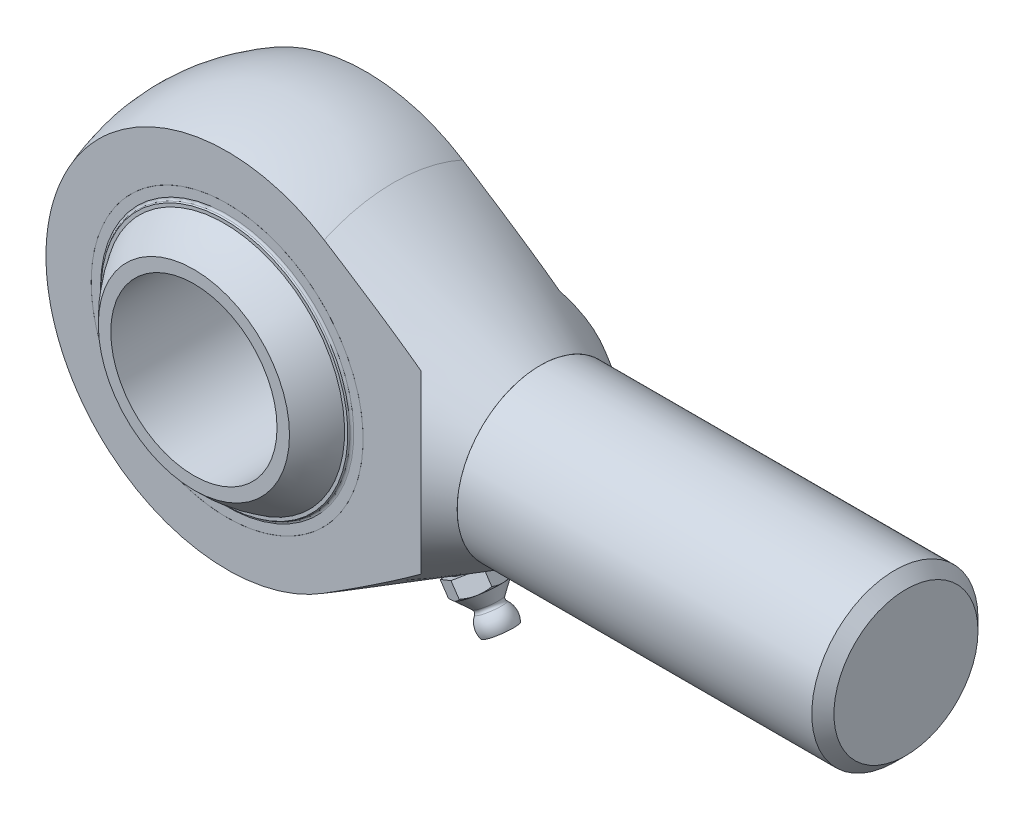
ISO-10303-21;
HEADER;
FILE_DESCRIPTION(('STEP AP214'),'2;1');
FILE_NAME('part.step','',(''),(''),'','','');
FILE_SCHEMA(('AUTOMOTIVE_DESIGN { 1 0 10303 214 1 1 1 1 }'));
ENDSEC;
DATA;
#1=APPLICATION_CONTEXT('core data for automotive mechanical design processes');
#2=APPLICATION_PROTOCOL_DEFINITION('international standard','automotive_design',2000,#1);
#3=PRODUCT_CONTEXT('',#1,'mechanical');
#4=PRODUCT('Part','Part','',(#3));
#5=PRODUCT_RELATED_PRODUCT_CATEGORY('part','',(#4));
#6=PRODUCT_DEFINITION_FORMATION('','',#4);
#7=PRODUCT_DEFINITION_CONTEXT('part definition',#1,'design');
#8=PRODUCT_DEFINITION('design','',#6,#7);
#9=PRODUCT_DEFINITION_SHAPE('','',#8);
#10=(LENGTH_UNIT() NAMED_UNIT(*) SI_UNIT(.MILLI.,.METRE.));
#11=(NAMED_UNIT(*) PLANE_ANGLE_UNIT() SI_UNIT($,.RADIAN.));
#12=(NAMED_UNIT(*) SI_UNIT($,.STERADIAN.) SOLID_ANGLE_UNIT());
#13=UNCERTAINTY_MEASURE_WITH_UNIT(LENGTH_MEASURE(1.E-05),#10,'distance_accuracy_value','');
#14=(GEOMETRIC_REPRESENTATION_CONTEXT(3) GLOBAL_UNCERTAINTY_ASSIGNED_CONTEXT((#13)) GLOBAL_UNIT_ASSIGNED_CONTEXT((#10,
#11,#12)) REPRESENTATION_CONTEXT('',''));
#15=CARTESIAN_POINT('',(0.,0.,0.));
#16=DIRECTION('',(0.,0.,1.));
#17=DIRECTION('',(1.,0.,0.));
#18=AXIS2_PLACEMENT_3D('',#15,#16,#17);
#19=CARTESIAN_POINT('',(-8.20912434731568,-25.2650868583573,3.49738604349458));
#20=DIRECTION('',(0.306373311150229,0.942920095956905,-0.130526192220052));
#21=DIRECTION('',(-0.0403348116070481,-0.124137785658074,-0.99144486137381));
#22=AXIS2_PLACEMENT_3D('',#19,#20,#21);
#23=SPHERICAL_SURFACE('',#22,3.);
#24=CARTESIAN_POINT('',(-7.29000441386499,-22.4363265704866,3.10580746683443));
#25=VERTEX_POINT('',#24);
#26=VERTEX_LOOP('',#25);
#27=FACE_BOUND('',#26,.T.);
#28=ADVANCED_FACE('P0_F12',(#27),#23,.T.);
#29=CLOSED_SHELL('',(#28));
#30=MANIFOLD_SOLID_BREP('P0_B1',#29);
#31=CARTESIAN_POINT('',(0.,26.5652844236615,3.49738604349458));
#32=DIRECTION('',(0.,-0.99144486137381,-0.130526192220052));
#33=DIRECTION('',(0.,0.130526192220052,-0.99144486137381));
#34=AXIS2_PLACEMENT_3D('',#31,#32,#33);
#35=SPHERICAL_SURFACE('',#34,3.);
#36=CARTESIAN_POINT('',(0.,23.59094983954,3.10580746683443));
#37=VERTEX_POINT('',#36);
#38=VERTEX_LOOP('',#37);
#39=FACE_BOUND('',#38,.T.);
#40=ADVANCED_FACE('P1_F12',(#39),#35,.T.);
#41=CLOSED_SHELL('',(#40));
#42=MANIFOLD_SOLID_BREP('P1_B1',#41);
#43=CARTESIAN_POINT('',(8.20912434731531,-25.2650868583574,-3.49738604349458));
#44=DIRECTION('',(-0.306373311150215,0.94292009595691,0.130526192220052));
#45=DIRECTION('',(0.0403348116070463,-0.124137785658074,0.99144486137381));
#46=AXIS2_PLACEMENT_3D('',#43,#44,#45);
#47=SPHERICAL_SURFACE('',#46,3.);
#48=CARTESIAN_POINT('',(7.29000441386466,-22.4363265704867,-3.10580746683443));
#49=VERTEX_POINT('',#48);
#50=VERTEX_LOOP('',#49);
#51=FACE_BOUND('',#50,.T.);
#52=ADVANCED_FACE('P2_F12',(#51),#47,.T.);
#53=CLOSED_SHELL('',(#52));
#54=MANIFOLD_SOLID_BREP('P2_B1',#53);
#55=CARTESIAN_POINT('',(0.,0.,0.));
#56=DIRECTION('',(0.,0.,1.));
#57=DIRECTION('',(0.999027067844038,0.044101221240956,0.));
#58=AXIS2_PLACEMENT_3D('',#55,#56,#57);
#59=CYLINDRICAL_SURFACE('',#58,24.55);
#60=CARTESIAN_POINT('',(0.,0.,-12.5));
#61=DIRECTION('',(0.,0.,1.));
#62=DIRECTION('',(0.999027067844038,0.044101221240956,0.));
#63=AXIS2_PLACEMENT_3D('',#60,#61,#62);
#64=CIRCLE('',#63,24.55);
#65=CARTESIAN_POINT('',(24.5261145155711,1.08268498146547,-12.5));
#66=VERTEX_POINT('',#65);
#67=EDGE_CURVE('P3_E34',#66,#66,#64,.T.);
#68=ORIENTED_EDGE('',*,*,#67,.T.);
#69=EDGE_LOOP('',(#68));
#70=FACE_BOUND('',#69,.T.);
#71=CARTESIAN_POINT('',(0.,0.,-12.));
#72=DIRECTION('',(0.,0.,1.));
#73=DIRECTION('',(0.999027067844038,0.044101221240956,0.));
#74=AXIS2_PLACEMENT_3D('',#71,#72,#73);
#75=CIRCLE('',#74,24.55);
#76=CARTESIAN_POINT('',(24.5261145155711,1.08268498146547,-12.));
#77=VERTEX_POINT('',#76);
#78=EDGE_CURVE('P3_E43',#77,#77,#75,.T.);
#79=ORIENTED_EDGE('',*,*,#78,.F.);
#80=EDGE_LOOP('',(#79));
#81=FACE_BOUND('',#80,.T.);
#82=ADVANCED_FACE('P3_F14',(#70,#81),#59,.T.);
#83=CARTESIAN_POINT('',(-1.08268498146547,24.5261145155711,-12.5));
#84=DIRECTION('',(0.,0.,-1.));
#85=DIRECTION('',(-0.999027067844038,-0.044101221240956,0.));
#86=AXIS2_PLACEMENT_3D('',#83,#84,#85);
#87=PLANE('',#86);
#88=CARTESIAN_POINT('',(0.,0.,-12.5));
#89=DIRECTION('',(0.,0.,-1.));
#90=DIRECTION('',(-0.999027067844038,-0.044101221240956,0.));
#91=AXIS2_PLACEMENT_3D('',#88,#89,#90);
#92=CIRCLE('',#91,22.8561048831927);
#93=CARTESIAN_POINT('',(-22.8338674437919,-1.00798213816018,-12.5));
#94=VERTEX_POINT('',#93);
#95=EDGE_CURVE('P3_E21',#94,#94,#92,.F.);
#96=ORIENTED_EDGE('',*,*,#95,.T.);
#97=EDGE_LOOP('',(#96));
#98=FACE_BOUND('',#97,.T.);
#99=ORIENTED_EDGE('',*,*,#67,.F.);
#100=EDGE_LOOP('',(#99));
#101=FACE_BOUND('',#100,.T.);
#102=ADVANCED_FACE('P3_F50',(#98,#101),#87,.T.);
#103=CARTESIAN_POINT('',(0.,0.,0.));
#104=DIRECTION('',(0.,0.,1.));
#105=DIRECTION('',(-0.044101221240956,0.999027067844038,0.));
#106=AXIS2_PLACEMENT_3D('',#103,#104,#105);
#107=SPHERICAL_SURFACE('',#106,25.7945152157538);
#108=CARTESIAN_POINT('',(0.,0.,-12.7528001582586));
#109=DIRECTION('',(0.,0.,1.));
#110=DIRECTION('',(0.999027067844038,0.044101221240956,0.));
#111=AXIS2_PLACEMENT_3D('',#108,#109,#110);
#112=CIRCLE('',#111,22.4214875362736);
#113=CARTESIAN_POINT('',(-0.988814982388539,22.399672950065,-12.7528001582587));
#114=VERTEX_POINT('',#113);
#115=EDGE_CURVE('P3_E10',#114,#114,#112,.F.);
#116=CARTESIAN_POINT('',(0.,0.,-13.));
#117=DIRECTION('',(0.,0.,1.));
#118=DIRECTION('',(0.999027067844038,0.044101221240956,0.));
#119=AXIS2_PLACEMENT_3D('',#116,#117,#118);
#120=CIRCLE('',#119,22.2790712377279);
#121=CARTESIAN_POINT('',(-0.982534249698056,22.2573952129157,-13.));
#122=VERTEX_POINT('',#121);
#123=EDGE_CURVE('P3_E37',#122,#122,#120,.T.);
#124=CARTESIAN_POINT('',(-0.988814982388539,22.399672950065,-12.7528001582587));
#125=CARTESIAN_POINT('',(-0.988750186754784,22.3982051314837,-12.7553833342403));
#126=CARTESIAN_POINT('',(-0.98868537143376,22.3967368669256,-12.7579662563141));
#127=CARTESIAN_POINT('',(-0.988555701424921,22.3937994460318,-12.7631315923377));
#128=CARTESIAN_POINT('',(-0.988490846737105,22.3923302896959,-12.7657140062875));
#129=CARTESIAN_POINT('',(-0.988361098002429,22.3893910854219,-12.7708783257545));
#130=CARTESIAN_POINT('',(-0.988296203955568,22.3879210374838,-12.7734602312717));
#131=CARTESIAN_POINT('',(-0.988166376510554,22.3849800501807,-12.7786235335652));
#132=CARTESIAN_POINT('',(-0.988101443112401,22.3835091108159,-12.7812049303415));
#133=CARTESIAN_POINT('',(-0.987971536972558,22.3805663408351,-12.7863672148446));
#134=CARTESIAN_POINT('',(-0.987906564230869,22.3790945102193,-12.7889481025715));
#135=CARTESIAN_POINT('',(-0.987776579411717,22.3761499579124,-12.7941093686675));
#136=CARTESIAN_POINT('',(-0.987711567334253,22.3746772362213,-12.7966897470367));
#137=CARTESIAN_POINT('',(-0.987581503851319,22.37173090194,-12.8018499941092));
#138=CARTESIAN_POINT('',(-0.987516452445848,22.3702572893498,-12.8044298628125));
#139=CARTESIAN_POINT('',(-0.987386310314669,22.367309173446,-12.8095890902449));
#140=CARTESIAN_POINT('',(-0.987321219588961,22.3658346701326,-12.8121684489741));
#141=CARTESIAN_POINT('',(-0.987190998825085,22.3628847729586,-12.8173266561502));
#142=CARTESIAN_POINT('',(-0.987125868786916,22.361409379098,-12.8199055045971));
#143=CARTESIAN_POINT('',(-0.986995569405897,22.3584577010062,-12.8250626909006));
#144=CARTESIAN_POINT('',(-0.986930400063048,22.3569814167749,-12.8276410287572));
#145=CARTESIAN_POINT('',(-0.986800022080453,22.3540279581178,-12.8327971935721));
#146=CARTESIAN_POINT('',(-0.986734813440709,22.352550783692,-12.8353750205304));
#147=CARTESIAN_POINT('',(-0.986604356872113,22.3495955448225,-12.8405301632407));
#148=CARTESIAN_POINT('',(-0.986539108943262,22.3481174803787,-12.8431074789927));
#149=CARTESIAN_POINT('',(-0.986408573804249,22.3451604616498,-12.8482615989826));
#150=CARTESIAN_POINT('',(-0.986343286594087,22.3436815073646,-12.8508384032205));
#151=CARTESIAN_POINT('',(-0.986212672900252,22.3407227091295,-12.8559914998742));
#152=CARTESIAN_POINT('',(-0.986147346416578,22.3392428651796,-12.8585677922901));
#153=CARTESIAN_POINT('',(-0.986016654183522,22.3362822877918,-12.8637198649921));
#154=CARTESIAN_POINT('',(-0.98595128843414,22.3348015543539,-12.8662956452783));
#155=CARTESIAN_POINT('',(-0.985820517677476,22.3318391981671,-12.8714466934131));
#156=CARTESIAN_POINT('',(-0.985755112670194,22.3303575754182,-12.8740219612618));
#157=CARTESIAN_POINT('',(-0.985624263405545,22.3273934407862,-12.8791719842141));
#158=CARTESIAN_POINT('',(-0.985558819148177,22.3259109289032,-12.8817467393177));
#159=CARTESIAN_POINT('',(-0.985427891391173,22.3229450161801,-12.8868957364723));
#160=CARTESIAN_POINT('',(-0.985362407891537,22.3214616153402,-12.8894699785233));
#161=CARTESIAN_POINT('',(-0.985231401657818,22.3184939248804,-12.894617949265));
#162=CARTESIAN_POINT('',(-0.985165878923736,22.3170096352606,-12.8971916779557));
#163=CARTESIAN_POINT('',(-0.985034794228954,22.3140401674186,-12.9023386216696));
#164=CARTESIAN_POINT('',(-0.984969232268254,22.3125549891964,-12.9049118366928));
#165=CARTESIAN_POINT('',(-0.984838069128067,22.3095837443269,-12.910057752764));
#166=CARTESIAN_POINT('',(-0.984772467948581,22.3080976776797,-12.9126304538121));
#167=CARTESIAN_POINT('',(-0.984641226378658,22.3051246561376,-12.9177753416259));
#168=CARTESIAN_POINT('',(-0.984575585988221,22.3036377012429,-12.9203475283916));
#169=CARTESIAN_POINT('',(-0.984444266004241,22.3006629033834,-12.9254913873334));
#170=CARTESIAN_POINT('',(-0.984378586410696,22.2991750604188,-12.9280630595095));
#171=CARTESIAN_POINT('',(-0.984247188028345,22.2961984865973,-12.9332058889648));
#172=CARTESIAN_POINT('',(-0.984181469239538,22.2947097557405,-12.9357770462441));
#173=CARTESIAN_POINT('',(-0.984049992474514,22.2917314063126,-12.9409188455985));
#174=CARTESIAN_POINT('',(-0.983984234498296,22.2902417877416,-12.9434894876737));
#175=CARTESIAN_POINT('',(-0.983852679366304,22.287261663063,-12.9486302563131));
#176=CARTESIAN_POINT('',(-0.983786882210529,22.2857711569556,-12.9512003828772));
#177=CARTESIAN_POINT('',(-0.983655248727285,22.2827892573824,-12.9563401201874));
#178=CARTESIAN_POINT('',(-0.983589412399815,22.2812978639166,-12.9589097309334));
#179=CARTESIAN_POINT('',(-0.983457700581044,22.278314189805,-12.9640484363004));
#180=CARTESIAN_POINT('',(-0.983391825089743,22.2768219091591,-12.9666175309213));
#181=CARTESIAN_POINT('',(-0.983260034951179,22.2738364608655,-12.9717552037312));
#182=CARTESIAN_POINT('',(-0.983194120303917,22.2723432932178,-12.9743237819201));
#183=CARTESIAN_POINT('',(-0.983062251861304,22.2693560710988,-12.9794604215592));
#184=CARTESIAN_POINT('',(-0.982996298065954,22.2678620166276,-12.9820284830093));
#185=CARTESIAN_POINT('',(-0.982864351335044,22.2648730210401,-12.9871640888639));
#186=CARTESIAN_POINT('',(-0.982798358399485,22.2633780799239,-12.9897316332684));
#187=CARTESIAN_POINT('',(-0.982666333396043,22.2603873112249,-12.9948662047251));
#188=CARTESIAN_POINT('',(-0.98260030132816,22.2588914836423,-12.9974332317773));
#189=CARTESIAN_POINT('',(-0.982534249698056,22.2573952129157,-13.));
#190=B_SPLINE_CURVE_WITH_KNOTS('',3,(#124,#125,#126,#127,#128,#129,#130,#131,#132,#133,#134,
#135,#136,#137,#138,#139,#140,#141,#142,#143,#144,#145,#146,#147,#148,#149,#150,#151,#152,#153,
#154,#155,#156,#157,#158,#159,#160,#161,#162,#163,#164,#165,#166,#167,#168,#169,#170,#171,#172,
#173,#174,#175,#176,#177,#178,#179,#180,#181,#182,#183,#184,#185,#186,#187,#188,#189),
.UNSPECIFIED.,.F.,.F.,(4,2,2,2,2,2,2,2,2,2,2,2,2,2,2,2,2,2,2,2,2,2,2,2,2,2,2,2,2,2,2,2,4),(0.,
0.00891534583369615,0.0178306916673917,0.0267460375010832,0.0356613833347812,0.0445767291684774,
0.0534920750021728,0.0624074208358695,0.0713227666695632,0.0802381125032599,0.0891534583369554,
0.0980688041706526,0.106984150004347,0.115899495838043,0.124814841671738,0.133730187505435,
0.142645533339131,0.151560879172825,0.160476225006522,0.169391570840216,0.178306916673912,
0.187222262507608,0.196137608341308,0.205052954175,0.213968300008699,0.222883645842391,
0.231798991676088,0.240714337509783,0.249629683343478,0.258545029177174,0.26746037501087,
0.276375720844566,0.285291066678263),.UNSPECIFIED.);
#191=EDGE_CURVE('P3_BSEAM57',#114,#122,#190,.T.);
#192=ORIENTED_EDGE('',*,*,#115,.T.);
#193=ORIENTED_EDGE('',*,*,#123,.T.);
#194=ORIENTED_EDGE('',*,*,#191,.T.);
#195=ORIENTED_EDGE('',*,*,#191,.F.);
#196=EDGE_LOOP('',(#192,#194,#193,#195));
#197=FACE_BOUND('',#196,.T.);
#198=ADVANCED_FACE('P3_F57',(#197),#107,.T.);
#199=CARTESIAN_POINT('',(-0.956917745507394,21.6771033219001,-13.));
#200=DIRECTION('',(0.,0.,-1.));
#201=DIRECTION('',(-0.999027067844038,-0.044101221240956,0.));
#202=AXIS2_PLACEMENT_3D('',#199,#200,#201);
#203=PLANE('',#202);
#204=CARTESIAN_POINT('',(0.,0.,-13.));
#205=DIRECTION('',(0.,0.,1.));
#206=DIRECTION('',(0.999027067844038,0.044101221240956,0.));
#207=AXIS2_PLACEMENT_3D('',#204,#205,#206);
#208=CIRCLE('',#207,21.6982142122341);
#209=CARTESIAN_POINT('',(-0.956917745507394,21.6771033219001,-13.));
#210=VERTEX_POINT('',#209);
#211=EDGE_CURVE('P3_E40',#210,#210,#208,.T.);
#212=ORIENTED_EDGE('',*,*,#211,.T.);
#213=EDGE_LOOP('',(#212));
#214=FACE_BOUND('',#213,.T.);
#215=ORIENTED_EDGE('',*,*,#123,.F.);
#216=EDGE_LOOP('',(#215));
#217=FACE_BOUND('',#216,.T.);
#218=ADVANCED_FACE('P3_F77',(#214,#217),#203,.T.);
#219=CARTESIAN_POINT('',(0.,0.,0.));
#220=DIRECTION('',(0.,0.,1.));
#221=DIRECTION('',(-0.044101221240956,0.999027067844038,0.));
#222=AXIS2_PLACEMENT_3D('',#219,#220,#221);
#223=SPHERICAL_SURFACE('',#222,25.2945152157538);
#224=CARTESIAN_POINT('',(0.,0.,-12.257700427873));
#225=DIRECTION('',(0.,0.,1.));
#226=DIRECTION('',(0.999027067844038,0.044101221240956,0.));
#227=AXIS2_PLACEMENT_3D('',#224,#225,#226);
#228=CIRCLE('',#227,22.1260317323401);
#229=CARTESIAN_POINT('',(-0.975785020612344,22.1045046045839,-12.257700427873));
#230=VERTEX_POINT('',#229);
#231=EDGE_CURVE('P3_E29',#230,#230,#228,.T.);
#232=CARTESIAN_POINT('',(-0.975785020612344,22.1045046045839,-12.257700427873));
#233=CARTESIAN_POINT('',(-0.975594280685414,22.1001837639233,-12.2655074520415));
#234=CARTESIAN_POINT('',(-0.97540335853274,22.0958587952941,-12.2733121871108));
#235=CARTESIAN_POINT('',(-0.975021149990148,22.0872006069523,-12.2889170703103));
#236=CARTESIAN_POINT('',(-0.974829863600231,22.0828673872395,-12.2967172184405));
#237=CARTESIAN_POINT('',(-0.974446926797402,22.0741927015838,-12.3123129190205));
#238=CARTESIAN_POINT('',(-0.974255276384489,22.0698512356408,-12.3201084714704));
#239=CARTESIAN_POINT('',(-0.973871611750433,22.0611600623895,-12.3356949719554));
#240=CARTESIAN_POINT('',(-0.97367959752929,22.0568103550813,-12.3434859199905));
#241=CARTESIAN_POINT('',(-0.973295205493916,22.0481027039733,-12.3590632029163));
#242=CARTESIAN_POINT('',(-0.973102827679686,22.0437447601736,-12.3668495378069));
#243=CARTESIAN_POINT('',(-0.972717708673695,22.0350206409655,-12.3824175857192));
#244=CARTESIAN_POINT('',(-0.972524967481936,22.0306544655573,-12.3901992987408));
#245=CARTESIAN_POINT('',(-0.97213912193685,22.0219138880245,-12.4057580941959));
#246=CARTESIAN_POINT('',(-0.971946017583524,22.0175394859,-12.4135351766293));
#247=CARTESIAN_POINT('',(-0.971559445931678,22.0087824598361,-12.4290847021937));
#248=CARTESIAN_POINT('',(-0.971365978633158,22.0043998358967,-12.4368571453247));
#249=CARTESIAN_POINT('',(-0.970978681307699,21.9956263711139,-12.4523973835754));
#250=CARTESIAN_POINT('',(-0.970784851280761,21.9912355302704,-12.4601651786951));
#251=CARTESIAN_POINT('',(-0.97039682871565,21.9824456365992,-12.4756961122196));
#252=CARTESIAN_POINT('',(-0.970202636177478,21.9780465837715,-12.4834592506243));
#253=CARTESIAN_POINT('',(-0.969813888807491,21.9692402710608,-12.4989808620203));
#254=CARTESIAN_POINT('',(-0.969619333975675,21.9648330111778,-12.5067393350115));
#255=CARTESIAN_POINT('',(-0.969229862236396,21.9560102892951,-12.5222516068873));
#256=CARTESIAN_POINT('',(-0.969034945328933,21.9515948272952,-12.5300054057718));
#257=CARTESIAN_POINT('',(-0.96864474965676,21.9427557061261,-12.545508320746));
#258=CARTESIAN_POINT('',(-0.96844947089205,21.9383320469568,-12.5532574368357));
#259=CARTESIAN_POINT('',(-0.968058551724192,21.9294765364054,-12.5687509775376));
#260=CARTESIAN_POINT('',(-0.967862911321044,21.9250446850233,-12.5764954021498));
#261=CARTESIAN_POINT('',(-0.967471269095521,21.9161727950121,-12.5919795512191));
#262=CARTESIAN_POINT('',(-0.967275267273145,21.911732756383,-12.5997192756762));
#263=CARTESIAN_POINT('',(-0.966882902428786,21.9028444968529,-12.6151940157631));
#264=CARTESIAN_POINT('',(-0.966686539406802,21.8983962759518,-12.6229290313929));
#265=CARTESIAN_POINT('',(-0.966293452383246,21.8894916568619,-12.6383943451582));
#266=CARTESIAN_POINT('',(-0.966096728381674,21.885035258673,-12.6461246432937));
#267=CARTESIAN_POINT('',(-0.965702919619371,21.8761142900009,-12.6615805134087));
#268=CARTESIAN_POINT('',(-0.965505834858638,21.8716497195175,-12.6693060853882));
#269=CARTESIAN_POINT('',(-0.965111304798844,21.8627124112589,-12.6847524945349));
#270=CARTESIAN_POINT('',(-0.964913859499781,21.8582396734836,-12.692473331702));
#271=CARTESIAN_POINT('',(-0.964518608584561,21.8492860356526,-12.7079102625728));
#272=CARTESIAN_POINT('',(-0.964320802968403,21.8448051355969,-12.7156263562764));
#273=CARTESIAN_POINT('',(-0.963924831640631,21.8358351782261,-12.7310537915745));
#274=CARTESIAN_POINT('',(-0.963726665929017,21.8313461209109,-12.7387651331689));
#275=CARTESIAN_POINT('',(-0.963329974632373,21.8223598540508,-12.754183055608));
#276=CARTESIAN_POINT('',(-0.963131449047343,21.817862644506,-12.7618896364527));
#277=CARTESIAN_POINT('',(-0.962734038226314,21.8088600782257,-12.7772980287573));
#278=CARTESIAN_POINT('',(-0.962535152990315,21.8043547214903,-12.7849998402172));
#279=CARTESIAN_POINT('',(-0.962137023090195,21.7953358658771,-12.8003986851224));
#280=CARTESIAN_POINT('',(-0.961937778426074,21.7908223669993,-12.8080957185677));
#281=CARTESIAN_POINT('',(-0.961538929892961,21.7817872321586,-12.8234849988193));
#282=CARTESIAN_POINT('',(-0.961339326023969,21.7772655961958,-12.8311772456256));
#283=CARTESIAN_POINT('',(-0.960939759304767,21.7682141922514,-12.8465569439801));
#284=CARTESIAN_POINT('',(-0.960739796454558,21.7636844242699,-12.8542443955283));
#285=CARTESIAN_POINT('',(-0.960339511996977,21.7546167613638,-12.8696144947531));
#286=CARTESIAN_POINT('',(-0.960139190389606,21.7500788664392,-12.8772971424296));
#287=CARTESIAN_POINT('',(-0.959738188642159,21.7409949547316,-12.8926576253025));
#288=CARTESIAN_POINT('',(-0.959537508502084,21.7364489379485,-12.9003354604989));
#289=CARTESIAN_POINT('',(-0.959135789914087,21.7273487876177,-12.9156863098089));
#290=CARTESIAN_POINT('',(-0.958934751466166,21.7227946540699,-12.9233593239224));
#291=CARTESIAN_POINT('',(-0.958532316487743,21.7136782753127,-12.9387005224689));
#292=CARTESIAN_POINT('',(-0.958330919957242,21.7091160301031,-12.946368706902));
#293=CARTESIAN_POINT('',(-0.957927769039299,21.6999834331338,-12.9617002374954));
#294=CARTESIAN_POINT('',(-0.957726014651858,21.6954130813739,-12.9693635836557));
#295=CARTESIAN_POINT('',(-0.957322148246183,21.6862642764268,-12.984685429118));
#296=CARTESIAN_POINT('',(-0.95712003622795,21.6816858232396,-12.9923439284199));
#297=CARTESIAN_POINT('',(-0.956917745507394,21.6771033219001,-13.));
#298=B_SPLINE_CURVE_WITH_KNOTS('',3,(#232,#233,#234,#235,#236,#237,#238,#239,#240,#241,#242,
#243,#244,#245,#246,#247,#248,#249,#250,#251,#252,#253,#254,#255,#256,#257,#258,#259,#260,#261,
#262,#263,#264,#265,#266,#267,#268,#269,#270,#271,#272,#273,#274,#275,#276,#277,#278,#279,#280,
#281,#282,#283,#284,#285,#286,#287,#288,#289,#290,#291,#292,#293,#294,#295,#296,#297),
.UNSPECIFIED.,.F.,.F.,(4,2,2,2,2,2,2,2,2,2,2,2,2,2,2,2,2,2,2,2,2,2,2,2,2,2,2,2,2,2,2,2,4),(0.,
0.0267750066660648,0.0535500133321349,0.0803250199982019,0.10710002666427,0.133875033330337,
0.160650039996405,0.187425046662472,0.214200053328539,0.240975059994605,0.267750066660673,
0.294525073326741,0.321300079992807,0.348075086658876,0.374850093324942,0.401625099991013,
0.428400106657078,0.455175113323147,0.481950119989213,0.508725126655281,0.53550013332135,
0.562275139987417,0.589050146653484,0.615825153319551,0.642600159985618,0.669375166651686,
0.696150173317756,0.72292517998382,0.749700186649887,0.776475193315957,0.803250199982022,
0.830025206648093,0.856800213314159),.UNSPECIFIED.);
#299=EDGE_CURVE('P3_BSEAM68',#230,#210,#298,.T.);
#300=ORIENTED_EDGE('',*,*,#231,.T.);
#301=ORIENTED_EDGE('',*,*,#211,.F.);
#302=ORIENTED_EDGE('',*,*,#299,.T.);
#303=ORIENTED_EDGE('',*,*,#299,.F.);
#304=EDGE_LOOP('',(#300,#302,#301,#303));
#305=FACE_BOUND('',#304,.T.);
#306=ADVANCED_FACE('P3_F68',(#305),#223,.F.);
#307=CARTESIAN_POINT('',(-1.08268498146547,24.5261145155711,-12.));
#308=DIRECTION('',(0.,0.,1.));
#309=DIRECTION('',(0.999027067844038,0.044101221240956,0.));
#310=AXIS2_PLACEMENT_3D('',#307,#308,#309);
#311=PLANE('',#310);
#312=CARTESIAN_POINT('',(0.,0.,-12.));
#313=DIRECTION('',(0.,0.,1.));
#314=DIRECTION('',(0.999027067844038,0.044101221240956,0.));
#315=AXIS2_PLACEMENT_3D('',#312,#313,#314);
#316=CIRCLE('',#315,22.5633999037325);
#317=CARTESIAN_POINT('',(22.5414472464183,0.99507349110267,-12.));
#318=VERTEX_POINT('',#317);
#319=EDGE_CURVE('P3_E25',#318,#318,#316,.F.);
#320=ORIENTED_EDGE('',*,*,#319,.T.);
#321=EDGE_LOOP('',(#320));
#322=FACE_BOUND('',#321,.T.);
#323=ORIENTED_EDGE('',*,*,#78,.T.);
#324=EDGE_LOOP('',(#323));
#325=FACE_BOUND('',#324,.T.);
#326=ADVANCED_FACE('P3_F47',(#322,#325),#311,.T.);
#327=CARTESIAN_POINT('',(0.,0.,-12.5));
#328=DIRECTION('',(0.,0.,1.));
#329=DIRECTION('',(0.999027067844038,0.044101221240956,0.));
#330=AXIS2_PLACEMENT_3D('',#327,#328,#329);
#331=TOROIDAL_SURFACE('',#330,22.5633999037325,0.5);
#332=ORIENTED_EDGE('',*,*,#319,.F.);
#333=EDGE_LOOP('',(#332));
#334=FACE_BOUND('',#333,.T.);
#335=ORIENTED_EDGE('',*,*,#231,.F.);
#336=EDGE_LOOP('',(#335));
#337=FACE_BOUND('',#336,.T.);
#338=ADVANCED_FACE('P3_F60',(#334,#337),#331,.T.);
#339=CARTESIAN_POINT('',(0.,0.,-13.));
#340=DIRECTION('',(0.,0.,-1.));
#341=DIRECTION('',(-0.999027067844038,-0.044101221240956,0.));
#342=AXIS2_PLACEMENT_3D('',#339,#340,#341);
#343=TOROIDAL_SURFACE('',#342,22.8561048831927,0.5);
#344=ORIENTED_EDGE('',*,*,#115,.F.);
#345=EDGE_LOOP('',(#344));
#346=FACE_BOUND('',#345,.T.);
#347=ORIENTED_EDGE('',*,*,#95,.F.);
#348=EDGE_LOOP('',(#347));
#349=FACE_BOUND('',#348,.T.);
#350=ADVANCED_FACE('P3_F16',(#346,#349),#343,.F.);
#351=CLOSED_SHELL('',(#82,#102,#198,#218,#306,#326,#338,#350));
#352=MANIFOLD_SOLID_BREP('P3_B1',#351);
#353=CARTESIAN_POINT('',(-15.6146824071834,-21.4917665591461,3.49738604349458));
#354=DIRECTION('',(0.582756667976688,0.802095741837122,-0.130526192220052));
#355=DIRECTION('',(-0.07672137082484,-0.105597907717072,-0.99144486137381));
#356=AXIS2_PLACEMENT_3D('',#353,#354,#355);
#357=SPHERICAL_SURFACE('',#356,3.);
#358=CARTESIAN_POINT('',(-13.8664124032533,-19.0854793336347,3.10580746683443));
#359=VERTEX_POINT('',#358);
#360=VERTEX_LOOP('',#359);
#361=FACE_BOUND('',#360,.T.);
#362=ADVANCED_FACE('P4_F12',(#361),#357,.T.);
#363=CLOSED_SHELL('',(#362));
#364=MANIFOLD_SOLID_BREP('P4_B1',#363);
#365=CARTESIAN_POINT('',(8.2091243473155,25.2650868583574,3.49738604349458));
#366=DIRECTION('',(-0.306373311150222,-0.942920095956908,-0.130526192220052));
#367=DIRECTION('',(0.0403348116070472,0.124137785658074,-0.99144486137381));
#368=AXIS2_PLACEMENT_3D('',#365,#366,#367);
#369=SPHERICAL_SURFACE('',#368,3.);
#370=CARTESIAN_POINT('',(7.29000441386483,22.4363265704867,3.10580746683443));
#371=VERTEX_POINT('',#370);
#372=VERTEX_LOOP('',#371);
#373=FACE_BOUND('',#372,.T.);
#374=ADVANCED_FACE('P5_F12',(#373),#369,.T.);
#375=CLOSED_SHELL('',(#374));
#376=MANIFOLD_SOLID_BREP('P5_B1',#375);
#377=CARTESIAN_POINT('',(-1.85504497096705E-13,-26.5652844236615,-3.49738604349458));
#378=DIRECTION('',(0.,0.99144486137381,0.130526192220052));
#379=DIRECTION('',(0.,-0.130526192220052,0.99144486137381));
#380=AXIS2_PLACEMENT_3D('',#377,#378,#379);
#381=SPHERICAL_SURFACE('',#380,3.);
#382=CARTESIAN_POINT('',(-1.6473481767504E-13,-23.59094983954,-3.10580746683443));
#383=VERTEX_POINT('',#382);
#384=VERTEX_LOOP('',#383);
#385=FACE_BOUND('',#384,.T.);
#386=ADVANCED_FACE('P6_F12',(#385),#381,.T.);
#387=CLOSED_SHELL('',(#386));
#388=MANIFOLD_SOLID_BREP('P6_B1',#387);
#389=CARTESIAN_POINT('',(-21.4917665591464,-15.614682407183,3.49738604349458));
#390=DIRECTION('',(0.802095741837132,0.582756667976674,-0.130526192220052));
#391=DIRECTION('',(-0.105597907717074,-0.0767213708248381,-0.99144486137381));
#392=AXIS2_PLACEMENT_3D('',#389,#390,#391);
#393=SPHERICAL_SURFACE('',#392,3.);
#394=CARTESIAN_POINT('',(-19.085479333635,-13.8664124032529,3.10580746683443));
#395=VERTEX_POINT('',#394);
#396=VERTEX_LOOP('',#395);
#397=FACE_BOUND('',#396,.T.);
#398=ADVANCED_FACE('P7_F12',(#397),#393,.T.);
#399=CLOSED_SHELL('',(#398));
#400=MANIFOLD_SOLID_BREP('P7_B1',#399);
#401=CARTESIAN_POINT('',(15.6146824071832,21.4917665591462,3.49738604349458));
#402=DIRECTION('',(-0.582756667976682,-0.802095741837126,-0.130526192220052));
#403=DIRECTION('',(0.0767213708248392,0.105597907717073,-0.99144486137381));
#404=AXIS2_PLACEMENT_3D('',#401,#402,#403);
#405=SPHERICAL_SURFACE('',#404,3.);
#406=CARTESIAN_POINT('',(13.8664124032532,19.0854793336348,3.10580746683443));
#407=VERTEX_POINT('',#406);
#408=VERTEX_LOOP('',#407);
#409=FACE_BOUND('',#408,.T.);
#410=ADVANCED_FACE('P8_F12',(#409),#405,.T.);
#411=CLOSED_SHELL('',(#410));
#412=MANIFOLD_SOLID_BREP('P8_B1',#411);
#413=CARTESIAN_POINT('',(-8.20912434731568,-25.2650868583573,-3.49738604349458));
#414=DIRECTION('',(0.306373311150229,0.942920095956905,0.130526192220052));
#415=DIRECTION('',(-0.0403348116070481,-0.124137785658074,0.99144486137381));
#416=AXIS2_PLACEMENT_3D('',#413,#414,#415);
#417=SPHERICAL_SURFACE('',#416,3.);
#418=CARTESIAN_POINT('',(-7.29000441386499,-22.4363265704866,-3.10580746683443));
#419=VERTEX_POINT('',#418);
#420=VERTEX_LOOP('',#419);
#421=FACE_BOUND('',#420,.T.);
#422=ADVANCED_FACE('P9_F12',(#421),#417,.T.);
#423=CLOSED_SHELL('',(#422));
#424=MANIFOLD_SOLID_BREP('P9_B1',#423);
#425=CARTESIAN_POINT('',(0.,0.,0.));
#426=DIRECTION('',(0.,1.,0.));
#427=DIRECTION('',(1.,0.,0.));
#428=AXIS2_PLACEMENT_3D('',#425,#426,#427);
#429=SPHERICAL_SURFACE('',#428,25.2945152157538);
#430=CARTESIAN_POINT('',(0.,0.,0.));
#431=DIRECTION('',(0.,0.,1.));
#432=DIRECTION('',(1.,0.,0.));
#433=AXIS2_PLACEMENT_3D('',#430,#431,#432);
#434=SPHERICAL_SURFACE('',#433,25.2945152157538);
#435=CARTESIAN_POINT('',(0.,0.,5.78474911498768));
#436=DIRECTION('',(0.,0.,1.));
#437=DIRECTION('',(1.,0.,0.));
#438=AXIS2_PLACEMENT_3D('',#435,#436,#437);
#439=CIRCLE('',#438,24.6241584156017);
#440=CARTESIAN_POINT('',(24.6241584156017,0.,5.78474911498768));
#441=VERTEX_POINT('',#440);
#442=EDGE_CURVE('P10_E18',#441,#441,#439,.F.);
#443=ORIENTED_EDGE('',*,*,#442,.F.);
#444=EDGE_LOOP('',(#443));
#445=FACE_BOUND('',#444,.T.);
#446=CARTESIAN_POINT('',(0.,0.,18.5));
#447=DIRECTION('',(0.,0.,-1.));
#448=DIRECTION('',(-1.,0.,0.));
#449=AXIS2_PLACEMENT_3D('',#446,#447,#448);
#450=CIRCLE('',#449,17.25);
#451=CARTESIAN_POINT('',(-17.25,0.,18.5));
#452=VERTEX_POINT('',#451);
#453=EDGE_CURVE('P10_E27',#452,#452,#450,.F.);
#454=ORIENTED_EDGE('',*,*,#453,.F.);
#455=EDGE_LOOP('',(#454));
#456=FACE_BOUND('',#455,.T.);
#457=ADVANCED_FACE('P10_F14',(#445,#456),#434,.T.);
#458=CARTESIAN_POINT('',(0.,0.,0.));
#459=DIRECTION('',(0.,0.,-1.));
#460=DIRECTION('',(-1.,0.,0.));
#461=AXIS2_PLACEMENT_3D('',#458,#459,#460);
#462=SPHERICAL_SURFACE('',#461,25.2945152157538);
#463=CARTESIAN_POINT('',(0.,0.,-5.78474911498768));
#464=DIRECTION('',(0.,0.,-1.));
#465=DIRECTION('',(-1.,0.,0.));
#466=AXIS2_PLACEMENT_3D('',#463,#464,#465);
#467=CIRCLE('',#466,24.6241584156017);
#468=CARTESIAN_POINT('',(-24.6241584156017,0.,-5.78474911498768));
#469=VERTEX_POINT('',#468);
#470=EDGE_CURVE('P10_E34',#469,#469,#467,.F.);
#471=ORIENTED_EDGE('',*,*,#470,.F.);
#472=EDGE_LOOP('',(#471));
#473=FACE_BOUND('',#472,.T.);
#474=CARTESIAN_POINT('',(0.,0.,-18.5));
#475=DIRECTION('',(0.,0.,1.));
#476=DIRECTION('',(1.,0.,0.));
#477=AXIS2_PLACEMENT_3D('',#474,#475,#476);
#478=CIRCLE('',#477,17.25);
#479=CARTESIAN_POINT('',(17.25,0.,-18.5));
#480=VERTEX_POINT('',#479);
#481=EDGE_CURVE('P10_E10',#480,#480,#478,.F.);
#482=ORIENTED_EDGE('',*,*,#481,.F.);
#483=EDGE_LOOP('',(#482));
#484=FACE_BOUND('',#483,.T.);
#485=ADVANCED_FACE('P10_F50',(#473,#484),#462,.T.);
#486=CARTESIAN_POINT('',(0.,0.,0.));
#487=DIRECTION('',(0.,0.,-1.));
#488=DIRECTION('',(-1.,0.,0.));
#489=AXIS2_PLACEMENT_3D('',#486,#487,#488);
#490=SPHERICAL_SURFACE('',#489,25.2945152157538);
#491=CARTESIAN_POINT('',(0.,0.,0.785562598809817));
#492=DIRECTION('',(0.,0.,-1.));
#493=DIRECTION('',(-1.,0.,0.));
#494=AXIS2_PLACEMENT_3D('',#491,#492,#493);
#495=CIRCLE('',#494,25.2823138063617);
#496=CARTESIAN_POINT('',(-25.2823138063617,0.,0.785562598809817));
#497=VERTEX_POINT('',#496);
#498=EDGE_CURVE('P10_E39',#497,#497,#495,.F.);
#499=ORIENTED_EDGE('',*,*,#498,.F.);
#500=EDGE_LOOP('',(#499));
#501=FACE_BOUND('',#500,.T.);
#502=CARTESIAN_POINT('',(0.,0.,-0.785562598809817));
#503=DIRECTION('',(0.,0.,1.));
#504=DIRECTION('',(1.,0.,0.));
#505=AXIS2_PLACEMENT_3D('',#502,#503,#504);
#506=CIRCLE('',#505,25.2823138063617);
#507=CARTESIAN_POINT('',(25.2823138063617,0.,-0.785562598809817));
#508=VERTEX_POINT('',#507);
#509=EDGE_CURVE('P10_E35',#508,#508,#506,.F.);
#510=ORIENTED_EDGE('',*,*,#509,.F.);
#511=EDGE_LOOP('',(#510));
#512=FACE_BOUND('',#511,.T.);
#513=ADVANCED_FACE('P10_F16',(#501,#512),#490,.T.);
#514=CARTESIAN_POINT('',(0.,0.,-25.2945152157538));
#515=DIRECTION('',(0.,0.,1.));
#516=DIRECTION('',(1.,0.,0.));
#517=AXIS2_PLACEMENT_3D('',#514,#515,#516);
#518=CYLINDRICAL_SURFACE('',#517,15.);
#519=CARTESIAN_POINT('',(0.,0.,18.5));
#520=DIRECTION('',(0.,0.,-1.));
#521=DIRECTION('',(-1.,0.,0.));
#522=AXIS2_PLACEMENT_3D('',#519,#520,#521);
#523=CIRCLE('',#522,15.);
#524=CARTESIAN_POINT('',(-15.,0.,18.5));
#525=VERTEX_POINT('',#524);
#526=EDGE_CURVE('P10_E31',#525,#525,#523,.F.);
#527=ORIENTED_EDGE('',*,*,#526,.T.);
#528=EDGE_LOOP('',(#527));
#529=FACE_BOUND('',#528,.T.);
#530=CARTESIAN_POINT('',(0.,0.,-18.5));
#531=DIRECTION('',(0.,0.,1.));
#532=DIRECTION('',(1.,0.,0.));
#533=AXIS2_PLACEMENT_3D('',#530,#531,#532);
#534=CIRCLE('',#533,15.);
#535=CARTESIAN_POINT('',(15.,0.,-18.5));
#536=VERTEX_POINT('',#535);
#537=EDGE_CURVE('P10_E22',#536,#536,#534,.F.);
#538=ORIENTED_EDGE('',*,*,#537,.T.);
#539=EDGE_LOOP('',(#538));
#540=FACE_BOUND('',#539,.T.);
#541=ADVANCED_FACE('P10_F62',(#529,#540),#518,.F.);
#542=CARTESIAN_POINT('',(-25.2945152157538,-25.2945152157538,-18.5));
#543=DIRECTION('',(0.,0.,1.));
#544=DIRECTION('',(1.,0.,0.));
#545=AXIS2_PLACEMENT_3D('',#542,#543,#544);
#546=PLANE('',#545);
#547=ORIENTED_EDGE('',*,*,#481,.T.);
#548=EDGE_LOOP('',(#547));
#549=FACE_BOUND('',#548,.T.);
#550=ORIENTED_EDGE('',*,*,#537,.F.);
#551=EDGE_LOOP('',(#550));
#552=FACE_BOUND('',#551,.T.);
#553=ADVANCED_FACE('P10_F58',(#549,#552),#546,.F.);
#554=CARTESIAN_POINT('',(-25.2945152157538,-25.2945152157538,18.5));
#555=DIRECTION('',(0.,0.,-1.));
#556=DIRECTION('',(-1.,0.,0.));
#557=AXIS2_PLACEMENT_3D('',#554,#555,#556);
#558=PLANE('',#557);
#559=ORIENTED_EDGE('',*,*,#453,.T.);
#560=EDGE_LOOP('',(#559));
#561=FACE_BOUND('',#560,.T.);
#562=ORIENTED_EDGE('',*,*,#526,.F.);
#563=EDGE_LOOP('',(#562));
#564=FACE_BOUND('',#563,.T.);
#565=ADVANCED_FACE('P10_F54',(#561,#564),#558,.F.);
#566=CARTESIAN_POINT('',(0.,0.,-3.49738604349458));
#567=DIRECTION('',(0.,0.,-1.));
#568=DIRECTION('',(-1.,0.,0.));
#569=AXIS2_PLACEMENT_3D('',#566,#567,#568);
#570=TOROIDAL_SURFACE('',#569,26.5652844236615,3.);
#571=ORIENTED_EDGE('',*,*,#470,.T.);
#572=EDGE_LOOP('',(#571));
#573=FACE_BOUND('',#572,.T.);
#574=ORIENTED_EDGE('',*,*,#509,.T.);
#575=EDGE_LOOP('',(#574));
#576=FACE_BOUND('',#575,.T.);
#577=ADVANCED_FACE('P10_F57',(#573,#576),#570,.F.);
#578=CARTESIAN_POINT('',(0.,0.,3.49738604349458));
#579=DIRECTION('',(0.,0.,-1.));
#580=DIRECTION('',(-1.,0.,0.));
#581=AXIS2_PLACEMENT_3D('',#578,#579,#580);
#582=TOROIDAL_SURFACE('',#581,26.5652844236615,3.);
#583=ORIENTED_EDGE('',*,*,#442,.T.);
#584=EDGE_LOOP('',(#583));
#585=FACE_BOUND('',#584,.T.);
#586=ORIENTED_EDGE('',*,*,#498,.T.);
#587=EDGE_LOOP('',(#586));
#588=FACE_BOUND('',#587,.T.);
#589=ADVANCED_FACE('P10_F46',(#585,#588),#582,.F.);
#590=CLOSED_SHELL('',(#457,#485,#513,#541,#553,#565,#577,#589));
#591=MANIFOLD_SOLID_BREP('P10_B1',#590);
#592=CARTESIAN_POINT('',(-25.2650868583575,-8.20912434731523,3.49738604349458));
#593=DIRECTION('',(0.942920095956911,0.306373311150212,-0.130526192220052));
#594=DIRECTION('',(-0.124137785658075,-0.0403348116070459,-0.99144486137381));
#595=AXIS2_PLACEMENT_3D('',#592,#593,#594);
#596=SPHERICAL_SURFACE('',#595,3.);
#597=CARTESIAN_POINT('',(-22.4363265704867,-7.2900044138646,3.10580746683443));
#598=VERTEX_POINT('',#597);
#599=VERTEX_LOOP('',#598);
#600=FACE_BOUND('',#599,.T.);
#601=ADVANCED_FACE('P11_F12',(#600),#596,.T.);
#602=CLOSED_SHELL('',(#601));
#603=MANIFOLD_SOLID_BREP('P11_B1',#602);
#604=CARTESIAN_POINT('',(21.4917665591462,15.6146824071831,3.49738604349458));
#605=DIRECTION('',(-0.802095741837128,-0.582756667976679,-0.130526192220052));
#606=DIRECTION('',(0.105597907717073,0.0767213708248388,-0.99144486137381));
#607=AXIS2_PLACEMENT_3D('',#604,#605,#606);
#608=SPHERICAL_SURFACE('',#607,3.);
#609=CARTESIAN_POINT('',(19.0854793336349,13.8664124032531,3.10580746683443));
#610=VERTEX_POINT('',#609);
#611=VERTEX_LOOP('',#610);
#612=FACE_BOUND('',#611,.T.);
#613=ADVANCED_FACE('P12_F12',(#612),#608,.T.);
#614=CLOSED_SHELL('',(#613));
#615=MANIFOLD_SOLID_BREP('P12_B1',#614);
#616=CARTESIAN_POINT('',(-15.6146824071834,-21.4917665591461,-3.49738604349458));
#617=DIRECTION('',(0.582756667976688,0.802095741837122,0.130526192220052));
#618=DIRECTION('',(-0.07672137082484,-0.105597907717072,0.99144486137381));
#619=AXIS2_PLACEMENT_3D('',#616,#617,#618);
#620=SPHERICAL_SURFACE('',#619,3.);
#621=CARTESIAN_POINT('',(-13.8664124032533,-19.0854793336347,-3.10580746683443));
#622=VERTEX_POINT('',#621);
#623=VERTEX_LOOP('',#622);
#624=FACE_BOUND('',#623,.T.);
#625=ADVANCED_FACE('P13_F12',(#624),#620,.T.);
#626=CLOSED_SHELL('',(#625));
#627=MANIFOLD_SOLID_BREP('P13_B1',#626);
#628=CARTESIAN_POINT('',(0.,26.5652844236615,-3.49738604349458));
#629=DIRECTION('',(0.,-0.99144486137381,0.130526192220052));
#630=DIRECTION('',(0.,0.130526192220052,0.99144486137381));
#631=AXIS2_PLACEMENT_3D('',#628,#629,#630);
#632=SPHERICAL_SURFACE('',#631,3.);
#633=CARTESIAN_POINT('',(0.,23.59094983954,-3.10580746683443));
#634=VERTEX_POINT('',#633);
#635=VERTEX_LOOP('',#634);
#636=FACE_BOUND('',#635,.T.);
#637=ADVANCED_FACE('P14_F12',(#636),#632,.T.);
#638=CLOSED_SHELL('',(#637));
#639=MANIFOLD_SOLID_BREP('P14_B1',#638);
#640=CARTESIAN_POINT('',(-26.5652844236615,2.78256745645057E-13,3.49738604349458));
#641=DIRECTION('',(0.99144486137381,0.,-0.130526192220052));
#642=DIRECTION('',(-0.130526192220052,0.,-0.99144486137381));
#643=AXIS2_PLACEMENT_3D('',#640,#641,#642);
#644=SPHERICAL_SURFACE('',#643,3.);
#645=CARTESIAN_POINT('',(-23.59094983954,2.4710222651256E-13,3.10580746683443));
#646=VERTEX_POINT('',#645);
#647=VERTEX_LOOP('',#646);
#648=FACE_BOUND('',#647,.T.);
#649=ADVANCED_FACE('P15_F12',(#648),#644,.T.);
#650=CLOSED_SHELL('',(#649));
#651=MANIFOLD_SOLID_BREP('P15_B1',#650);
#652=CARTESIAN_POINT('',(25.2650868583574,8.20912434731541,3.49738604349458));
#653=DIRECTION('',(-0.942920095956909,-0.306373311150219,-0.130526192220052));
#654=DIRECTION('',(0.124137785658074,0.0403348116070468,-0.99144486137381));
#655=AXIS2_PLACEMENT_3D('',#652,#653,#654);
#656=SPHERICAL_SURFACE('',#655,3.);
#657=CARTESIAN_POINT('',(22.4363265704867,7.29000441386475,3.10580746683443));
#658=VERTEX_POINT('',#657);
#659=VERTEX_LOOP('',#658);
#660=FACE_BOUND('',#659,.T.);
#661=ADVANCED_FACE('P16_F12',(#660),#656,.T.);
#662=CLOSED_SHELL('',(#661));
#663=MANIFOLD_SOLID_BREP('P16_B1',#662);
#664=CARTESIAN_POINT('',(-21.4917665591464,-15.614682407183,-3.49738604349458));
#665=DIRECTION('',(0.802095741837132,0.582756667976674,0.130526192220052));
#666=DIRECTION('',(-0.105597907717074,-0.0767213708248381,0.99144486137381));
#667=AXIS2_PLACEMENT_3D('',#664,#665,#666);
#668=SPHERICAL_SURFACE('',#667,3.);
#669=CARTESIAN_POINT('',(-19.085479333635,-13.8664124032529,-3.10580746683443));
#670=VERTEX_POINT('',#669);
#671=VERTEX_LOOP('',#670);
#672=FACE_BOUND('',#671,.T.);
#673=ADVANCED_FACE('P17_F12',(#672),#668,.T.);
#674=CLOSED_SHELL('',(#673));
#675=MANIFOLD_SOLID_BREP('P17_B1',#674);
#676=CARTESIAN_POINT('',(8.2091243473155,25.2650868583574,-3.49738604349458));
#677=DIRECTION('',(-0.306373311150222,-0.942920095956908,0.130526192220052));
#678=DIRECTION('',(0.0403348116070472,0.124137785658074,0.99144486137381));
#679=AXIS2_PLACEMENT_3D('',#676,#677,#678);
#680=SPHERICAL_SURFACE('',#679,3.);
#681=CARTESIAN_POINT('',(7.29000441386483,22.4363265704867,-3.10580746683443));
#682=VERTEX_POINT('',#681);
#683=VERTEX_LOOP('',#682);
#684=FACE_BOUND('',#683,.T.);
#685=ADVANCED_FACE('P18_F12',(#684),#680,.T.);
#686=CLOSED_SHELL('',(#685));
#687=MANIFOLD_SOLID_BREP('P18_B1',#686);
#688=CARTESIAN_POINT('',(-25.2650868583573,8.20912434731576,3.49738604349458));
#689=DIRECTION('',(0.942920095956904,-0.306373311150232,-0.130526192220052));
#690=DIRECTION('',(-0.124137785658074,0.0403348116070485,-0.99144486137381));
#691=AXIS2_PLACEMENT_3D('',#688,#689,#690);
#692=SPHERICAL_SURFACE('',#691,3.);
#693=CARTESIAN_POINT('',(-22.4363265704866,7.29000441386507,3.10580746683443));
#694=VERTEX_POINT('',#693);
#695=VERTEX_LOOP('',#694);
#696=FACE_BOUND('',#695,.T.);
#697=ADVANCED_FACE('P19_F12',(#696),#692,.T.);
#698=CLOSED_SHELL('',(#697));
#699=MANIFOLD_SOLID_BREP('P19_B1',#698);
#700=CARTESIAN_POINT('',(26.5652844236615,0.,3.49738604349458));
#701=DIRECTION('',(-0.99144486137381,0.,-0.130526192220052));
#702=DIRECTION('',(0.130526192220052,0.,-0.99144486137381));
#703=AXIS2_PLACEMENT_3D('',#700,#701,#702);
#704=SPHERICAL_SURFACE('',#703,3.);
#705=CARTESIAN_POINT('',(23.59094983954,0.,3.10580746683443));
#706=VERTEX_POINT('',#705);
#707=VERTEX_LOOP('',#706);
#708=FACE_BOUND('',#707,.T.);
#709=ADVANCED_FACE('P20_F12',(#708),#704,.T.);
#710=CLOSED_SHELL('',(#709));
#711=MANIFOLD_SOLID_BREP('P20_B1',#710);
#712=CARTESIAN_POINT('',(-25.2650868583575,-8.20912434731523,-3.49738604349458));
#713=DIRECTION('',(0.942920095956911,0.306373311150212,0.130526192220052));
#714=DIRECTION('',(-0.124137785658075,-0.0403348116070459,0.99144486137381));
#715=AXIS2_PLACEMENT_3D('',#712,#713,#714);
#716=SPHERICAL_SURFACE('',#715,3.);
#717=CARTESIAN_POINT('',(-22.4363265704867,-7.2900044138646,-3.10580746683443));
#718=VERTEX_POINT('',#717);
#719=VERTEX_LOOP('',#718);
#720=FACE_BOUND('',#719,.T.);
#721=ADVANCED_FACE('P21_F12',(#720),#716,.T.);
#722=CLOSED_SHELL('',(#721));
#723=MANIFOLD_SOLID_BREP('P21_B1',#722);
#724=CARTESIAN_POINT('',(15.6146824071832,21.4917665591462,-3.49738604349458));
#725=DIRECTION('',(-0.582756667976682,-0.802095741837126,0.130526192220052));
#726=DIRECTION('',(0.0767213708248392,0.105597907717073,0.99144486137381));
#727=AXIS2_PLACEMENT_3D('',#724,#725,#726);
#728=SPHERICAL_SURFACE('',#727,3.);
#729=CARTESIAN_POINT('',(13.8664124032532,19.0854793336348,-3.10580746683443));
#730=VERTEX_POINT('',#729);
#731=VERTEX_LOOP('',#730);
#732=FACE_BOUND('',#731,.T.);
#733=ADVANCED_FACE('P22_F12',(#732),#728,.T.);
#734=CLOSED_SHELL('',(#733));
#735=MANIFOLD_SOLID_BREP('P22_B1',#734);
#736=CARTESIAN_POINT('',(-21.491766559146,15.6146824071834,3.49738604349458));
#737=DIRECTION('',(0.802095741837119,-0.582756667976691,-0.130526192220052));
#738=DIRECTION('',(-0.105597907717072,0.0767213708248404,-0.99144486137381));
#739=AXIS2_PLACEMENT_3D('',#736,#737,#738);
#740=SPHERICAL_SURFACE('',#739,3.);
#741=CARTESIAN_POINT('',(-19.0854793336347,13.8664124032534,3.10580746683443));
#742=VERTEX_POINT('',#741);
#743=VERTEX_LOOP('',#742);
#744=FACE_BOUND('',#743,.T.);
#745=ADVANCED_FACE('P23_F12',(#744),#740,.T.);
#746=CLOSED_SHELL('',(#745));
#747=MANIFOLD_SOLID_BREP('P23_B1',#746);
#748=CARTESIAN_POINT('',(25.2650868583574,-8.20912434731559,3.49738604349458));
#749=DIRECTION('',(-0.942920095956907,0.306373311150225,-0.130526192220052));
#750=DIRECTION('',(0.124137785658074,-0.0403348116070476,-0.99144486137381));
#751=AXIS2_PLACEMENT_3D('',#748,#749,#750);
#752=SPHERICAL_SURFACE('',#751,3.);
#753=CARTESIAN_POINT('',(22.4363265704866,-7.29000441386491,3.10580746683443));
#754=VERTEX_POINT('',#753);
#755=VERTEX_LOOP('',#754);
#756=FACE_BOUND('',#755,.T.);
#757=ADVANCED_FACE('P24_F12',(#756),#752,.T.);
#758=CLOSED_SHELL('',(#757));
#759=MANIFOLD_SOLID_BREP('P24_B1',#758);
#760=CARTESIAN_POINT('',(-26.5652844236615,2.78256745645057E-13,-3.49738604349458));
#761=DIRECTION('',(0.99144486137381,0.,0.130526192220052));
#762=DIRECTION('',(-0.130526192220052,0.,0.99144486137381));
#763=AXIS2_PLACEMENT_3D('',#760,#761,#762);
#764=SPHERICAL_SURFACE('',#763,3.);
#765=CARTESIAN_POINT('',(-23.59094983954,2.4710222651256E-13,-3.10580746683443));
#766=VERTEX_POINT('',#765);
#767=VERTEX_LOOP('',#766);
#768=FACE_BOUND('',#767,.T.);
#769=ADVANCED_FACE('P25_F12',(#768),#764,.T.);
#770=CLOSED_SHELL('',(#769));
#771=MANIFOLD_SOLID_BREP('P25_B1',#770);
#772=CARTESIAN_POINT('',(21.4917665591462,15.6146824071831,-3.49738604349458));
#773=DIRECTION('',(-0.802095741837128,-0.582756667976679,0.130526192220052));
#774=DIRECTION('',(0.105597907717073,0.0767213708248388,0.99144486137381));
#775=AXIS2_PLACEMENT_3D('',#772,#773,#774);
#776=SPHERICAL_SURFACE('',#775,3.);
#777=CARTESIAN_POINT('',(19.0854793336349,13.8664124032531,-3.10580746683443));
#778=VERTEX_POINT('',#777);
#779=VERTEX_LOOP('',#778);
#780=FACE_BOUND('',#779,.T.);
#781=ADVANCED_FACE('P26_F12',(#780),#776,.T.);
#782=CLOSED_SHELL('',(#781));
#783=MANIFOLD_SOLID_BREP('P26_B1',#782);
#784=CARTESIAN_POINT('',(31.8282599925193,-22.5585226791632,0.));
#785=DIRECTION('',(-0.559192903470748,0.829037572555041,0.));
#786=DIRECTION('',(0.291751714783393,0.196789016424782,-0.936031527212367));
#787=AXIS2_PLACEMENT_3D('',#784,#785,#786);
#788=CYLINDRICAL_SURFACE('',#787,3.);
#789=CARTESIAN_POINT('',(29.367811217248,-18.910757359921,0.));
#790=DIRECTION('',(0.559192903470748,-0.829037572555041,0.));
#791=DIRECTION('',(-0.291751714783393,-0.196789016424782,0.936031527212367));
#792=AXIS2_PLACEMENT_3D('',#789,#790,#791);
#793=CIRCLE('',#792,3.);
#794=CARTESIAN_POINT('',(28.4925560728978,-19.5011244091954,2.8080945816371));
#795=VERTEX_POINT('',#794);
#796=EDGE_CURVE('P27_E207',#795,#795,#793,.T.);
#797=ORIENTED_EDGE('',*,*,#796,.T.);
#798=EDGE_LOOP('',(#797));
#799=FACE_BOUND('',#798,.T.);
#800=CARTESIAN_POINT('',(31.8282599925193,-22.5585226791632,0.));
#801=DIRECTION('',(0.559192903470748,-0.829037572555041,0.));
#802=DIRECTION('',(-0.291751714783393,-0.196789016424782,0.936031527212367));
#803=AXIS2_PLACEMENT_3D('',#800,#801,#802);
#804=CIRCLE('',#803,3.);
#805=CARTESIAN_POINT('',(30.9530048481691,-23.1488897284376,2.8080945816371));
#806=VERTEX_POINT('',#805);
#807=EDGE_CURVE('P27_E337',#806,#806,#804,.T.);
#808=ORIENTED_EDGE('',*,*,#807,.F.);
#809=EDGE_LOOP('',(#808));
#810=FACE_BOUND('',#809,.T.);
#811=ADVANCED_FACE('P27_F16',(#799,#810),#788,.T.);
#812=CARTESIAN_POINT('',(29.0322954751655,-18.413334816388,0.));
#813=DIRECTION('',(0.559192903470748,-0.829037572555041,0.));
#814=DIRECTION('',(-0.291751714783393,-0.196789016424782,0.936031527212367));
#815=AXIS2_PLACEMENT_3D('',#812,#813,#814);
#816=PLANE('',#815);
#817=CARTESIAN_POINT('',(29.0322954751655,-18.413334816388,0.));
#818=DIRECTION('',(0.559192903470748,-0.829037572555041,0.));
#819=DIRECTION('',(-0.291751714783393,-0.196789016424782,0.936031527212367));
#820=AXIS2_PLACEMENT_3D('',#817,#818,#819);
#821=CIRCLE('',#820,2.4);
#822=CARTESIAN_POINT('',(28.3320913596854,-18.8856284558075,2.24647566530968));
#823=VERTEX_POINT('',#822);
#824=EDGE_CURVE('P27_E205',#823,#823,#821,.F.);
#825=ORIENTED_EDGE('',*,*,#824,.T.);
#826=EDGE_LOOP('',(#825));
#827=FACE_BOUND('',#826,.T.);
#828=CARTESIAN_POINT('',(29.0322954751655,-18.413334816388,0.));
#829=DIRECTION('',(0.559192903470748,-0.829037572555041,0.));
#830=DIRECTION('',(-0.291751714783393,-0.196789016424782,0.936031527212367));
#831=AXIS2_PLACEMENT_3D('',#828,#829,#830);
#832=CIRCLE('',#831,1.2);
#833=CARTESIAN_POINT('',(28.6821934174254,-18.6494816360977,1.12323783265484));
#834=VERTEX_POINT('',#833);
#835=EDGE_CURVE('P27_E280',#834,#834,#832,.T.);
#836=ORIENTED_EDGE('',*,*,#835,.T.);
#837=EDGE_LOOP('',(#836));
#838=FACE_BOUND('',#837,.T.);
#839=ADVANCED_FACE('P27_F180',(#827,#838),#816,.F.);
#840=CARTESIAN_POINT('',(28.8691456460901,-24.5544705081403,2.9314105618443));
#841=DIRECTION('',(0.559192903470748,-0.829037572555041,0.));
#842=DIRECTION('',(-0.291751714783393,-0.196789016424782,0.936031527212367));
#843=AXIS2_PLACEMENT_3D('',#840,#841,#842);
#844=PLANE('',#843);
#845=DIRECTION('',(-0.776005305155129,-0.523422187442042,-0.351916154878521));
#846=VECTOR('',#845,1.);
#847=CARTESIAN_POINT('',(32.4533606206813,-22.1368869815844,4.55684165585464));
#848=LINE('',#847,#846);
#849=CARTESIAN_POINT('',(32.4533606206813,-22.1368869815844,4.55684165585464));
#850=VERTEX_POINT('',#849);
#851=CARTESIAN_POINT('',(28.8691456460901,-24.5544705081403,2.9314105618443));
#852=VERTEX_POINT('',#851);
#853=EDGE_CURVE('P27_E314',#850,#852,#848,.T.);
#854=ORIENTED_EDGE('',*,*,#853,.F.);
#855=DIRECTION('',(-0.640667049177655,-0.432135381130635,0.634669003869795));
#856=VECTOR('',#855,1.);
#857=CARTESIAN_POINT('',(35.4124749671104,-20.1409391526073,1.62543109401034));
#858=LINE('',#857,#856);
#859=CARTESIAN_POINT('',(35.4124749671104,-20.1409391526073,1.62543109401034));
#860=VERTEX_POINT('',#859);
#861=EDGE_CURVE('P27_E347',#860,#850,#858,.T.);
#862=ORIENTED_EDGE('',*,*,#861,.F.);
#863=DIRECTION('',(0.135338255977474,0.0912868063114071,0.986585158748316));
#864=VECTOR('',#863,1.);
#865=CARTESIAN_POINT('',(34.7873743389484,-20.5625748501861,-2.9314105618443));
#866=LINE('',#865,#864);
#867=CARTESIAN_POINT('',(34.7873743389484,-20.5625748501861,-2.9314105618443));
#868=VERTEX_POINT('',#867);
#869=EDGE_CURVE('P27_E349',#868,#860,#866,.T.);
#870=ORIENTED_EDGE('',*,*,#869,.F.);
#871=DIRECTION('',(0.776005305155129,0.523422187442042,0.351916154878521));
#872=VECTOR('',#871,1.);
#873=CARTESIAN_POINT('',(31.2031593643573,-22.980158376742,-4.55684165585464));
#874=LINE('',#873,#872);
#875=CARTESIAN_POINT('',(31.2031593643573,-22.980158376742,-4.55684165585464));
#876=VERTEX_POINT('',#875);
#877=EDGE_CURVE('P27_E352',#876,#868,#874,.T.);
#878=ORIENTED_EDGE('',*,*,#877,.F.);
#879=DIRECTION('',(0.640667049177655,0.432135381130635,-0.634669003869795));
#880=VECTOR('',#879,1.);
#881=CARTESIAN_POINT('',(28.2440450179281,-24.9761062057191,-1.62543109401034));
#882=LINE('',#881,#880);
#883=CARTESIAN_POINT('',(28.2440450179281,-24.9761062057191,-1.62543109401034));
#884=VERTEX_POINT('',#883);
#885=EDGE_CURVE('P27_E354',#884,#876,#882,.T.);
#886=ORIENTED_EDGE('',*,*,#885,.F.);
#887=DIRECTION('',(-0.135338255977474,-0.0912868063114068,-0.986585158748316));
#888=VECTOR('',#887,1.);
#889=CARTESIAN_POINT('',(28.8691456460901,-24.5544705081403,2.9314105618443));
#890=LINE('',#889,#888);
#891=EDGE_CURVE('P27_E355',#852,#884,#890,.T.);
#892=ORIENTED_EDGE('',*,*,#891,.F.);
#893=EDGE_LOOP('',(#854,#862,#870,#878,#886,#892));
#894=FACE_BOUND('',#893,.T.);
#895=ORIENTED_EDGE('',*,*,#807,.T.);
#896=EDGE_LOOP('',(#895));
#897=FACE_BOUND('',#896,.T.);
#898=ADVANCED_FACE('P27_F147',(#894,#897),#844,.F.);
#899=CARTESIAN_POINT('',(34.1309393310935,-24.6239996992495,4.55684165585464));
#900=DIRECTION('',(0.291751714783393,0.196789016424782,-0.936031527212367));
#901=DIRECTION('',(0.776005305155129,0.523422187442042,0.351916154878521));
#902=AXIS2_PLACEMENT_3D('',#899,#900,#901);
#903=PLANE('',#902);
#904=DIRECTION('',(-0.559192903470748,0.829037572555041,0.));
#905=VECTOR('',#904,1.);
#906=CARTESIAN_POINT('',(30.5467243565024,-27.0415832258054,2.9314105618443));
#907=LINE('',#906,#905);
#908=CARTESIAN_POINT('',(30.3469439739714,-26.7453966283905,2.9314105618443));
#909=VERTEX_POINT('',#908);
#910=EDGE_CURVE('P27_E300',#909,#852,#907,.T.);
#911=ORIENTED_EDGE('',*,*,#910,.F.);
#912=CARTESIAN_POINT('',(36.0776125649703,-20.9370517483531,5.93873540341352));
#913=CARTESIAN_POINT('',(35.989351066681,-21.0991452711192,5.87714702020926));
#914=CARTESIAN_POINT('',(35.9003298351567,-21.260779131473,5.81541847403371));
#915=CARTESIAN_POINT('',(35.7203504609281,-21.5828630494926,5.69160654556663));
#916=CARTESIAN_POINT('',(35.6293920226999,-21.7433129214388,5.62952311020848));
#917=CARTESIAN_POINT('',(35.4446549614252,-22.0635685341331,5.50461263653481));
#918=CARTESIAN_POINT('',(35.3508638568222,-22.2233662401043,5.44178339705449));
#919=CARTESIAN_POINT('',(35.1603809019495,-22.5410193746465,5.31562912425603));
#920=CARTESIAN_POINT('',(35.0636891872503,-22.6988748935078,5.25230411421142));
#921=CARTESIAN_POINT('',(34.8635013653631,-23.0171827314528,5.12298728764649));
#922=CARTESIAN_POINT('',(34.7598862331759,-23.1775525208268,5.05697572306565));
#923=CARTESIAN_POINT('',(34.5478321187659,-23.4947933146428,4.92418462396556));
#924=CARTESIAN_POINT('',(34.4393926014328,-23.651663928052,4.85740500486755));
#925=CARTESIAN_POINT('',(34.2167174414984,-23.9603936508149,4.72309277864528));
#926=CARTESIAN_POINT('',(34.1024939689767,-24.1122622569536,4.65556196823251));
#927=CARTESIAN_POINT('',(33.8666746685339,-24.4096766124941,4.51953175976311));
#928=CARTESIAN_POINT('',(33.7450811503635,-24.5552243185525,4.45103267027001));
#929=CARTESIAN_POINT('',(33.4937040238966,-24.8371935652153,4.31340038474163));
#930=CARTESIAN_POINT('',(33.3639693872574,-24.973661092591,4.24427278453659));
#931=CARTESIAN_POINT('',(33.0945113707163,-25.2359326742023,4.10514605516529));
#932=CARTESIAN_POINT('',(32.9547890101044,-25.3617378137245,4.0351470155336));
#933=CARTESIAN_POINT('',(32.6667959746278,-25.5987837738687,3.89554647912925));
#934=CARTESIAN_POINT('',(32.5186635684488,-25.7101959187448,3.82595206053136));
#935=CARTESIAN_POINT('',(32.2127651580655,-25.9189123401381,3.68672653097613));
#936=CARTESIAN_POINT('',(32.0549989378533,-26.0162163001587,3.61709541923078));
#937=CARTESIAN_POINT('',(31.7801831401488,-26.1693702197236,3.49923935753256));
#938=CARTESIAN_POINT('',(31.6651976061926,-26.2288737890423,3.45088962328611));
#939=CARTESIAN_POINT('',(31.4318997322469,-26.3412917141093,3.35453852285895));
#940=CARTESIAN_POINT('',(31.3135869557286,-26.3942052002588,3.30653720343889));
#941=CARTESIAN_POINT('',(30.9544627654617,-26.5439289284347,3.16312420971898));
#942=CARTESIAN_POINT('',(30.7095846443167,-26.6316577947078,3.06835422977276));
#943=CARTESIAN_POINT('',(30.334624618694,-26.7500140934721,2.92659997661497));
#944=CARTESIAN_POINT('',(30.2068892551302,-26.787603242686,2.87888348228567));
#945=CARTESIAN_POINT('',(29.950073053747,-26.8585819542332,2.78391403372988));
#946=CARTESIAN_POINT('',(29.8209922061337,-26.8919714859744,2.73666108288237));
#947=CARTESIAN_POINT('',(29.5618535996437,-26.9551691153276,2.64260363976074));
#948=CARTESIAN_POINT('',(29.4317961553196,-26.9849783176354,2.59579901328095));
#949=CARTESIAN_POINT('',(29.1708931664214,-27.041575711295,2.50257924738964));
#950=CARTESIAN_POINT('',(29.040047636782,-27.0683639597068,2.45616410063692));
#951=CARTESIAN_POINT('',(28.699548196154,-27.1346039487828,2.33610767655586));
#952=CARTESIAN_POINT('',(28.4894177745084,-27.1720838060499,2.26273243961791));
#953=CARTESIAN_POINT('',(28.0680765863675,-27.2420626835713,2.11669239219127));
#954=CARTESIAN_POINT('',(27.8568657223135,-27.2745612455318,2.04402764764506));
#955=CARTESIAN_POINT('',(27.4336287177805,-27.3356922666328,1.89925684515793));
#956=CARTESIAN_POINT('',(27.2216023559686,-27.3643235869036,1.82715095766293));
#957=CARTESIAN_POINT('',(26.7969991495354,-27.4185388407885,1.68340827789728));
#958=CARTESIAN_POINT('',(26.5844222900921,-27.4441226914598,1.61177149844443));
#959=CARTESIAN_POINT('',(26.1585686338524,-27.4928980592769,1.46878273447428));
#960=CARTESIAN_POINT('',(25.945291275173,-27.5160862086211,1.39743128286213));
#961=CARTESIAN_POINT('',(25.5184259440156,-27.5604986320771,1.25504444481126));
#962=CARTESIAN_POINT('',(25.3048379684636,-27.581722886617,1.18400906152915));
#963=CARTESIAN_POINT('',(24.663799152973,-27.6430066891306,0.971319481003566));
#964=CARTESIAN_POINT('',(24.2359920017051,-27.680686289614,0.830054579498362));
#965=CARTESIAN_POINT('',(23.422043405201,-27.748202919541,0.56216036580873));
#966=CARTESIAN_POINT('',(23.0359573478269,-27.7784469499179,0.43546275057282));
#967=CARTESIAN_POINT('',(22.2634252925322,-27.8363258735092,0.182503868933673));
#968=CARTESIAN_POINT('',(21.8769792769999,-27.8639606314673,0.0562426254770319));
#969=CARTESIAN_POINT('',(21.1050157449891,-27.9171862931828,-0.195560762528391));
#970=CARTESIAN_POINT('',(20.7194989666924,-27.9427831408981,-0.321103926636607));
#971=CARTESIAN_POINT('',(19.9483069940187,-27.9924407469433,-0.571916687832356));
#972=CARTESIAN_POINT('',(19.5626318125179,-28.0165016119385,-0.69718630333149));
#973=CARTESIAN_POINT('',(19.1768925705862,-28.0400037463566,-0.822358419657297));
#974=B_SPLINE_CURVE_WITH_KNOTS('',3,(#912,#913,#914,#915,#916,#917,#918,#919,#920,#921,#922,
#923,#924,#925,#926,#927,#928,#929,#930,#931,#932,#933,#934,#935,#936,#937,#938,#939,#940,#941,
#942,#943,#944,#945,#946,#947,#948,#949,#950,#951,#952,#953,#954,#955,#956,#957,#958,#959,#960,
#961,#962,#963,#964,#965,#966,#967,#968,#969,#970,#971,#972,#973),.UNSPECIFIED.,.F.,.F.,(4,2,2,
2,2,2,2,2,2,2,2,2,2,2,2,2,2,2,2,2,2,2,2,2,2,2,2,2,2,2,4),(0.,0.583717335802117,1.16752436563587,
1.75445382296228,2.34135589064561,2.94734688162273,3.55340525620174,4.15823750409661,
4.76288116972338,5.36418356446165,5.96542468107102,6.55867612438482,7.15194087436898,
7.56634931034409,7.98081237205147,8.81017074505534,9.23446303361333,9.65875841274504,
10.0829225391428,10.5070786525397,11.1841134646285,11.861210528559,12.5385065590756,
13.2158210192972,13.8940750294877,14.5723357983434,15.9285983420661,17.1509905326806,
18.3734460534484,19.5921944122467,20.8108580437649),.UNSPECIFIED.);
#975=CARTESIAN_POINT('',(32.3388318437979,-25.8327914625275,3.74412610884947));
#976=VERTEX_POINT('',#975);
#977=EDGE_CURVE('P27_E119',#909,#976,#974,.F.);
#978=ORIENTED_EDGE('',*,*,#977,.T.);
#979=CARTESIAN_POINT('',(33.9311589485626,-24.3278131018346,4.55684165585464));
#980=VERTEX_POINT('',#979);
#981=EDGE_CURVE('P27_E127',#976,#980,#974,.F.);
#982=ORIENTED_EDGE('',*,*,#981,.T.);
#983=DIRECTION('',(-0.559192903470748,0.829037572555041,0.));
#984=VECTOR('',#983,1.);
#985=CARTESIAN_POINT('',(34.1309393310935,-24.6239996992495,4.55684165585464));
#986=LINE('',#985,#984);
#987=EDGE_CURVE('P27_E292',#980,#850,#986,.T.);
#988=ORIENTED_EDGE('',*,*,#987,.T.);
#989=ORIENTED_EDGE('',*,*,#853,.T.);
#990=EDGE_LOOP('',(#911,#978,#982,#988,#989));
#991=FACE_BOUND('',#990,.T.);
#992=ADVANCED_FACE('P27_F298',(#991),#903,.F.);
#993=CARTESIAN_POINT('',(30.5467243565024,-27.0415832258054,2.9314105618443));
#994=DIRECTION('',(0.817916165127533,0.551691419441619,-0.163247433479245));
#995=DIRECTION('',(0.135338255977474,0.0912868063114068,0.986585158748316));
#996=AXIS2_PLACEMENT_3D('',#993,#994,#995);
#997=PLANE('',#996);
#998=DIRECTION('',(-0.559192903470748,0.829037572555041,0.));
#999=VECTOR('',#998,1.);
#1000=CARTESIAN_POINT('',(29.9216237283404,-27.4632189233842,-1.62543109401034));
#1001=LINE('',#1000,#999);
#1002=CARTESIAN_POINT('',(29.7218433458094,-27.1670323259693,-1.62543109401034));
#1003=VERTEX_POINT('',#1002);
#1004=EDGE_CURVE('P27_E308',#1003,#884,#1001,.T.);
#1005=ORIENTED_EDGE('',*,*,#1004,.F.);
#1006=CARTESIAN_POINT('',(29.7217748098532,-27.1669981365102,-1.62565893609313));
#1007=CARTESIAN_POINT('',(29.7820214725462,-27.1970629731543,-1.42540949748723));
#1008=CARTESIAN_POINT('',(29.8395377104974,-27.2225683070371,-1.22343151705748));
#1009=CARTESIAN_POINT('',(29.9474636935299,-27.2620082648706,-0.815978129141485));
#1010=CARTESIAN_POINT('',(29.9978560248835,-27.2759149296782,-0.610495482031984));
#1011=CARTESIAN_POINT('',(30.0884467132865,-27.2893686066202,-0.202076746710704));
#1012=CARTESIAN_POINT('',(30.1288664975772,-27.2892624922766,0.000796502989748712));
#1013=CARTESIAN_POINT('',(30.1996866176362,-27.2739133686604,0.407497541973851));
#1014=CARTESIAN_POINT('',(30.2300991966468,-27.2586889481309,0.611323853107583));
#1015=CARTESIAN_POINT('',(30.2772424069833,-27.2158845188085,0.992181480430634));
#1016=CARTESIAN_POINT('',(30.2952336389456,-27.1901565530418,1.16926982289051));
#1017=CARTESIAN_POINT('',(30.3236891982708,-27.1278829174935,1.52229278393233));
#1018=CARTESIAN_POINT('',(30.3341465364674,-27.0913272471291,1.69822618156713));
#1019=CARTESIAN_POINT('',(30.3484823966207,-27.0079049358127,2.05197695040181));
#1020=CARTESIAN_POINT('',(30.3522098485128,-26.9608275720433,2.2297495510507));
#1021=CARTESIAN_POINT('',(30.3537312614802,-26.8586606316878,2.58264338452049));
#1022=CARTESIAN_POINT('',(30.3515368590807,-26.8035869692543,2.75776913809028));
#1023=CARTESIAN_POINT('',(30.346937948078,-26.7453202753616,2.93163840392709));
#1024=B_SPLINE_CURVE_WITH_KNOTS('',3,(#1006,#1007,#1008,#1009,#1010,#1011,#1012,#1013,#1014,
#1015,#1016,#1017,#1018,#1019,#1020,#1021,#1022,#1023),.UNSPECIFIED.,.F.,.F.,(4,2,2,2,2,2,2,2,
4),(0.,0.634047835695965,1.26961969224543,1.88946157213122,2.50854226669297,3.04757825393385,
3.58711366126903,4.13861653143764,4.68903648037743),.UNSPECIFIED.);
#1025=CARTESIAN_POINT('',(30.2341740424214,-27.2524010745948,0.65298973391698));
#1026=VERTEX_POINT('',#1025);
#1027=EDGE_CURVE('P27_E105',#1003,#1026,#1024,.T.);
#1028=ORIENTED_EDGE('',*,*,#1027,.T.);
#1029=EDGE_CURVE('P27_E116',#1026,#909,#1024,.T.);
#1030=ORIENTED_EDGE('',*,*,#1029,.T.);
#1031=ORIENTED_EDGE('',*,*,#910,.T.);
#1032=ORIENTED_EDGE('',*,*,#891,.T.);
#1033=EDGE_LOOP('',(#1005,#1028,#1030,#1031,#1032));
#1034=FACE_BOUND('',#1033,.T.);
#1035=ADVANCED_FACE('P27_F305',(#1034),#997,.F.);
#1036=CARTESIAN_POINT('',(29.9216237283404,-27.4632189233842,-1.62543109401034));
#1037=DIRECTION('',(0.526164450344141,0.354902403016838,0.772784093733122));
#1038=DIRECTION('',(-0.640667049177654,-0.432135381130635,0.634669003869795));
#1039=AXIS2_PLACEMENT_3D('',#1036,#1037,#1038);
#1040=PLANE('',#1039);
#1041=DIRECTION('',(-0.559192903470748,0.829037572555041,0.));
#1042=VECTOR('',#1041,1.);
#1043=CARTESIAN_POINT('',(32.8807380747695,-25.4672710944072,-4.55684165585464));
#1044=LINE('',#1043,#1042);
#1045=CARTESIAN_POINT('',(32.6809576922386,-25.1710844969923,-4.55684165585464));
#1046=VERTEX_POINT('',#1045);
#1047=EDGE_CURVE('P27_E341',#1046,#876,#1044,.T.);
#1048=ORIENTED_EDGE('',*,*,#1047,.F.);
#1049=CARTESIAN_POINT('',(32.681068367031,-25.1709294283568,-4.55698822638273));
#1050=CARTESIAN_POINT('',(32.5838074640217,-25.3072344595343,-4.42816801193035));
#1051=CARTESIAN_POINT('',(32.4824565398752,-25.4398970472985,-4.29823582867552));
#1052=CARTESIAN_POINT('',(32.2698972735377,-25.6955070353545,-4.03612157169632));
#1053=CARTESIAN_POINT('',(32.1586658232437,-25.8184303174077,-3.90393484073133));
#1054=CARTESIAN_POINT('',(31.9280119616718,-26.048566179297,-3.64119957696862));
#1055=CARTESIAN_POINT('',(31.8088604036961,-26.1560922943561,-3.51069146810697));
#1056=CARTESIAN_POINT('',(31.5597870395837,-26.3565140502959,-3.24906119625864));
#1057=CARTESIAN_POINT('',(31.4298786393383,-26.4494274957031,-3.11793998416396));
#1058=CARTESIAN_POINT('',(31.1774556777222,-26.6086830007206,-2.87293474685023));
#1059=CARTESIAN_POINT('',(31.0561568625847,-26.6769073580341,-2.75901403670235));
#1060=CARTESIAN_POINT('',(30.8069397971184,-26.8019262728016,-2.53191480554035));
#1061=CARTESIAN_POINT('',(30.6790155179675,-26.8587101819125,-2.41873706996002));
#1062=CARTESIAN_POINT('',(30.4151062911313,-26.9629665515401,-2.19116964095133));
#1063=CARTESIAN_POINT('',(30.2790054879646,-27.0102045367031,-2.07680874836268));
#1064=CARTESIAN_POINT('',(30.0029558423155,-27.0952616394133,-1.84979258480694));
#1065=CARTESIAN_POINT('',(29.8630150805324,-27.1330990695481,-1.73713440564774));
#1066=CARTESIAN_POINT('',(29.7216581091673,-27.1670768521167,-1.62528452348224));
#1067=B_SPLINE_CURVE_WITH_KNOTS('',3,(#1049,#1050,#1051,#1052,#1053,#1054,#1055,#1056,#1057,
#1058,#1059,#1060,#1061,#1062,#1063,#1064,#1065,#1066),.UNSPECIFIED.,.F.,.F.,(4,2,2,2,2,2,2,2,
4),(0.,0.634047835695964,1.26961969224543,1.88946157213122,2.50854226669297,3.04757825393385,
3.58711366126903,4.13861653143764,4.68903648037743),.UNSPECIFIED.);
#1068=CARTESIAN_POINT('',(31.4011809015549,-26.4652450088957,-3.09113637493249));
#1069=VERTEX_POINT('',#1068);
#1070=EDGE_CURVE('P27_E100',#1046,#1069,#1067,.T.);
#1071=ORIENTED_EDGE('',*,*,#1070,.T.);
#1072=EDGE_CURVE('P27_E104',#1069,#1003,#1067,.T.);
#1073=ORIENTED_EDGE('',*,*,#1072,.T.);
#1074=ORIENTED_EDGE('',*,*,#1004,.T.);
#1075=ORIENTED_EDGE('',*,*,#885,.T.);
#1076=EDGE_LOOP('',(#1048,#1071,#1073,#1074,#1075));
#1077=FACE_BOUND('',#1076,.T.);
#1078=ADVANCED_FACE('P27_F312',(#1077),#1040,.F.);
#1079=CARTESIAN_POINT('',(32.8807380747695,-25.4672710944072,-4.55684165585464));
#1080=DIRECTION('',(-0.291751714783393,-0.196789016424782,0.936031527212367));
#1081=DIRECTION('',(-0.559192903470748,0.829037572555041,0.));
#1082=AXIS2_PLACEMENT_3D('',#1079,#1080,#1081);
#1083=PLANE('',#1082);
#1084=DIRECTION('',(-0.559192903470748,0.829037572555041,0.));
#1085=VECTOR('',#1084,1.);
#1086=CARTESIAN_POINT('',(36.4649530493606,-23.0496875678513,-2.9314105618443));
#1087=LINE('',#1086,#1085);
#1088=CARTESIAN_POINT('',(36.2651726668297,-22.7535009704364,-2.9314105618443));
#1089=VERTEX_POINT('',#1088);
#1090=EDGE_CURVE('P27_E115',#1089,#868,#1087,.T.);
#1091=ORIENTED_EDGE('',*,*,#1090,.F.);
#1092=CARTESIAN_POINT('',(38.4116262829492,-19.3627396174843,-1.54951681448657));
#1093=CARTESIAN_POINT('',(38.3233647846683,-19.5248331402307,-1.61110519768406));
#1094=CARTESIAN_POINT('',(38.2343435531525,-19.6864670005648,-1.67283374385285));
#1095=CARTESIAN_POINT('',(38.0543641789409,-20.008550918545,-1.79664567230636));
#1096=CARTESIAN_POINT('',(37.9634057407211,-20.1690007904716,-1.85872910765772));
#1097=CARTESIAN_POINT('',(37.7786686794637,-20.4892564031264,-1.9836395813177));
#1098=CARTESIAN_POINT('',(37.6848775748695,-20.6490541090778,-2.04646882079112));
#1099=CARTESIAN_POINT('',(37.4943946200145,-20.9667072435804,-2.17262309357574));
#1100=CARTESIAN_POINT('',(37.3977029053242,-21.1245627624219,-2.2359481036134));
#1101=CARTESIAN_POINT('',(37.1975150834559,-21.4428706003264,-2.36526493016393));
#1102=CARTESIAN_POINT('',(37.0938999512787,-21.6032403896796,-2.4312764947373));
#1103=CARTESIAN_POINT('',(36.8818458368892,-21.9204811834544,-2.56406759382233));
#1104=CARTESIAN_POINT('',(36.7734063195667,-22.0773517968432,-2.63084721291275));
#1105=CARTESIAN_POINT('',(36.5507311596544,-22.386081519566,-2.7651594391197));
#1106=CARTESIAN_POINT('',(36.4365076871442,-22.5379501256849,-2.83269024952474));
#1107=CARTESIAN_POINT('',(36.2006883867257,-22.835364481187,-2.96872045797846));
#1108=CARTESIAN_POINT('',(36.0790948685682,-22.9809121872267,-3.03721954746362));
#1109=CARTESIAN_POINT('',(35.827717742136,-23.2628814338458,-3.17485183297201));
#1110=CARTESIAN_POINT('',(35.6979831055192,-23.3993489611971,-3.24397943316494));
#1111=CARTESIAN_POINT('',(35.4285250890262,-23.6616205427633,-3.38310616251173));
#1112=CARTESIAN_POINT('',(35.2888027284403,-23.7874256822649,-3.45310520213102));
#1113=CARTESIAN_POINT('',(35.0008096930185,-24.0244716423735,-3.59270573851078));
#1114=CARTESIAN_POINT('',(34.8526772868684,-24.1358837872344,-3.66230015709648));
#1115=CARTESIAN_POINT('',(34.5467788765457,-24.3446002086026,-3.80152568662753));
#1116=CARTESIAN_POINT('',(34.3890126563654,-24.4419041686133,-3.87115679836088));
#1117=CARTESIAN_POINT('',(34.1141968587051,-24.5950580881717,-3.98901286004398));
#1118=CARTESIAN_POINT('',(33.9992113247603,-24.654561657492,-4.03736259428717));
#1119=CARTESIAN_POINT('',(33.7659134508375,-24.7669795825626,-4.13371369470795));
#1120=CARTESIAN_POINT('',(33.6476006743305,-24.8198930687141,-4.1817150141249));
#1121=CARTESIAN_POINT('',(33.2884764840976,-24.9696167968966,-4.32512800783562));
#1122=CARTESIAN_POINT('',(33.0435983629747,-25.0573456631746,-4.41989798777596));
#1123=CARTESIAN_POINT('',(32.6686383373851,-25.175701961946,-4.56165224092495));
#1124=CARTESIAN_POINT('',(32.5409029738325,-25.2132911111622,-4.60936873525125));
#1125=CARTESIAN_POINT('',(32.2840867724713,-25.2842698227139,-4.70433818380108));
#1126=CARTESIAN_POINT('',(32.1550059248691,-25.3176593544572,-4.75159113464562));
#1127=CARTESIAN_POINT('',(31.8958673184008,-25.3808569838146,-4.84564857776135));
#1128=CARTESIAN_POINT('',(31.7658098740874,-25.4106661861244,-4.8924532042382));
#1129=CARTESIAN_POINT('',(31.5049068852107,-25.4672635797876,-4.98567297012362));
#1130=CARTESIAN_POINT('',(31.3740613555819,-25.4940518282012,-5.0320881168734));
#1131=CARTESIAN_POINT('',(31.0335619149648,-25.5602918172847,-5.15214454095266));
#1132=CARTESIAN_POINT('',(30.8234314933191,-25.5977716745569,-5.22551977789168));
#1133=CARTESIAN_POINT('',(30.4020903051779,-25.6677505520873,-5.37155982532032));
#1134=CARTESIAN_POINT('',(30.1908794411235,-25.7002491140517,-5.44422456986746));
#1135=CARTESIAN_POINT('',(29.7676424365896,-25.7613801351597,-5.58899537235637));
#1136=CARTESIAN_POINT('',(29.555616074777,-25.7900114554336,-5.6611012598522));
#1137=CARTESIAN_POINT('',(29.1310128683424,-25.8442267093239,-5.80484393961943));
#1138=CARTESIAN_POINT('',(28.9184360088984,-25.8698105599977,-5.87648071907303));
#1139=CARTESIAN_POINT('',(28.4925823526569,-25.9185859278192,-6.01946948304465));
#1140=CARTESIAN_POINT('',(28.2793049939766,-25.9417740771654,-6.09082093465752));
#1141=CARTESIAN_POINT('',(27.8524396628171,-25.9861865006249,-6.23320777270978));
#1142=CARTESIAN_POINT('',(27.638851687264,-26.0074107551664,-6.30424315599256));
#1143=CARTESIAN_POINT('',(26.9978128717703,-26.0686945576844,-6.51693273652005));
#1144=CARTESIAN_POINT('',(26.5700057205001,-26.1063741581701,-6.65819763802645));
#1145=CARTESIAN_POINT('',(25.7560571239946,-26.1738907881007,-6.92609185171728));
#1146=CARTESIAN_POINT('',(25.3699710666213,-26.204134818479,-7.05278946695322));
#1147=CARTESIAN_POINT('',(24.5974390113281,-26.2620137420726,-7.30574834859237));
#1148=CARTESIAN_POINT('',(24.2109929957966,-26.2896485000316,-7.43200959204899));
#1149=CARTESIAN_POINT('',(23.4390294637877,-26.3428741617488,-7.68381298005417));
#1150=CARTESIAN_POINT('',(23.0535126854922,-26.3684710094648,-7.80935614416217));
#1151=CARTESIAN_POINT('',(22.2823207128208,-26.4181286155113,-8.06016890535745));
#1152=CARTESIAN_POINT('',(21.8966455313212,-26.442189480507,-8.18543852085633));
#1153=CARTESIAN_POINT('',(21.5109062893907,-26.4656916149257,-8.31061063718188));
#1154=B_SPLINE_CURVE_WITH_KNOTS('',3,(#1092,#1093,#1094,#1095,#1096,#1097,#1098,#1099,#1100,
#1101,#1102,#1103,#1104,#1105,#1106,#1107,#1108,#1109,#1110,#1111,#1112,#1113,#1114,#1115,#1116,
#1117,#1118,#1119,#1120,#1121,#1122,#1123,#1124,#1125,#1126,#1127,#1128,#1129,#1130,#1131,#1132,
#1133,#1134,#1135,#1136,#1137,#1138,#1139,#1140,#1141,#1142,#1143,#1144,#1145,#1146,#1147,#1148,
#1149,#1150,#1151,#1152,#1153),.UNSPECIFIED.,.F.,.F.,(4,2,2,2,2,2,2,2,2,2,2,2,2,2,2,2,2,2,2,2,2,
2,2,2,2,2,2,2,2,2,4),(0.,0.583717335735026,1.16752436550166,1.75445382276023,2.34135589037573,
2.94734688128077,3.55340525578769,4.1582375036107,4.76288116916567,5.36418356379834,
5.96542468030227,6.55867612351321,7.15194087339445,7.56634930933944,7.98081237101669,
8.81017074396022,9.23446303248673,9.65875841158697,10.0829225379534,10.5070786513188,
11.1841134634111,11.8612105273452,12.5385065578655,13.2158210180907,13.8940750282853,
14.5723357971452,15.9285983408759,17.1509905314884,18.3734460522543,19.5921944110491,
20.8108580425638),.UNSPECIFIED.);
#1155=CARTESIAN_POINT('',(34.6728455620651,-24.2584793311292,-3.74412610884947));
#1156=VERTEX_POINT('',#1155);
#1157=EDGE_CURVE('P27_E107',#1089,#1156,#1154,.T.);
#1158=ORIENTED_EDGE('',*,*,#1157,.T.);
#1159=EDGE_CURVE('P27_E98',#1156,#1046,#1154,.T.);
#1160=ORIENTED_EDGE('',*,*,#1159,.T.);
#1161=ORIENTED_EDGE('',*,*,#1047,.T.);
#1162=ORIENTED_EDGE('',*,*,#877,.T.);
#1163=EDGE_LOOP('',(#1091,#1158,#1160,#1161,#1162));
#1164=FACE_BOUND('',#1163,.T.);
#1165=ADVANCED_FACE('P27_F113',(#1164),#1083,.F.);
#1166=CARTESIAN_POINT('',(36.4649530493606,-23.0496875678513,-2.9314105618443));
#1167=DIRECTION('',(-0.817916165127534,-0.551691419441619,0.163247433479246));
#1168=DIRECTION('',(-0.135338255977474,-0.0912868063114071,-0.986585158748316));
#1169=AXIS2_PLACEMENT_3D('',#1166,#1167,#1168);
#1170=PLANE('',#1169);
#1171=DIRECTION('',(-0.559192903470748,0.829037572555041,0.));
#1172=VECTOR('',#1171,1.);
#1173=CARTESIAN_POINT('',(37.0900536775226,-22.6280518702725,1.62543109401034));
#1174=LINE('',#1173,#1172);
#1175=CARTESIAN_POINT('',(36.8902732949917,-22.3318652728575,1.62543109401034));
#1176=VERTEX_POINT('',#1175);
#1177=EDGE_CURVE('P27_E344',#1176,#860,#1174,.T.);
#1178=ORIENTED_EDGE('',*,*,#1177,.F.);
#1179=CARTESIAN_POINT('',(36.8902672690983,-22.3317889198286,1.62565893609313));
#1180=CARTESIAN_POINT('',(36.8955741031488,-22.398911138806,1.42540949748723));
#1181=CARTESIAN_POINT('',(36.8976762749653,-22.4617937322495,1.22343151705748));
#1182=CARTESIAN_POINT('',(36.8938145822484,-22.576635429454,0.815978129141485));
#1183=CARTESIAN_POINT('',(36.8878313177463,-22.6285679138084,0.610495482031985));
#1184=CARTESIAN_POINT('',(36.8663694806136,-22.7176019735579,0.202076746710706));
#1185=CARTESIAN_POINT('',(36.8511295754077,-22.7550387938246,-0.000796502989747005));
#1186=CARTESIAN_POINT('',(36.8103684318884,-22.814952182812,-0.40749754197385));
#1187=CARTESIAN_POINT('',(36.7848598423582,-22.8374470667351,-0.611323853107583));
#1188=CARTESIAN_POINT('',(36.7275121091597,-22.8651226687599,-0.992181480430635));
#1189=CARTESIAN_POINT('',(36.6969179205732,-22.8721659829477,-1.16926982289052));
#1190=CARTESIAN_POINT('',(36.628519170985,-22.8752214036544,-1.52229278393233));
#1191=CARTESIAN_POINT('',(36.5907079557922,-22.8712232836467,-1.69822618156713));
#1192=CARTESIAN_POINT('',(36.5079898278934,-22.8532647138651,-2.05197695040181));
#1193=CARTESIAN_POINT('',(36.4629441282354,-22.8390852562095,-2.2297495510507));
#1194=CARTESIAN_POINT('',(36.3676466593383,-22.8022234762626,-2.58264338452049));
#1195=CARTESIAN_POINT('',(36.3174052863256,-22.7795579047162,-2.75776913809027));
#1196=CARTESIAN_POINT('',(36.2651041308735,-22.7534667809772,-2.93163840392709));
#1197=B_SPLINE_CURVE_WITH_KNOTS('',3,(#1179,#1180,#1181,#1182,#1183,#1184,#1185,#1186,#1187,
#1188,#1189,#1190,#1191,#1192,#1193,#1194,#1195,#1196),.UNSPECIFIED.,.F.,.F.,(4,2,2,2,2,2,2,2,
4),(0.,0.634047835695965,1.26961969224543,1.88946157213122,2.50854226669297,3.04757825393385,
3.58711366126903,4.13861653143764,4.68903648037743),.UNSPECIFIED.);
#1198=CARTESIAN_POINT('',(36.7775033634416,-22.8388697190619,-0.652989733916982));
#1199=VERTEX_POINT('',#1198);
#1200=EDGE_CURVE('P27_E37',#1176,#1199,#1197,.T.);
#1201=ORIENTED_EDGE('',*,*,#1200,.T.);
#1202=EDGE_CURVE('P27_E111',#1199,#1089,#1197,.T.);
#1203=ORIENTED_EDGE('',*,*,#1202,.T.);
#1204=ORIENTED_EDGE('',*,*,#1090,.T.);
#1205=ORIENTED_EDGE('',*,*,#869,.T.);
#1206=EDGE_LOOP('',(#1178,#1201,#1203,#1204,#1205));
#1207=FACE_BOUND('',#1206,.T.);
#1208=ADVANCED_FACE('P27_F164',(#1207),#1170,.F.);
#1209=CARTESIAN_POINT('',(37.0900536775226,-22.6280518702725,1.62543109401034));
#1210=DIRECTION('',(-0.52616445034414,-0.354902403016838,-0.772784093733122));
#1211=DIRECTION('',(0.640667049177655,0.432135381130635,-0.634669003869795));
#1212=AXIS2_PLACEMENT_3D('',#1209,#1210,#1211);
#1213=PLANE('',#1212);
#1214=ORIENTED_EDGE('',*,*,#987,.F.);
#1215=CARTESIAN_POINT('',(33.9309737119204,-24.327857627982,4.55698822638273));
#1216=CARTESIAN_POINT('',(34.0937881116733,-24.288739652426,4.42816801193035));
#1217=CARTESIAN_POINT('',(34.2547574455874,-24.2444649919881,4.29823582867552));
#1218=CARTESIAN_POINT('',(34.5713810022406,-24.1431366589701,4.03612157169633));
#1219=CARTESIAN_POINT('',(34.727021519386,-24.0860525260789,3.90393484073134));
#1220=CARTESIAN_POINT('',(35.0268042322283,-23.9584044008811,3.64119957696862));
#1221=CARTESIAN_POINT('',(35.1711356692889,-23.8882089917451,3.51069146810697));
#1222=CARTESIAN_POINT('',(35.450268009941,-23.7323515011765,3.24906119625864));
#1223=CARTESIAN_POINT('',(35.5850803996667,-23.6467085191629,3.11793998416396));
#1224=CARTESIAN_POINT('',(35.8272988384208,-23.4723241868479,2.87293474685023));
#1225=CARTESIAN_POINT('',(35.9359946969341,-23.3854151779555,2.75901403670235));
#1226=CARTESIAN_POINT('',(36.1452685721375,-23.2011780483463,2.53191480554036));
#1227=CARTESIAN_POINT('',(36.2458389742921,-23.1038403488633,2.41873706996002));
#1228=CARTESIAN_POINT('',(36.4413659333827,-22.8982030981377,2.19116964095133));
#1229=CARTESIAN_POINT('',(36.5361484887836,-22.7897082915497,2.07680874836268));
#1230=CARTESIAN_POINT('',(36.718422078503,-22.5656224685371,1.84979258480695));
#1231=CARTESIAN_POINT('',(36.8059270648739,-22.4500458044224,1.73713440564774));
#1232=CARTESIAN_POINT('',(36.8903839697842,-22.3317102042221,1.62528452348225));
#1233=B_SPLINE_CURVE_WITH_KNOTS('',3,(#1215,#1216,#1217,#1218,#1219,#1220,#1221,#1222,#1223,
#1224,#1225,#1226,#1227,#1228,#1229,#1230,#1231,#1232),.UNSPECIFIED.,.F.,.F.,(4,2,2,2,2,2,2,2,
4),(0.,0.634047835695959,1.26961969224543,1.88946157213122,2.50854226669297,3.04757825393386,
3.58711366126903,4.13861653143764,4.68903648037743),.UNSPECIFIED.);
#1234=CARTESIAN_POINT('',(35.6104965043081,-23.626025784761,3.09113637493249));
#1235=VERTEX_POINT('',#1234);
#1236=EDGE_CURVE('P27_E163',#980,#1235,#1233,.T.);
#1237=ORIENTED_EDGE('',*,*,#1236,.T.);
#1238=EDGE_CURVE('P27_E152',#1235,#1176,#1233,.T.);
#1239=ORIENTED_EDGE('',*,*,#1238,.T.);
#1240=ORIENTED_EDGE('',*,*,#1177,.T.);
#1241=ORIENTED_EDGE('',*,*,#861,.T.);
#1242=EDGE_LOOP('',(#1214,#1237,#1239,#1240,#1241));
#1243=FACE_BOUND('',#1242,.T.);
#1244=ADVANCED_FACE('P27_F167',(#1243),#1213,.F.);
#1245=CARTESIAN_POINT('',(32.2144380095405,-23.1310551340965,0.));
#1246=DIRECTION('',(-0.559192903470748,0.829037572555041,0.));
#1247=DIRECTION('',(0.291751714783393,0.196789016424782,-0.936031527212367));
#1248=AXIS2_PLACEMENT_3D('',#1245,#1246,#1247);
#1249=CONICAL_SURFACE('',#1248,8.,1.0471975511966);
#1250=CARTESIAN_POINT('',(33.5058387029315,-25.0456353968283,0.));
#1251=DIRECTION('',(0.559192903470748,-0.829037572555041,0.));
#1252=DIRECTION('',(-0.291751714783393,-0.196789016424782,0.936031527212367));
#1253=AXIS2_PLACEMENT_3D('',#1250,#1251,#1252);
#1254=CIRCLE('',#1253,4.);
#1255=EDGE_CURVE('P27_E279',#976,#1026,#1254,.T.);
#1256=ORIENTED_EDGE('',*,*,#1255,.F.);
#1257=ORIENTED_EDGE('',*,*,#977,.F.);
#1258=ORIENTED_EDGE('',*,*,#1029,.F.);
#1259=EDGE_LOOP('',(#1256,#1257,#1258));
#1260=FACE_BOUND('',#1259,.T.);
#1261=ADVANCED_FACE('P27_F171',(#1260),#1249,.T.);
#1262=CARTESIAN_POINT('',(33.5058387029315,-25.0456353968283,0.));
#1263=DIRECTION('',(0.559192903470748,-0.829037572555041,0.));
#1264=DIRECTION('',(-0.291751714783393,-0.196789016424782,0.936031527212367));
#1265=AXIS2_PLACEMENT_3D('',#1262,#1263,#1264);
#1266=CIRCLE('',#1265,4.);
#1267=EDGE_CURVE('P27_E92',#1069,#1026,#1266,.F.);
#1268=ORIENTED_EDGE('',*,*,#1267,.T.);
#1269=ORIENTED_EDGE('',*,*,#1027,.F.);
#1270=ORIENTED_EDGE('',*,*,#1072,.F.);
#1271=EDGE_LOOP('',(#1268,#1269,#1270));
#1272=FACE_BOUND('',#1271,.T.);
#1273=ADVANCED_FACE('P27_F144',(#1272),#1249,.T.);
#1274=ORIENTED_EDGE('',*,*,#1159,.F.);
#1275=EDGE_CURVE('P27_E85',#1156,#1069,#1266,.F.);
#1276=ORIENTED_EDGE('',*,*,#1275,.T.);
#1277=ORIENTED_EDGE('',*,*,#1070,.F.);
#1278=EDGE_LOOP('',(#1274,#1276,#1277));
#1279=FACE_BOUND('',#1278,.T.);
#1280=ADVANCED_FACE('P27_F99',(#1279),#1249,.T.);
#1281=ORIENTED_EDGE('',*,*,#1202,.F.);
#1282=EDGE_CURVE('P27_E89',#1199,#1156,#1266,.F.);
#1283=ORIENTED_EDGE('',*,*,#1282,.T.);
#1284=ORIENTED_EDGE('',*,*,#1157,.F.);
#1285=EDGE_LOOP('',(#1281,#1283,#1284));
#1286=FACE_BOUND('',#1285,.T.);
#1287=ADVANCED_FACE('P27_F109',(#1286),#1249,.T.);
#1288=ORIENTED_EDGE('',*,*,#1238,.F.);
#1289=EDGE_CURVE('P27_E31',#1235,#1199,#1266,.F.);
#1290=ORIENTED_EDGE('',*,*,#1289,.T.);
#1291=ORIENTED_EDGE('',*,*,#1200,.F.);
#1292=EDGE_LOOP('',(#1288,#1290,#1291));
#1293=FACE_BOUND('',#1292,.T.);
#1294=ADVANCED_FACE('P27_F145',(#1293),#1249,.T.);
#1295=EDGE_CURVE('P27_E208',#976,#1235,#1266,.F.);
#1296=ORIENTED_EDGE('',*,*,#1295,.T.);
#1297=ORIENTED_EDGE('',*,*,#1236,.F.);
#1298=ORIENTED_EDGE('',*,*,#981,.F.);
#1299=EDGE_LOOP('',(#1296,#1297,#1298));
#1300=FACE_BOUND('',#1299,.T.);
#1301=ADVANCED_FACE('P27_F219',(#1300),#1249,.T.);
#1302=CARTESIAN_POINT('',(33.5058387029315,-25.0456353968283,0.));
#1303=DIRECTION('',(-0.559192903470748,0.829037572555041,0.));
#1304=DIRECTION('',(0.291751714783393,0.196789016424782,-0.936031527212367));
#1305=AXIS2_PLACEMENT_3D('',#1302,#1303,#1304);
#1306=CONICAL_SURFACE('',#1305,4.,0.694738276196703);
#1307=CARTESIAN_POINT('',(34.6650931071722,-26.7643007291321,0.));
#1308=DIRECTION('',(-0.559192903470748,0.829037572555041,0.));
#1309=DIRECTION('',(0.291751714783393,0.196789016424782,-0.936031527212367));
#1310=AXIS2_PLACEMENT_3D('',#1307,#1308,#1309);
#1311=CIRCLE('',#1310,2.27242919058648);
#1312=CARTESIAN_POINT('',(35.3280782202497,-26.3171116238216,-2.12706536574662));
#1313=VERTEX_POINT('',#1312);
#1314=EDGE_CURVE('P27_E24',#1313,#1313,#1311,.T.);
#1315=ORIENTED_EDGE('',*,*,#1314,.T.);
#1316=EDGE_LOOP('',(#1315));
#1317=FACE_BOUND('',#1316,.T.);
#1318=ORIENTED_EDGE('',*,*,#1275,.F.);
#1319=ORIENTED_EDGE('',*,*,#1282,.F.);
#1320=ORIENTED_EDGE('',*,*,#1289,.F.);
#1321=ORIENTED_EDGE('',*,*,#1295,.F.);
#1322=ORIENTED_EDGE('',*,*,#1255,.T.);
#1323=ORIENTED_EDGE('',*,*,#1267,.F.);
#1324=EDGE_LOOP('',(#1318,#1319,#1320,#1321,#1322,#1323));
#1325=FACE_BOUND('',#1324,.T.);
#1326=ADVANCED_FACE('P27_F87',(#1317,#1325),#1306,.T.);
#1327=CARTESIAN_POINT('',(36.1899646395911,-29.0250157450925,0.));
#1328=DIRECTION('',(-0.559192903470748,0.829037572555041,0.));
#1329=DIRECTION('',(0.291751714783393,0.196789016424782,-0.936031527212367));
#1330=AXIS2_PLACEMENT_3D('',#1327,#1328,#1329);
#1331=SPHERICAL_SURFACE('',#1330,3.);
#1332=CARTESIAN_POINT('',(35.0982316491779,-27.4064550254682,0.));
#1333=DIRECTION('',(0.559192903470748,-0.829037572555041,0.));
#1334=DIRECTION('',(-0.291751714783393,-0.196789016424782,0.936031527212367));
#1335=AXIS2_PLACEMENT_3D('',#1332,#1333,#1334);
#1336=CIRCLE('',#1335,2.27780163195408);
#1337=CARTESIAN_POINT('',(35.7627841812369,-26.9582086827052,-2.1320941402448));
#1338=VERTEX_POINT('',#1337);
#1339=EDGE_CURVE('P27_E11',#1338,#1338,#1336,.T.);
#1340=CARTESIAN_POINT('',(36.860996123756,-30.0198608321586,0.));
#1341=DIRECTION('',(-0.559192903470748,0.829037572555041,0.));
#1342=DIRECTION('',(0.291751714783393,0.196789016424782,-0.936031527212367));
#1343=AXIS2_PLACEMENT_3D('',#1340,#1341,#1342);
#1344=CIRCLE('',#1343,2.7495454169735);
#1345=CARTESIAN_POINT('',(37.6631807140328,-29.4787804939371,-2.57366119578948));
#1346=VERTEX_POINT('',#1345);
#1347=EDGE_CURVE('P27_E277',#1346,#1346,#1344,.T.);
#1348=CARTESIAN_POINT('',(35.7627841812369,-26.9582086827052,-2.1320941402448));
#1349=CARTESIAN_POINT('',(35.7842920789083,-26.9757593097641,-2.1534169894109));
#1350=CARTESIAN_POINT('',(35.805887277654,-26.993732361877,-2.17430405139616));
#1351=CARTESIAN_POINT('',(35.8492256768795,-27.0305005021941,-2.215181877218));
#1352=CARTESIAN_POINT('',(35.8709688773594,-27.0492955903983,-2.23517264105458));
#1353=CARTESIAN_POINT('',(35.9145766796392,-27.0876849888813,-2.27423314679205));
#1354=CARTESIAN_POINT('',(35.9364412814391,-27.1072792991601,-2.29330288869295));
#1355=CARTESIAN_POINT('',(35.9802650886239,-27.1472430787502,-2.33049804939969));
#1356=CARTESIAN_POINT('',(36.0022242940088,-27.1676125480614,-2.34862346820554));
#1357=CARTESIAN_POINT('',(36.046210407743,-27.209101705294,-2.38390775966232));
#1358=CARTESIAN_POINT('',(36.0682373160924,-27.2302213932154,-2.40106663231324));
#1359=CARTESIAN_POINT('',(36.1123318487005,-27.2731851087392,-2.43439681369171));
#1360=CARTESIAN_POINT('',(36.1343994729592,-27.2950291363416,-2.45056812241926));
#1361=CARTESIAN_POINT('',(36.1785484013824,-27.3394147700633,-2.48190336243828));
#1362=CARTESIAN_POINT('',(36.2006297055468,-27.3619563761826,-2.49706729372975));
#1363=CARTESIAN_POINT('',(36.2447789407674,-27.407709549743,-2.52636920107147));
#1364=CARTESIAN_POINT('',(36.2668468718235,-27.4309211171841,-2.54050717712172));
#1365=CARTESIAN_POINT('',(36.3109423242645,-27.4779857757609,-2.56773985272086));
#1366=CARTESIAN_POINT('',(36.3329698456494,-27.5018388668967,-2.58083455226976));
#1367=CARTESIAN_POINT('',(36.3769574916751,-27.5501573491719,-2.60596463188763));
#1368=CARTESIAN_POINT('',(36.3989176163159,-27.5746227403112,-2.61800001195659));
#1369=CARTESIAN_POINT('',(36.4427435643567,-27.6241358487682,-2.64099670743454));
#1370=CARTESIAN_POINT('',(36.4646093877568,-27.6491835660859,-2.65195802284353));
#1371=CARTESIAN_POINT('',(36.5082199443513,-27.6998306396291,-2.67279315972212));
#1372=CARTESIAN_POINT('',(36.5299646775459,-27.7254299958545,-2.68266698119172));
#1373=CARTESIAN_POINT('',(36.5733064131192,-27.7771489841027,-2.70131503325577));
#1374=CARTESIAN_POINT('',(36.5949034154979,-27.8032686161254,-2.71008926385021));
#1375=CARTESIAN_POINT('',(36.6379232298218,-27.8559961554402,-2.72652738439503));
#1376=CARTESIAN_POINT('',(36.6593460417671,-27.8826040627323,-2.73419127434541));
#1377=CARTESIAN_POINT('',(36.7019912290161,-27.9362755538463,-2.7483993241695));
#1378=CARTESIAN_POINT('',(36.7232136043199,-27.9633391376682,-2.7549434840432));
#1379=CARTESIAN_POINT('',(36.7654319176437,-28.0178888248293,-2.76690405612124));
#1380=CARTESIAN_POINT('',(36.7864278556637,-28.0453749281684,-2.77232046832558));
#1381=CARTESIAN_POINT('',(36.8281675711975,-28.1007359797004,-2.78201890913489));
#1382=CARTESIAN_POINT('',(36.8489113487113,-28.1286109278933,-2.78630093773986));
#1383=CARTESIAN_POINT('',(36.8901213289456,-28.1847155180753,-2.79372536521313));
#1384=CARTESIAN_POINT('',(36.9105875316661,-28.2129451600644,-2.79686776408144));
#1385=CARTESIAN_POINT('',(36.9512172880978,-28.2697245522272,-2.80200908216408));
#1386=CARTESIAN_POINT('',(36.971380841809,-28.298274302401,-2.80400800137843));
#1387=CARTESIAN_POINT('',(37.0113805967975,-28.3556589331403,-2.80685991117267));
#1388=CARTESIAN_POINT('',(37.0312167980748,-28.3844938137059,-2.80771290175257));
#1389=CARTESIAN_POINT('',(37.0705375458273,-28.442413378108,-2.80827190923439));
#1390=CARTESIAN_POINT('',(37.0900220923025,-28.4714980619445,-2.80797792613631));
#1391=CARTESIAN_POINT('',(37.1286156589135,-28.5298815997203,-2.80624334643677));
#1392=CARTESIAN_POINT('',(37.1477246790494,-28.5591804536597,-2.80480274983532));
#1393=CARTESIAN_POINT('',(37.1855437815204,-28.617956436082,-2.80077670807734));
#1394=CARTESIAN_POINT('',(37.2042538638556,-28.647433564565,-2.79819126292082));
#1395=CARTESIAN_POINT('',(37.2412521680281,-28.7065299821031,-2.7918786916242));
#1396=CARTESIAN_POINT('',(37.2595403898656,-28.7361492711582,-2.7881515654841));
#1397=CARTESIAN_POINT('',(37.2956725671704,-28.7954937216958,-2.77956019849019));
#1398=CARTESIAN_POINT('',(37.3135165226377,-28.8252188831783,-2.77469595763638));
#1399=CARTESIAN_POINT('',(37.3487383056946,-28.8847386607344,-2.76383632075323));
#1400=CARTESIAN_POINT('',(37.3661161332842,-28.914533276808,-2.75784092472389));
#1401=CARTESIAN_POINT('',(37.4003843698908,-28.9741554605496,-2.74472632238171));
#1402=CARTESIAN_POINT('',(37.4172747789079,-29.0039830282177,-2.73760711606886));
#1403=CARTESIAN_POINT('',(37.4505474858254,-29.0636345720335,-2.72225361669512));
#1404=CARTESIAN_POINT('',(37.4669297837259,-29.0934585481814,-2.71401932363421));
#1405=CARTESIAN_POINT('',(37.4991661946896,-29.1530663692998,-2.69644573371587));
#1406=CARTESIAN_POINT('',(37.5150203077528,-29.1828502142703,-2.68710643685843));
#1407=CARTESIAN_POINT('',(37.5461809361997,-29.2423412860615,-2.66733430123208));
#1408=CARTESIAN_POINT('',(37.5614874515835,-29.272048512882,-2.65690146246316));
#1409=CARTESIAN_POINT('',(37.5915340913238,-29.3313499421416,-2.63495495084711));
#1410=CARTESIAN_POINT('',(37.6062742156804,-29.3609441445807,-2.62344127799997));
#1411=CARTESIAN_POINT('',(37.6351701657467,-29.4199833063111,-2.59934748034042));
#1412=CARTESIAN_POINT('',(37.6493259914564,-29.4494282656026,-2.58676735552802));
#1413=CARTESIAN_POINT('',(37.6631807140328,-29.4787804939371,-2.57366119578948));
#1414=B_SPLINE_CURVE_WITH_KNOTS('',3,(#1348,#1349,#1350,#1351,#1352,#1353,#1354,#1355,#1356,
#1357,#1358,#1359,#1360,#1361,#1362,#1363,#1364,#1365,#1366,#1367,#1368,#1369,#1370,#1371,#1372,
#1373,#1374,#1375,#1376,#1377,#1378,#1379,#1380,#1381,#1382,#1383,#1384,#1385,#1386,#1387,#1388,
#1389,#1390,#1391,#1392,#1393,#1394,#1395,#1396,#1397,#1398,#1399,#1400,#1401,#1402,#1403,#1404,
#1405,#1406,#1407,#1408,#1409,#1410,#1411,#1412,#1413),.UNSPECIFIED.,.F.,.F.,(4,2,2,2,2,2,2,2,2,
2,2,2,2,2,2,2,2,2,2,2,2,2,2,2,2,2,2,2,2,2,2,2,4),(0.,0.10500652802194,0.210013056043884,
0.315019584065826,0.42002611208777,0.525032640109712,0.630039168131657,0.735045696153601,
0.840052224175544,0.945058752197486,1.05006528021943,1.15507180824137,1.26007833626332,
1.36508486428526,1.4700913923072,1.57509792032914,1.68010444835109,1.78511097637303,
1.89011750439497,1.99512403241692,2.10013056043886,2.2051370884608,2.31014361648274,
2.41515014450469,2.52015667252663,2.62516320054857,2.73016972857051,2.83517625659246,
2.9401827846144,3.04518931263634,3.15019584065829,3.25520236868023,3.36020889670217),.UNSPECIFIED.);
#1415=EDGE_CURVE('P27_BSEAM218',#1338,#1346,#1414,.T.);
#1416=ORIENTED_EDGE('',*,*,#1339,.T.);
#1417=ORIENTED_EDGE('',*,*,#1347,.T.);
#1418=ORIENTED_EDGE('',*,*,#1415,.T.);
#1419=ORIENTED_EDGE('',*,*,#1415,.F.);
#1420=EDGE_LOOP('',(#1416,#1418,#1417,#1419));
#1421=FACE_BOUND('',#1420,.T.);
#1422=ADVANCED_FACE('P27_F218',(#1421),#1331,.T.);
#1423=CARTESIAN_POINT('',(37.6631807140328,-29.4787804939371,-2.57366119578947));
#1424=DIRECTION('',(0.559192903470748,-0.829037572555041,0.));
#1425=DIRECTION('',(-0.291751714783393,-0.196789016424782,0.936031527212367));
#1426=AXIS2_PLACEMENT_3D('',#1423,#1424,#1425);
#1427=PLANE('',#1426);
#1428=CARTESIAN_POINT('',(36.860996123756,-30.0198608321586,0.));
#1429=DIRECTION('',(0.559192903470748,-0.829037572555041,0.));
#1430=DIRECTION('',(-0.291751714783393,-0.196789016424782,0.936031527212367));
#1431=AXIS2_PLACEMENT_3D('',#1428,#1429,#1430);
#1432=CIRCLE('',#1431,1.2);
#1433=CARTESIAN_POINT('',(36.5108940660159,-30.2560076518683,1.12323783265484));
#1434=VERTEX_POINT('',#1433);
#1435=EDGE_CURVE('P27_E274',#1434,#1434,#1432,.T.);
#1436=ORIENTED_EDGE('',*,*,#1435,.F.);
#1437=EDGE_LOOP('',(#1436));
#1438=FACE_BOUND('',#1437,.T.);
#1439=ORIENTED_EDGE('',*,*,#1347,.F.);
#1440=EDGE_LOOP('',(#1439));
#1441=FACE_BOUND('',#1440,.T.);
#1442=ADVANCED_FACE('P27_F199',(#1438,#1441),#1427,.T.);
#1443=CARTESIAN_POINT('',(29.0322954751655,-18.413334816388,0.));
#1444=DIRECTION('',(0.559192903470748,-0.829037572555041,0.));
#1445=DIRECTION('',(-0.291751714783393,-0.196789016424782,0.936031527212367));
#1446=AXIS2_PLACEMENT_3D('',#1443,#1444,#1445);
#1447=CYLINDRICAL_SURFACE('',#1446,1.2);
#1448=ORIENTED_EDGE('',*,*,#835,.F.);
#1449=EDGE_LOOP('',(#1448));
#1450=FACE_BOUND('',#1449,.T.);
#1451=ORIENTED_EDGE('',*,*,#1435,.T.);
#1452=EDGE_LOOP('',(#1451));
#1453=FACE_BOUND('',#1452,.T.);
#1454=ADVANCED_FACE('P27_F192',(#1450,#1453),#1447,.F.);
#1455=CARTESIAN_POINT('',(29.367811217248,-18.910757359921,0.));
#1456=DIRECTION('',(0.559192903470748,-0.829037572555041,0.));
#1457=DIRECTION('',(-0.291751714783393,-0.196789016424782,0.936031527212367));
#1458=AXIS2_PLACEMENT_3D('',#1455,#1456,#1457);
#1459=TOROIDAL_SURFACE('',#1458,2.4,0.6);
#1460=ORIENTED_EDGE('',*,*,#824,.F.);
#1461=EDGE_LOOP('',(#1460));
#1462=FACE_BOUND('',#1461,.T.);
#1463=ORIENTED_EDGE('',*,*,#796,.F.);
#1464=EDGE_LOOP('',(#1463));
#1465=FACE_BOUND('',#1464,.T.);
#1466=ADVANCED_FACE('P27_F190',(#1462,#1465),#1459,.T.);
#1467=CARTESIAN_POINT('',(34.8798850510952,-27.0827428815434,0.));
#1468=DIRECTION('',(0.559192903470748,-0.829037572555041,0.));
#1469=DIRECTION('',(-0.291751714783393,-0.196789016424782,0.936031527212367));
#1470=AXIS2_PLACEMENT_3D('',#1467,#1468,#1469);
#1471=TOROIDAL_SURFACE('',#1470,2.7333619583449,0.6);
#1472=ORIENTED_EDGE('',*,*,#1339,.F.);
#1473=EDGE_LOOP('',(#1472));
#1474=FACE_BOUND('',#1473,.T.);
#1475=ORIENTED_EDGE('',*,*,#1314,.F.);
#1476=EDGE_LOOP('',(#1475));
#1477=FACE_BOUND('',#1476,.T.);
#1478=ADVANCED_FACE('P27_F18',(#1474,#1477),#1471,.F.);
#1479=CLOSED_SHELL('',(#811,#839,#898,#992,#1035,#1078,#1165,#1208,#1244,#1261,#1273,#1280,
#1287,#1294,#1301,#1326,#1422,#1442,#1454,#1466,#1478));
#1480=MANIFOLD_SOLID_BREP('P27_B1',#1479);
#1481=CARTESIAN_POINT('',(21.4917665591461,-15.6146824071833,3.49738604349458));
#1482=DIRECTION('',(-0.802095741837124,0.582756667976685,-0.130526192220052));
#1483=DIRECTION('',(0.105597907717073,-0.0767213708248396,-0.99144486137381));
#1484=AXIS2_PLACEMENT_3D('',#1481,#1482,#1483);
#1485=SPHERICAL_SURFACE('',#1484,3.);
#1486=CARTESIAN_POINT('',(19.0854793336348,-13.8664124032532,3.10580746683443));
#1487=VERTEX_POINT('',#1486);
#1488=VERTEX_LOOP('',#1487);
#1489=FACE_BOUND('',#1488,.T.);
#1490=ADVANCED_FACE('P28_F12',(#1489),#1485,.T.);
#1491=CLOSED_SHELL('',(#1490));
#1492=MANIFOLD_SOLID_BREP('P28_B1',#1491);
#1493=CARTESIAN_POINT('',(-25.2650868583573,8.20912434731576,-3.49738604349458));
#1494=DIRECTION('',(0.942920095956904,-0.306373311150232,0.130526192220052));
#1495=DIRECTION('',(-0.124137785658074,0.0403348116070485,0.99144486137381));
#1496=AXIS2_PLACEMENT_3D('',#1493,#1494,#1495);
#1497=SPHERICAL_SURFACE('',#1496,3.);
#1498=CARTESIAN_POINT('',(-22.4363265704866,7.29000441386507,-3.10580746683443));
#1499=VERTEX_POINT('',#1498);
#1500=VERTEX_LOOP('',#1499);
#1501=FACE_BOUND('',#1500,.T.);
#1502=ADVANCED_FACE('P29_F12',(#1501),#1497,.T.);
#1503=CLOSED_SHELL('',(#1502));
#1504=MANIFOLD_SOLID_BREP('P29_B1',#1503);
#1505=CARTESIAN_POINT('',(25.2650868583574,8.20912434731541,-3.49738604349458));
#1506=DIRECTION('',(-0.942920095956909,-0.306373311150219,0.130526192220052));
#1507=DIRECTION('',(0.124137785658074,0.0403348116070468,0.99144486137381));
#1508=AXIS2_PLACEMENT_3D('',#1505,#1506,#1507);
#1509=SPHERICAL_SURFACE('',#1508,3.);
#1510=CARTESIAN_POINT('',(22.4363265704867,7.29000441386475,-3.10580746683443));
#1511=VERTEX_POINT('',#1510);
#1512=VERTEX_LOOP('',#1511);
#1513=FACE_BOUND('',#1512,.T.);
#1514=ADVANCED_FACE('P30_F12',(#1513),#1509,.T.);
#1515=CLOSED_SHELL('',(#1514));
#1516=MANIFOLD_SOLID_BREP('P30_B1',#1515);
#1517=CARTESIAN_POINT('',(-21.491766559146,15.6146824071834,-3.49738604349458));
#1518=DIRECTION('',(0.802095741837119,-0.582756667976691,0.130526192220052));
#1519=DIRECTION('',(-0.105597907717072,0.0767213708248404,0.99144486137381));
#1520=AXIS2_PLACEMENT_3D('',#1517,#1518,#1519);
#1521=SPHERICAL_SURFACE('',#1520,3.);
#1522=CARTESIAN_POINT('',(-19.0854793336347,13.8664124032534,-3.10580746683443));
#1523=VERTEX_POINT('',#1522);
#1524=VERTEX_LOOP('',#1523);
#1525=FACE_BOUND('',#1524,.T.);
#1526=ADVANCED_FACE('P31_F12',(#1525),#1521,.T.);
#1527=CLOSED_SHELL('',(#1526));
#1528=MANIFOLD_SOLID_BREP('P31_B1',#1527);
#1529=CARTESIAN_POINT('',(26.5652844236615,0.,-3.49738604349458));
#1530=DIRECTION('',(-0.99144486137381,0.,0.130526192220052));
#1531=DIRECTION('',(0.130526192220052,0.,0.99144486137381));
#1532=AXIS2_PLACEMENT_3D('',#1529,#1530,#1531);
#1533=SPHERICAL_SURFACE('',#1532,3.);
#1534=CARTESIAN_POINT('',(23.59094983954,0.,-3.10580746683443));
#1535=VERTEX_POINT('',#1534);
#1536=VERTEX_LOOP('',#1535);
#1537=FACE_BOUND('',#1536,.T.);
#1538=ADVANCED_FACE('P32_F12',(#1537),#1533,.T.);
#1539=CLOSED_SHELL('',(#1538));
#1540=MANIFOLD_SOLID_BREP('P32_B1',#1539);
#1541=CARTESIAN_POINT('',(25.2650868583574,-8.20912434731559,-3.49738604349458));
#1542=DIRECTION('',(-0.942920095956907,0.306373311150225,0.130526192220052));
#1543=DIRECTION('',(0.124137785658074,-0.0403348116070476,0.99144486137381));
#1544=AXIS2_PLACEMENT_3D('',#1541,#1542,#1543);
#1545=SPHERICAL_SURFACE('',#1544,3.);
#1546=CARTESIAN_POINT('',(22.4363265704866,-7.29000441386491,-3.10580746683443));
#1547=VERTEX_POINT('',#1546);
#1548=VERTEX_LOOP('',#1547);
#1549=FACE_BOUND('',#1548,.T.);
#1550=ADVANCED_FACE('P33_F12',(#1549),#1545,.T.);
#1551=CLOSED_SHELL('',(#1550));
#1552=MANIFOLD_SOLID_BREP('P33_B1',#1551);
#1553=CARTESIAN_POINT('',(21.4917665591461,-15.6146824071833,-3.49738604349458));
#1554=DIRECTION('',(-0.802095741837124,0.582756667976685,0.130526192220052));
#1555=DIRECTION('',(0.105597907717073,-0.0767213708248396,0.99144486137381));
#1556=AXIS2_PLACEMENT_3D('',#1553,#1554,#1555);
#1557=SPHERICAL_SURFACE('',#1556,3.);
#1558=CARTESIAN_POINT('',(19.0854793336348,-13.8664124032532,-3.10580746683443));
#1559=VERTEX_POINT('',#1558);
#1560=VERTEX_LOOP('',#1559);
#1561=FACE_BOUND('',#1560,.T.);
#1562=ADVANCED_FACE('P34_F12',(#1561),#1557,.T.);
#1563=CLOSED_SHELL('',(#1562));
#1564=MANIFOLD_SOLID_BREP('P34_B1',#1563);
#1565=CARTESIAN_POINT('',(0.,0.,0.));
#1566=DIRECTION('',(0.,0.,-1.));
#1567=DIRECTION('',(-0.999027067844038,-0.044101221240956,0.));
#1568=AXIS2_PLACEMENT_3D('',#1565,#1566,#1567);
#1569=CYLINDRICAL_SURFACE('',#1568,24.55);
#1570=CARTESIAN_POINT('',(0.,0.,12.5));
#1571=DIRECTION('',(0.,0.,-1.));
#1572=DIRECTION('',(-0.999027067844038,-0.044101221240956,0.));
#1573=AXIS2_PLACEMENT_3D('',#1570,#1571,#1572);
#1574=CIRCLE('',#1573,24.55);
#1575=CARTESIAN_POINT('',(-24.5261145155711,-1.08268498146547,12.5));
#1576=VERTEX_POINT('',#1575);
#1577=EDGE_CURVE('P35_E34',#1576,#1576,#1574,.T.);
#1578=CARTESIAN_POINT('',(0.,0.,12.));
#1579=DIRECTION('',(0.,0.,-1.));
#1580=DIRECTION('',(-0.999027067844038,-0.044101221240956,0.));
#1581=AXIS2_PLACEMENT_3D('',#1578,#1579,#1580);
#1582=CIRCLE('',#1581,24.55);
#1583=CARTESIAN_POINT('',(-24.5261145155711,-1.08268498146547,12.));
#1584=VERTEX_POINT('',#1583);
#1585=EDGE_CURVE('P35_E43',#1584,#1584,#1582,.T.);
#1586=CARTESIAN_POINT('',(-24.5261145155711,-1.08268498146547,12.5));
#1587=CARTESIAN_POINT('',(-24.5261145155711,-1.08268498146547,12.4947916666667));
#1588=CARTESIAN_POINT('',(-24.5261145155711,-1.08268498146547,12.4895833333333));
#1589=CARTESIAN_POINT('',(-24.5261145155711,-1.08268498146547,12.4791666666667));
#1590=CARTESIAN_POINT('',(-24.5261145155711,-1.08268498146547,12.4739583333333));
#1591=CARTESIAN_POINT('',(-24.5261145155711,-1.08268498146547,12.4635416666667));
#1592=CARTESIAN_POINT('',(-24.5261145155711,-1.08268498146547,12.4583333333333));
#1593=CARTESIAN_POINT('',(-24.5261145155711,-1.08268498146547,12.4479166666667));
#1594=CARTESIAN_POINT('',(-24.5261145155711,-1.08268498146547,12.4427083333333));
#1595=CARTESIAN_POINT('',(-24.5261145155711,-1.08268498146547,12.4322916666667));
#1596=CARTESIAN_POINT('',(-24.5261145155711,-1.08268498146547,12.4270833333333));
#1597=CARTESIAN_POINT('',(-24.5261145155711,-1.08268498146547,12.4166666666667));
#1598=CARTESIAN_POINT('',(-24.5261145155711,-1.08268498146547,12.4114583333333));
#1599=CARTESIAN_POINT('',(-24.5261145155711,-1.08268498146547,12.4010416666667));
#1600=CARTESIAN_POINT('',(-24.5261145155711,-1.08268498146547,12.3958333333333));
#1601=CARTESIAN_POINT('',(-24.5261145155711,-1.08268498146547,12.3854166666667));
#1602=CARTESIAN_POINT('',(-24.5261145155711,-1.08268498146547,12.3802083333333));
#1603=CARTESIAN_POINT('',(-24.5261145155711,-1.08268498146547,12.3697916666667));
#1604=CARTESIAN_POINT('',(-24.5261145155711,-1.08268498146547,12.3645833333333));
#1605=CARTESIAN_POINT('',(-24.5261145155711,-1.08268498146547,12.3541666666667));
#1606=CARTESIAN_POINT('',(-24.5261145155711,-1.08268498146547,12.3489583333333));
#1607=CARTESIAN_POINT('',(-24.5261145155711,-1.08268498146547,12.3385416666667));
#1608=CARTESIAN_POINT('',(-24.5261145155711,-1.08268498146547,12.3333333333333));
#1609=CARTESIAN_POINT('',(-24.5261145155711,-1.08268498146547,12.3229166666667));
#1610=CARTESIAN_POINT('',(-24.5261145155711,-1.08268498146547,12.3177083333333));
#1611=CARTESIAN_POINT('',(-24.5261145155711,-1.08268498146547,12.3072916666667));
#1612=CARTESIAN_POINT('',(-24.5261145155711,-1.08268498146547,12.3020833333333));
#1613=CARTESIAN_POINT('',(-24.5261145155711,-1.08268498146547,12.2916666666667));
#1614=CARTESIAN_POINT('',(-24.5261145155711,-1.08268498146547,12.2864583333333));
#1615=CARTESIAN_POINT('',(-24.5261145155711,-1.08268498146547,12.2760416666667));
#1616=CARTESIAN_POINT('',(-24.5261145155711,-1.08268498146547,12.2708333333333));
#1617=CARTESIAN_POINT('',(-24.5261145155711,-1.08268498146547,12.2604166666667));
#1618=CARTESIAN_POINT('',(-24.5261145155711,-1.08268498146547,12.2552083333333));
#1619=CARTESIAN_POINT('',(-24.5261145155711,-1.08268498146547,12.2447916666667));
#1620=CARTESIAN_POINT('',(-24.5261145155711,-1.08268498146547,12.2395833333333));
#1621=CARTESIAN_POINT('',(-24.5261145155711,-1.08268498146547,12.2291666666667));
#1622=CARTESIAN_POINT('',(-24.5261145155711,-1.08268498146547,12.2239583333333));
#1623=CARTESIAN_POINT('',(-24.5261145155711,-1.08268498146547,12.2135416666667));
#1624=CARTESIAN_POINT('',(-24.5261145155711,-1.08268498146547,12.2083333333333));
#1625=CARTESIAN_POINT('',(-24.5261145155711,-1.08268498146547,12.1979166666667));
#1626=CARTESIAN_POINT('',(-24.5261145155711,-1.08268498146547,12.1927083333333));
#1627=CARTESIAN_POINT('',(-24.5261145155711,-1.08268498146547,12.1822916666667));
#1628=CARTESIAN_POINT('',(-24.5261145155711,-1.08268498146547,12.1770833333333));
#1629=CARTESIAN_POINT('',(-24.5261145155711,-1.08268498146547,12.1666666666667));
#1630=CARTESIAN_POINT('',(-24.5261145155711,-1.08268498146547,12.1614583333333));
#1631=CARTESIAN_POINT('',(-24.5261145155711,-1.08268498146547,12.1510416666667));
#1632=CARTESIAN_POINT('',(-24.5261145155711,-1.08268498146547,12.1458333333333));
#1633=CARTESIAN_POINT('',(-24.5261145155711,-1.08268498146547,12.1354166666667));
#1634=CARTESIAN_POINT('',(-24.5261145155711,-1.08268498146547,12.1302083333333));
#1635=CARTESIAN_POINT('',(-24.5261145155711,-1.08268498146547,12.1197916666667));
#1636=CARTESIAN_POINT('',(-24.5261145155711,-1.08268498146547,12.1145833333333));
#1637=CARTESIAN_POINT('',(-24.5261145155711,-1.08268498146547,12.1041666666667));
#1638=CARTESIAN_POINT('',(-24.5261145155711,-1.08268498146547,12.0989583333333));
#1639=CARTESIAN_POINT('',(-24.5261145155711,-1.08268498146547,12.0885416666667));
#1640=CARTESIAN_POINT('',(-24.5261145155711,-1.08268498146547,12.0833333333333));
#1641=CARTESIAN_POINT('',(-24.5261145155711,-1.08268498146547,12.0729166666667));
#1642=CARTESIAN_POINT('',(-24.5261145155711,-1.08268498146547,12.0677083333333));
#1643=CARTESIAN_POINT('',(-24.5261145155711,-1.08268498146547,12.0572916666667));
#1644=CARTESIAN_POINT('',(-24.5261145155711,-1.08268498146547,12.0520833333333));
#1645=CARTESIAN_POINT('',(-24.5261145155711,-1.08268498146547,12.0416666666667));
#1646=CARTESIAN_POINT('',(-24.5261145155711,-1.08268498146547,12.0364583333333));
#1647=CARTESIAN_POINT('',(-24.5261145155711,-1.08268498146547,12.0260416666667));
#1648=CARTESIAN_POINT('',(-24.5261145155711,-1.08268498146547,12.0208333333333));
#1649=CARTESIAN_POINT('',(-24.5261145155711,-1.08268498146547,12.0104166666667));
#1650=CARTESIAN_POINT('',(-24.5261145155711,-1.08268498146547,12.0052083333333));
#1651=CARTESIAN_POINT('',(-24.5261145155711,-1.08268498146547,12.));
#1652=B_SPLINE_CURVE_WITH_KNOTS('',3,(#1586,#1587,#1588,#1589,#1590,#1591,#1592,#1593,#1594,
#1595,#1596,#1597,#1598,#1599,#1600,#1601,#1602,#1603,#1604,#1605,#1606,#1607,#1608,#1609,#1610,
#1611,#1612,#1613,#1614,#1615,#1616,#1617,#1618,#1619,#1620,#1621,#1622,#1623,#1624,#1625,#1626,
#1627,#1628,#1629,#1630,#1631,#1632,#1633,#1634,#1635,#1636,#1637,#1638,#1639,#1640,#1641,#1642,
#1643,#1644,#1645,#1646,#1647,#1648,#1649,#1650,#1651),.UNSPECIFIED.,.F.,.F.,(4,2,2,2,2,2,2,2,2,
2,2,2,2,2,2,2,2,2,2,2,2,2,2,2,2,2,2,2,2,2,2,2,4),(0.,0.015625,0.03125,0.046875,
0.0625000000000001,0.0781250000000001,0.0937500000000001,0.109375,0.125,0.140625,0.15625,
0.171875,0.1875,0.203125,0.21875,0.234375,0.25,0.265625,0.28125,0.296875,0.3125,0.328125,
0.34375,0.359375,0.375,0.390625,0.40625,0.421875,0.4375,0.453125,0.46875,0.484375,0.5),.UNSPECIFIED.);
#1653=EDGE_CURVE('P35_BSEAM14',#1576,#1584,#1652,.T.);
#1654=ORIENTED_EDGE('',*,*,#1577,.T.);
#1655=ORIENTED_EDGE('',*,*,#1585,.F.);
#1656=ORIENTED_EDGE('',*,*,#1653,.T.);
#1657=ORIENTED_EDGE('',*,*,#1653,.F.);
#1658=EDGE_LOOP('',(#1654,#1656,#1655,#1657));
#1659=FACE_BOUND('',#1658,.T.);
#1660=ADVANCED_FACE('P35_F14',(#1659),#1569,.T.);
#1661=CARTESIAN_POINT('',(-1.08268498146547,24.5261145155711,12.5));
#1662=DIRECTION('',(0.,0.,1.));
#1663=DIRECTION('',(0.999027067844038,0.044101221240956,0.));
#1664=AXIS2_PLACEMENT_3D('',#1661,#1662,#1663);
#1665=PLANE('',#1664);
#1666=CARTESIAN_POINT('',(0.,0.,12.5));
#1667=DIRECTION('',(0.,0.,1.));
#1668=DIRECTION('',(0.999027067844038,0.044101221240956,0.));
#1669=AXIS2_PLACEMENT_3D('',#1666,#1667,#1668);
#1670=CIRCLE('',#1669,22.8561048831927);
#1671=CARTESIAN_POINT('',(22.8338674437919,1.00798213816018,12.5));
#1672=VERTEX_POINT('',#1671);
#1673=EDGE_CURVE('P35_E21',#1672,#1672,#1670,.F.);
#1674=ORIENTED_EDGE('',*,*,#1673,.T.);
#1675=EDGE_LOOP('',(#1674));
#1676=FACE_BOUND('',#1675,.T.);
#1677=ORIENTED_EDGE('',*,*,#1577,.F.);
#1678=EDGE_LOOP('',(#1677));
#1679=FACE_BOUND('',#1678,.T.);
#1680=ADVANCED_FACE('P35_F50',(#1676,#1679),#1665,.T.);
#1681=CARTESIAN_POINT('',(0.,0.,0.));
#1682=DIRECTION('',(0.,0.,-1.));
#1683=DIRECTION('',(-0.044101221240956,0.999027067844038,0.));
#1684=AXIS2_PLACEMENT_3D('',#1681,#1682,#1683);
#1685=SPHERICAL_SURFACE('',#1684,25.7945152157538);
#1686=CARTESIAN_POINT('',(0.,0.,12.7528001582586));
#1687=DIRECTION('',(0.,0.,-1.));
#1688=DIRECTION('',(-0.999027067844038,-0.044101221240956,0.));
#1689=AXIS2_PLACEMENT_3D('',#1686,#1687,#1688);
#1690=CIRCLE('',#1689,22.4214875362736);
#1691=CARTESIAN_POINT('',(-0.988814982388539,22.399672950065,12.7528001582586));
#1692=VERTEX_POINT('',#1691);
#1693=EDGE_CURVE('P35_E10',#1692,#1692,#1690,.F.);
#1694=CARTESIAN_POINT('',(0.,0.,13.));
#1695=DIRECTION('',(0.,0.,-1.));
#1696=DIRECTION('',(-0.999027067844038,-0.044101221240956,0.));
#1697=AXIS2_PLACEMENT_3D('',#1694,#1695,#1696);
#1698=CIRCLE('',#1697,22.2790712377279);
#1699=CARTESIAN_POINT('',(-0.982534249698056,22.2573952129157,13.));
#1700=VERTEX_POINT('',#1699);
#1701=EDGE_CURVE('P35_E37',#1700,#1700,#1698,.T.);
#1702=CARTESIAN_POINT('',(-0.988814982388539,22.399672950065,12.7528001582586));
#1703=CARTESIAN_POINT('',(-0.988750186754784,22.3982051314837,12.7553833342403));
#1704=CARTESIAN_POINT('',(-0.98868537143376,22.3967368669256,12.7579662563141));
#1705=CARTESIAN_POINT('',(-0.988555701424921,22.3937994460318,12.7631315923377));
#1706=CARTESIAN_POINT('',(-0.988490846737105,22.3923302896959,12.7657140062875));
#1707=CARTESIAN_POINT('',(-0.988361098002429,22.3893910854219,12.7708783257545));
#1708=CARTESIAN_POINT('',(-0.988296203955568,22.3879210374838,12.7734602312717));
#1709=CARTESIAN_POINT('',(-0.988166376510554,22.3849800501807,12.7786235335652));
#1710=CARTESIAN_POINT('',(-0.988101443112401,22.3835091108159,12.7812049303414));
#1711=CARTESIAN_POINT('',(-0.987971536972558,22.3805663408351,12.7863672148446));
#1712=CARTESIAN_POINT('',(-0.987906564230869,22.3790945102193,12.7889481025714));
#1713=CARTESIAN_POINT('',(-0.987776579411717,22.3761499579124,12.7941093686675));
#1714=CARTESIAN_POINT('',(-0.987711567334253,22.3746772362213,12.7966897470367));
#1715=CARTESIAN_POINT('',(-0.987581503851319,22.37173090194,12.8018499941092));
#1716=CARTESIAN_POINT('',(-0.987516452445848,22.3702572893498,12.8044298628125));
#1717=CARTESIAN_POINT('',(-0.987386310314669,22.367309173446,12.8095890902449));
#1718=CARTESIAN_POINT('',(-0.987321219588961,22.3658346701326,12.8121684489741));
#1719=CARTESIAN_POINT('',(-0.987190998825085,22.3628847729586,12.8173266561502));
#1720=CARTESIAN_POINT('',(-0.987125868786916,22.361409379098,12.8199055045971));
#1721=CARTESIAN_POINT('',(-0.986995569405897,22.3584577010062,12.8250626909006));
#1722=CARTESIAN_POINT('',(-0.986930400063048,22.3569814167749,12.8276410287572));
#1723=CARTESIAN_POINT('',(-0.986800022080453,22.3540279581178,12.8327971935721));
#1724=CARTESIAN_POINT('',(-0.986734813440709,22.352550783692,12.8353750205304));
#1725=CARTESIAN_POINT('',(-0.986604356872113,22.3495955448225,12.8405301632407));
#1726=CARTESIAN_POINT('',(-0.986539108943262,22.3481174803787,12.8431074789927));
#1727=CARTESIAN_POINT('',(-0.986408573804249,22.3451604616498,12.8482615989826));
#1728=CARTESIAN_POINT('',(-0.986343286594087,22.3436815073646,12.8508384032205));
#1729=CARTESIAN_POINT('',(-0.986212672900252,22.3407227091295,12.8559914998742));
#1730=CARTESIAN_POINT('',(-0.986147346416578,22.3392428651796,12.8585677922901));
#1731=CARTESIAN_POINT('',(-0.986016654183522,22.3362822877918,12.8637198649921));
#1732=CARTESIAN_POINT('',(-0.98595128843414,22.3348015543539,12.8662956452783));
#1733=CARTESIAN_POINT('',(-0.985820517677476,22.3318391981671,12.8714466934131));
#1734=CARTESIAN_POINT('',(-0.985755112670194,22.3303575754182,12.8740219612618));
#1735=CARTESIAN_POINT('',(-0.985624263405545,22.3273934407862,12.8791719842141));
#1736=CARTESIAN_POINT('',(-0.985558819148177,22.3259109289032,12.8817467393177));
#1737=CARTESIAN_POINT('',(-0.985427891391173,22.3229450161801,12.8868957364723));
#1738=CARTESIAN_POINT('',(-0.985362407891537,22.3214616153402,12.8894699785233));
#1739=CARTESIAN_POINT('',(-0.985231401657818,22.3184939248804,12.894617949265));
#1740=CARTESIAN_POINT('',(-0.985165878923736,22.3170096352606,12.8971916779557));
#1741=CARTESIAN_POINT('',(-0.985034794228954,22.3140401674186,12.9023386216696));
#1742=CARTESIAN_POINT('',(-0.984969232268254,22.3125549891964,12.9049118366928));
#1743=CARTESIAN_POINT('',(-0.984838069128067,22.3095837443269,12.910057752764));
#1744=CARTESIAN_POINT('',(-0.984772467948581,22.3080976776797,12.9126304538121));
#1745=CARTESIAN_POINT('',(-0.984641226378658,22.3051246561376,12.9177753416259));
#1746=CARTESIAN_POINT('',(-0.984575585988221,22.3036377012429,12.9203475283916));
#1747=CARTESIAN_POINT('',(-0.984444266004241,22.3006629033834,12.9254913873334));
#1748=CARTESIAN_POINT('',(-0.984378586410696,22.2991750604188,12.9280630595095));
#1749=CARTESIAN_POINT('',(-0.984247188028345,22.2961984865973,12.9332058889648));
#1750=CARTESIAN_POINT('',(-0.984181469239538,22.2947097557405,12.9357770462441));
#1751=CARTESIAN_POINT('',(-0.984049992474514,22.2917314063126,12.9409188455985));
#1752=CARTESIAN_POINT('',(-0.983984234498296,22.2902417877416,12.9434894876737));
#1753=CARTESIAN_POINT('',(-0.983852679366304,22.287261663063,12.9486302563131));
#1754=CARTESIAN_POINT('',(-0.983786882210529,22.2857711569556,12.9512003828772));
#1755=CARTESIAN_POINT('',(-0.983655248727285,22.2827892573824,12.9563401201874));
#1756=CARTESIAN_POINT('',(-0.983589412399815,22.2812978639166,12.9589097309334));
#1757=CARTESIAN_POINT('',(-0.983457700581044,22.278314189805,12.9640484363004));
#1758=CARTESIAN_POINT('',(-0.983391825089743,22.2768219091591,12.9666175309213));
#1759=CARTESIAN_POINT('',(-0.983260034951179,22.2738364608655,12.9717552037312));
#1760=CARTESIAN_POINT('',(-0.983194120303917,22.2723432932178,12.9743237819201));
#1761=CARTESIAN_POINT('',(-0.983062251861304,22.2693560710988,12.9794604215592));
#1762=CARTESIAN_POINT('',(-0.982996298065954,22.2678620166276,12.9820284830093));
#1763=CARTESIAN_POINT('',(-0.982864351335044,22.2648730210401,12.9871640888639));
#1764=CARTESIAN_POINT('',(-0.982798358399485,22.2633780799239,12.9897316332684));
#1765=CARTESIAN_POINT('',(-0.982666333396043,22.2603873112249,12.9948662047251));
#1766=CARTESIAN_POINT('',(-0.98260030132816,22.2588914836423,12.9974332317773));
#1767=CARTESIAN_POINT('',(-0.982534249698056,22.2573952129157,13.));
#1768=B_SPLINE_CURVE_WITH_KNOTS('',3,(#1702,#1703,#1704,#1705,#1706,#1707,#1708,#1709,#1710,
#1711,#1712,#1713,#1714,#1715,#1716,#1717,#1718,#1719,#1720,#1721,#1722,#1723,#1724,#1725,#1726,
#1727,#1728,#1729,#1730,#1731,#1732,#1733,#1734,#1735,#1736,#1737,#1738,#1739,#1740,#1741,#1742,
#1743,#1744,#1745,#1746,#1747,#1748,#1749,#1750,#1751,#1752,#1753,#1754,#1755,#1756,#1757,#1758,
#1759,#1760,#1761,#1762,#1763,#1764,#1765,#1766,#1767),.UNSPECIFIED.,.F.,.F.,(4,2,2,2,2,2,2,2,2,
2,2,2,2,2,2,2,2,2,2,2,2,2,2,2,2,2,2,2,2,2,2,2,4),(0.,0.00891534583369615,0.0178306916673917,
0.0267460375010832,0.0356613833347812,0.0445767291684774,0.0534920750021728,0.0624074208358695,
0.0713227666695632,0.0802381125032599,0.089153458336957,0.0980688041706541,0.106984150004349,
0.115899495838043,0.124814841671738,0.133730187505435,0.142645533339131,0.151560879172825,
0.160476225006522,0.169391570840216,0.178306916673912,0.187222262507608,0.196137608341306,
0.205052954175,0.213968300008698,0.222883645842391,0.231798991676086,0.240714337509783,
0.249629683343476,0.258545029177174,0.267460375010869,0.276375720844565,0.285291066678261),.UNSPECIFIED.);
#1769=EDGE_CURVE('P35_BSEAM57',#1692,#1700,#1768,.T.);
#1770=ORIENTED_EDGE('',*,*,#1693,.T.);
#1771=ORIENTED_EDGE('',*,*,#1701,.T.);
#1772=ORIENTED_EDGE('',*,*,#1769,.T.);
#1773=ORIENTED_EDGE('',*,*,#1769,.F.);
#1774=EDGE_LOOP('',(#1770,#1772,#1771,#1773));
#1775=FACE_BOUND('',#1774,.T.);
#1776=ADVANCED_FACE('P35_F57',(#1775),#1685,.T.);
#1777=CARTESIAN_POINT('',(-0.956917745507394,21.6771033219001,13.));
#1778=DIRECTION('',(0.,0.,1.));
#1779=DIRECTION('',(0.999027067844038,0.044101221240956,0.));
#1780=AXIS2_PLACEMENT_3D('',#1777,#1778,#1779);
#1781=PLANE('',#1780);
#1782=CARTESIAN_POINT('',(0.,0.,13.));
#1783=DIRECTION('',(0.,0.,-1.));
#1784=DIRECTION('',(-0.999027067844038,-0.044101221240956,0.));
#1785=AXIS2_PLACEMENT_3D('',#1782,#1783,#1784);
#1786=CIRCLE('',#1785,21.6982142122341);
#1787=CARTESIAN_POINT('',(-0.956917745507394,21.6771033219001,13.));
#1788=VERTEX_POINT('',#1787);
#1789=EDGE_CURVE('P35_E40',#1788,#1788,#1786,.T.);
#1790=ORIENTED_EDGE('',*,*,#1789,.T.);
#1791=EDGE_LOOP('',(#1790));
#1792=FACE_BOUND('',#1791,.T.);
#1793=ORIENTED_EDGE('',*,*,#1701,.F.);
#1794=EDGE_LOOP('',(#1793));
#1795=FACE_BOUND('',#1794,.T.);
#1796=ADVANCED_FACE('P35_F77',(#1792,#1795),#1781,.T.);
#1797=CARTESIAN_POINT('',(0.,0.,0.));
#1798=DIRECTION('',(0.,0.,-1.));
#1799=DIRECTION('',(-0.044101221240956,0.999027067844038,0.));
#1800=AXIS2_PLACEMENT_3D('',#1797,#1798,#1799);
#1801=SPHERICAL_SURFACE('',#1800,25.2945152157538);
#1802=CARTESIAN_POINT('',(0.,0.,12.257700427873));
#1803=DIRECTION('',(0.,0.,-1.));
#1804=DIRECTION('',(-0.999027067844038,-0.044101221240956,0.));
#1805=AXIS2_PLACEMENT_3D('',#1802,#1803,#1804);
#1806=CIRCLE('',#1805,22.1260317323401);
#1807=CARTESIAN_POINT('',(-0.975785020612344,22.1045046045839,12.257700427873));
#1808=VERTEX_POINT('',#1807);
#1809=EDGE_CURVE('P35_E29',#1808,#1808,#1806,.T.);
#1810=CARTESIAN_POINT('',(-0.975785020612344,22.1045046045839,12.257700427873));
#1811=CARTESIAN_POINT('',(-0.975594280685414,22.1001837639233,12.2655074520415));
#1812=CARTESIAN_POINT('',(-0.97540335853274,22.0958587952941,12.2733121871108));
#1813=CARTESIAN_POINT('',(-0.975021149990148,22.0872006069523,12.2889170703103));
#1814=CARTESIAN_POINT('',(-0.974829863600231,22.0828673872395,12.2967172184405));
#1815=CARTESIAN_POINT('',(-0.974446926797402,22.0741927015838,12.3123129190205));
#1816=CARTESIAN_POINT('',(-0.974255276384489,22.0698512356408,12.3201084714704));
#1817=CARTESIAN_POINT('',(-0.973871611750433,22.0611600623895,12.3356949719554));
#1818=CARTESIAN_POINT('',(-0.97367959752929,22.0568103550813,12.3434859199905));
#1819=CARTESIAN_POINT('',(-0.973295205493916,22.0481027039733,12.3590632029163));
#1820=CARTESIAN_POINT('',(-0.973102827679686,22.0437447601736,12.3668495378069));
#1821=CARTESIAN_POINT('',(-0.972717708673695,22.0350206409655,12.3824175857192));
#1822=CARTESIAN_POINT('',(-0.972524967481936,22.0306544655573,12.3901992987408));
#1823=CARTESIAN_POINT('',(-0.97213912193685,22.0219138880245,12.4057580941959));
#1824=CARTESIAN_POINT('',(-0.971946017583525,22.0175394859,12.4135351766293));
#1825=CARTESIAN_POINT('',(-0.971559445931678,22.0087824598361,12.4290847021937));
#1826=CARTESIAN_POINT('',(-0.971365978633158,22.0043998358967,12.4368571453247));
#1827=CARTESIAN_POINT('',(-0.970978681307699,21.9956263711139,12.4523973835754));
#1828=CARTESIAN_POINT('',(-0.970784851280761,21.9912355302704,12.4601651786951));
#1829=CARTESIAN_POINT('',(-0.97039682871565,21.9824456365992,12.4756961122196));
#1830=CARTESIAN_POINT('',(-0.970202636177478,21.9780465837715,12.4834592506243));
#1831=CARTESIAN_POINT('',(-0.969813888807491,21.9692402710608,12.4989808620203));
#1832=CARTESIAN_POINT('',(-0.969619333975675,21.9648330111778,12.5067393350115));
#1833=CARTESIAN_POINT('',(-0.969229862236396,21.9560102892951,12.5222516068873));
#1834=CARTESIAN_POINT('',(-0.969034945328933,21.9515948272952,12.5300054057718));
#1835=CARTESIAN_POINT('',(-0.96864474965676,21.9427557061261,12.545508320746));
#1836=CARTESIAN_POINT('',(-0.96844947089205,21.9383320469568,12.5532574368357));
#1837=CARTESIAN_POINT('',(-0.968058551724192,21.9294765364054,12.5687509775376));
#1838=CARTESIAN_POINT('',(-0.967862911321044,21.9250446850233,12.5764954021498));
#1839=CARTESIAN_POINT('',(-0.967471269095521,21.9161727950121,12.5919795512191));
#1840=CARTESIAN_POINT('',(-0.967275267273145,21.911732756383,12.5997192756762));
#1841=CARTESIAN_POINT('',(-0.966882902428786,21.9028444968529,12.6151940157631));
#1842=CARTESIAN_POINT('',(-0.966686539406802,21.8983962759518,12.6229290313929));
#1843=CARTESIAN_POINT('',(-0.966293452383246,21.8894916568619,12.6383943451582));
#1844=CARTESIAN_POINT('',(-0.966096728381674,21.885035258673,12.6461246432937));
#1845=CARTESIAN_POINT('',(-0.96570291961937,21.8761142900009,12.6615805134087));
#1846=CARTESIAN_POINT('',(-0.965505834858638,21.8716497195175,12.6693060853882));
#1847=CARTESIAN_POINT('',(-0.965111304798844,21.8627124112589,12.6847524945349));
#1848=CARTESIAN_POINT('',(-0.964913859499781,21.8582396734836,12.692473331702));
#1849=CARTESIAN_POINT('',(-0.964518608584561,21.8492860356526,12.7079102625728));
#1850=CARTESIAN_POINT('',(-0.964320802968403,21.8448051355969,12.7156263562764));
#1851=CARTESIAN_POINT('',(-0.963924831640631,21.8358351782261,12.7310537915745));
#1852=CARTESIAN_POINT('',(-0.963726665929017,21.8313461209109,12.7387651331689));
#1853=CARTESIAN_POINT('',(-0.963329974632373,21.8223598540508,12.754183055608));
#1854=CARTESIAN_POINT('',(-0.963131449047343,21.817862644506,12.7618896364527));
#1855=CARTESIAN_POINT('',(-0.962734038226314,21.8088600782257,12.7772980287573));
#1856=CARTESIAN_POINT('',(-0.962535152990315,21.8043547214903,12.7849998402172));
#1857=CARTESIAN_POINT('',(-0.962137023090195,21.7953358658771,12.8003986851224));
#1858=CARTESIAN_POINT('',(-0.961937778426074,21.7908223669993,12.8080957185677));
#1859=CARTESIAN_POINT('',(-0.961538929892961,21.7817872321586,12.8234849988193));
#1860=CARTESIAN_POINT('',(-0.961339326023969,21.7772655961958,12.8311772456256));
#1861=CARTESIAN_POINT('',(-0.960939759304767,21.7682141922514,12.8465569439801));
#1862=CARTESIAN_POINT('',(-0.960739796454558,21.7636844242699,12.8542443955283));
#1863=CARTESIAN_POINT('',(-0.960339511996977,21.7546167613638,12.8696144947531));
#1864=CARTESIAN_POINT('',(-0.960139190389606,21.7500788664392,12.8772971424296));
#1865=CARTESIAN_POINT('',(-0.95973818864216,21.7409949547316,12.8926576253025));
#1866=CARTESIAN_POINT('',(-0.959537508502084,21.7364489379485,12.9003354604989));
#1867=CARTESIAN_POINT('',(-0.959135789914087,21.7273487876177,12.9156863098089));
#1868=CARTESIAN_POINT('',(-0.958934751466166,21.7227946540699,12.9233593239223));
#1869=CARTESIAN_POINT('',(-0.958532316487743,21.7136782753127,12.9387005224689));
#1870=CARTESIAN_POINT('',(-0.958330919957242,21.7091160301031,12.946368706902));
#1871=CARTESIAN_POINT('',(-0.957927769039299,21.6999834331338,12.9617002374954));
#1872=CARTESIAN_POINT('',(-0.957726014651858,21.6954130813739,12.9693635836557));
#1873=CARTESIAN_POINT('',(-0.957322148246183,21.6862642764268,12.984685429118));
#1874=CARTESIAN_POINT('',(-0.95712003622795,21.6816858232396,12.9923439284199));
#1875=CARTESIAN_POINT('',(-0.956917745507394,21.6771033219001,13.));
#1876=B_SPLINE_CURVE_WITH_KNOTS('',3,(#1810,#1811,#1812,#1813,#1814,#1815,#1816,#1817,#1818,
#1819,#1820,#1821,#1822,#1823,#1824,#1825,#1826,#1827,#1828,#1829,#1830,#1831,#1832,#1833,#1834,
#1835,#1836,#1837,#1838,#1839,#1840,#1841,#1842,#1843,#1844,#1845,#1846,#1847,#1848,#1849,#1850,
#1851,#1852,#1853,#1854,#1855,#1856,#1857,#1858,#1859,#1860,#1861,#1862,#1863,#1864,#1865,#1866,
#1867,#1868,#1869,#1870,#1871,#1872,#1873,#1874,#1875),.UNSPECIFIED.,.F.,.F.,(4,2,2,2,2,2,2,2,2,
2,2,2,2,2,2,2,2,2,2,2,2,2,2,2,2,2,2,2,2,2,2,2,4),(0.,0.0267750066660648,0.0535500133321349,
0.0803250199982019,0.10710002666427,0.133875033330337,0.160650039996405,0.187425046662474,
0.214200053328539,0.240975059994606,0.267750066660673,0.294525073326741,0.321300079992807,
0.348075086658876,0.374850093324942,0.401625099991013,0.428400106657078,0.455175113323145,
0.481950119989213,0.50872512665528,0.53550013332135,0.562275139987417,0.589050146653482,
0.615825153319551,0.642600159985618,0.669375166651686,0.696150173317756,0.72292517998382,
0.749700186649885,0.776475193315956,0.803250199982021,0.830025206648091,0.856800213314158),.UNSPECIFIED.);
#1877=EDGE_CURVE('P35_BSEAM68',#1808,#1788,#1876,.T.);
#1878=ORIENTED_EDGE('',*,*,#1809,.T.);
#1879=ORIENTED_EDGE('',*,*,#1789,.F.);
#1880=ORIENTED_EDGE('',*,*,#1877,.T.);
#1881=ORIENTED_EDGE('',*,*,#1877,.F.);
#1882=EDGE_LOOP('',(#1878,#1880,#1879,#1881));
#1883=FACE_BOUND('',#1882,.T.);
#1884=ADVANCED_FACE('P35_F68',(#1883),#1801,.F.);
#1885=CARTESIAN_POINT('',(-1.08268498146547,24.5261145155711,12.));
#1886=DIRECTION('',(0.,0.,-1.));
#1887=DIRECTION('',(-0.999027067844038,-0.044101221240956,0.));
#1888=AXIS2_PLACEMENT_3D('',#1885,#1886,#1887);
#1889=PLANE('',#1888);
#1890=CARTESIAN_POINT('',(0.,0.,12.));
#1891=DIRECTION('',(0.,0.,-1.));
#1892=DIRECTION('',(-0.999027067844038,-0.044101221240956,0.));
#1893=AXIS2_PLACEMENT_3D('',#1890,#1891,#1892);
#1894=CIRCLE('',#1893,22.5633999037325);
#1895=CARTESIAN_POINT('',(-22.5414472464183,-0.99507349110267,12.));
#1896=VERTEX_POINT('',#1895);
#1897=EDGE_CURVE('P35_E25',#1896,#1896,#1894,.F.);
#1898=ORIENTED_EDGE('',*,*,#1897,.T.);
#1899=EDGE_LOOP('',(#1898));
#1900=FACE_BOUND('',#1899,.T.);
#1901=ORIENTED_EDGE('',*,*,#1585,.T.);
#1902=EDGE_LOOP('',(#1901));
#1903=FACE_BOUND('',#1902,.T.);
#1904=ADVANCED_FACE('P35_F47',(#1900,#1903),#1889,.T.);
#1905=CARTESIAN_POINT('',(0.,0.,12.5));
#1906=DIRECTION('',(0.,0.,-1.));
#1907=DIRECTION('',(-0.999027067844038,-0.044101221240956,0.));
#1908=AXIS2_PLACEMENT_3D('',#1905,#1906,#1907);
#1909=TOROIDAL_SURFACE('',#1908,22.5633999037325,0.5);
#1910=ORIENTED_EDGE('',*,*,#1897,.F.);
#1911=EDGE_LOOP('',(#1910));
#1912=FACE_BOUND('',#1911,.T.);
#1913=ORIENTED_EDGE('',*,*,#1809,.F.);
#1914=EDGE_LOOP('',(#1913));
#1915=FACE_BOUND('',#1914,.T.);
#1916=ADVANCED_FACE('P35_F60',(#1912,#1915),#1909,.T.);
#1917=CARTESIAN_POINT('',(0.,0.,13.));
#1918=DIRECTION('',(0.,0.,1.));
#1919=DIRECTION('',(0.999027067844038,0.044101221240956,0.));
#1920=AXIS2_PLACEMENT_3D('',#1917,#1918,#1919);
#1921=TOROIDAL_SURFACE('',#1920,22.8561048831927,0.5);
#1922=ORIENTED_EDGE('',*,*,#1693,.F.);
#1923=EDGE_LOOP('',(#1922));
#1924=FACE_BOUND('',#1923,.T.);
#1925=ORIENTED_EDGE('',*,*,#1673,.F.);
#1926=EDGE_LOOP('',(#1925));
#1927=FACE_BOUND('',#1926,.T.);
#1928=ADVANCED_FACE('P35_F16',(#1924,#1927),#1921,.F.);
#1929=CLOSED_SHELL('',(#1660,#1680,#1776,#1796,#1884,#1904,#1916,#1928));
#1930=MANIFOLD_SOLID_BREP('P35_B1',#1929);
#1931=CARTESIAN_POINT('',(-15.6146824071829,21.4917665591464,3.49738604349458));
#1932=DIRECTION('',(0.582756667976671,-0.802095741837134,-0.130526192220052));
#1933=DIRECTION('',(-0.0767213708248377,0.105597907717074,-0.99144486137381));
#1934=AXIS2_PLACEMENT_3D('',#1931,#1932,#1933);
#1935=SPHERICAL_SURFACE('',#1934,3.);
#1936=CARTESIAN_POINT('',(-13.8664124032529,19.085479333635,3.10580746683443));
#1937=VERTEX_POINT('',#1936);
#1938=VERTEX_LOOP('',#1937);
#1939=FACE_BOUND('',#1938,.T.);
#1940=ADVANCED_FACE('P36_F12',(#1939),#1935,.T.);
#1941=CLOSED_SHELL('',(#1940));
#1942=MANIFOLD_SOLID_BREP('P36_B1',#1941);
#1943=CARTESIAN_POINT('',(-8.20912434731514,25.2650868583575,3.49738604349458));
#1944=DIRECTION('',(0.306373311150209,-0.942920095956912,-0.130526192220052));
#1945=DIRECTION('',(-0.0403348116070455,0.124137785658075,-0.99144486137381));
#1946=AXIS2_PLACEMENT_3D('',#1943,#1944,#1945);
#1947=SPHERICAL_SURFACE('',#1946,3.);
#1948=CARTESIAN_POINT('',(-7.29000441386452,22.4363265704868,3.10580746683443));
#1949=VERTEX_POINT('',#1948);
#1950=VERTEX_LOOP('',#1949);
#1951=FACE_BOUND('',#1950,.T.);
#1952=ADVANCED_FACE('P37_F12',(#1951),#1947,.T.);
#1953=CLOSED_SHELL('',(#1952));
#1954=MANIFOLD_SOLID_BREP('P37_B1',#1953);
#1955=CARTESIAN_POINT('',(15.614682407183,-21.4917665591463,3.49738604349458));
#1956=DIRECTION('',(-0.582756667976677,0.80209574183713,-0.130526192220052));
#1957=DIRECTION('',(0.0767213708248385,-0.105597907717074,-0.99144486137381));
#1958=AXIS2_PLACEMENT_3D('',#1955,#1956,#1957);
#1959=SPHERICAL_SURFACE('',#1958,3.);
#1960=CARTESIAN_POINT('',(13.866412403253,-19.0854793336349,3.10580746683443));
#1961=VERTEX_POINT('',#1960);
#1962=VERTEX_LOOP('',#1961);
#1963=FACE_BOUND('',#1962,.T.);
#1964=ADVANCED_FACE('P38_F12',(#1963),#1959,.T.);
#1965=CLOSED_SHELL('',(#1964));
#1966=MANIFOLD_SOLID_BREP('P38_B1',#1965);
#1967=CARTESIAN_POINT('',(44.,0.,0.));
#1968=DIRECTION('',(1.,0.,0.));
#1969=DIRECTION('',(0.,0.,-1.));
#1970=AXIS2_PLACEMENT_3D('',#1967,#1968,#1969);
#1971=CYLINDRICAL_SURFACE('',#1970,15.);
#1972=CARTESIAN_POINT('',(108.,0.,0.));
#1973=DIRECTION('',(1.,0.,0.));
#1974=DIRECTION('',(0.,0.,-1.));
#1975=AXIS2_PLACEMENT_3D('',#1972,#1973,#1974);
#1976=CIRCLE('',#1975,15.);
#1977=CARTESIAN_POINT('',(108.,0.,-15.));
#1978=VERTEX_POINT('',#1977);
#1979=EDGE_CURVE('P39_E10',#1978,#1978,#1976,.F.);
#1980=ORIENTED_EDGE('',*,*,#1979,.T.);
#1981=EDGE_LOOP('',(#1980));
#1982=FACE_BOUND('',#1981,.T.);
#1983=CARTESIAN_POINT('',(44.,0.,0.));
#1984=DIRECTION('',(1.,0.,0.));
#1985=DIRECTION('',(0.,0.,-1.));
#1986=AXIS2_PLACEMENT_3D('',#1983,#1984,#1985);
#1987=CIRCLE('',#1986,15.);
#1988=CARTESIAN_POINT('',(44.,0.,-15.));
#1989=VERTEX_POINT('',#1988);
#1990=EDGE_CURVE('P39_E25',#1989,#1989,#1987,.T.);
#1991=ORIENTED_EDGE('',*,*,#1990,.T.);
#1992=EDGE_LOOP('',(#1991));
#1993=FACE_BOUND('',#1992,.T.);
#1994=ADVANCED_FACE('P39_F14',(#1982,#1993),#1971,.T.);
#1995=CARTESIAN_POINT('',(44.,0.,0.));
#1996=DIRECTION('',(1.,0.,0.));
#1997=DIRECTION('',(0.,0.,-1.));
#1998=AXIS2_PLACEMENT_3D('',#1995,#1996,#1997);
#1999=PLANE('',#1998);
#2000=ORIENTED_EDGE('',*,*,#1990,.F.);
#2001=EDGE_LOOP('',(#2000));
#2002=FACE_BOUND('',#2001,.T.);
#2003=ADVANCED_FACE('P39_F33',(#2002),#1999,.F.);
#2004=CARTESIAN_POINT('',(110.,0.,0.));
#2005=DIRECTION('',(1.,0.,0.));
#2006=DIRECTION('',(0.,0.,-1.));
#2007=AXIS2_PLACEMENT_3D('',#2004,#2005,#2006);
#2008=PLANE('',#2007);
#2009=CARTESIAN_POINT('',(110.,0.,0.));
#2010=DIRECTION('',(1.,0.,0.));
#2011=DIRECTION('',(0.,0.,-1.));
#2012=AXIS2_PLACEMENT_3D('',#2009,#2010,#2011);
#2013=CIRCLE('',#2012,13.);
#2014=CARTESIAN_POINT('',(110.,0.,-13.));
#2015=VERTEX_POINT('',#2014);
#2016=EDGE_CURVE('P39_E21',#2015,#2015,#2013,.T.);
#2017=ORIENTED_EDGE('',*,*,#2016,.T.);
#2018=EDGE_LOOP('',(#2017));
#2019=FACE_BOUND('',#2018,.T.);
#2020=ADVANCED_FACE('P39_F35',(#2019),#2008,.T.);
#2021=CARTESIAN_POINT('',(110.,0.,0.));
#2022=DIRECTION('',(-1.,0.,0.));
#2023=DIRECTION('',(0.,0.,1.));
#2024=AXIS2_PLACEMENT_3D('',#2021,#2022,#2023);
#2025=CONICAL_SURFACE('',#2024,13.,0.785398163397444);
#2026=ORIENTED_EDGE('',*,*,#1979,.F.);
#2027=EDGE_LOOP('',(#2026));
#2028=FACE_BOUND('',#2027,.T.);
#2029=ORIENTED_EDGE('',*,*,#2016,.F.);
#2030=EDGE_LOOP('',(#2029));
#2031=FACE_BOUND('',#2030,.T.);
#2032=ADVANCED_FACE('P39_F16',(#2028,#2031),#2025,.T.);
#2033=CLOSED_SHELL('',(#1994,#2003,#2020,#2032));
#2034=MANIFOLD_SOLID_BREP('P39_B1',#2033);
#2035=CARTESIAN_POINT('',(8.20912434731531,-25.2650868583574,3.49738604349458));
#2036=DIRECTION('',(-0.306373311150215,0.94292009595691,-0.130526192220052));
#2037=DIRECTION('',(0.0403348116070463,-0.124137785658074,-0.99144486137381));
#2038=AXIS2_PLACEMENT_3D('',#2035,#2036,#2037);
#2039=SPHERICAL_SURFACE('',#2038,3.);
#2040=CARTESIAN_POINT('',(7.29000441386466,-22.4363265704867,3.10580746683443));
#2041=VERTEX_POINT('',#2040);
#2042=VERTEX_LOOP('',#2041);
#2043=FACE_BOUND('',#2042,.T.);
#2044=ADVANCED_FACE('P40_F12',(#2043),#2039,.T.);
#2045=CLOSED_SHELL('',(#2044));
#2046=MANIFOLD_SOLID_BREP('P40_B1',#2045);
#2047=CARTESIAN_POINT('',(-15.6146824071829,21.4917665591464,-3.49738604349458));
#2048=DIRECTION('',(0.582756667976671,-0.802095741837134,0.130526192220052));
#2049=DIRECTION('',(-0.0767213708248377,0.105597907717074,0.99144486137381));
#2050=AXIS2_PLACEMENT_3D('',#2047,#2048,#2049);
#2051=SPHERICAL_SURFACE('',#2050,3.);
#2052=CARTESIAN_POINT('',(-13.8664124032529,19.085479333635,-3.10580746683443));
#2053=VERTEX_POINT('',#2052);
#2054=VERTEX_LOOP('',#2053);
#2055=FACE_BOUND('',#2054,.T.);
#2056=ADVANCED_FACE('P41_F12',(#2055),#2051,.T.);
#2057=CLOSED_SHELL('',(#2056));
#2058=MANIFOLD_SOLID_BREP('P41_B1',#2057);
#2059=CARTESIAN_POINT('',(44.,0.,0.));
#2060=DIRECTION('',(-1.,0.,0.));
#2061=DIRECTION('',(0.,0.,1.));
#2062=AXIS2_PLACEMENT_3D('',#2059,#2060,#2061);
#2063=PLANE('',#2062);
#2064=CARTESIAN_POINT('',(44.,0.,0.));
#2065=DIRECTION('',(-1.,0.,0.));
#2066=DIRECTION('',(0.,0.,1.));
#2067=AXIS2_PLACEMENT_3D('',#2064,#2065,#2066);
#2068=CIRCLE('',#2067,15.);
#2069=CARTESIAN_POINT('',(44.,0.,15.));
#2070=VERTEX_POINT('',#2069);
#2071=EDGE_CURVE('P42_E115',#2070,#2070,#2068,.T.);
#2072=ORIENTED_EDGE('',*,*,#2071,.F.);
#2073=EDGE_LOOP('',(#2072));
#2074=FACE_BOUND('',#2073,.T.);
#2075=ADVANCED_FACE('P42_F16',(#2074),#2063,.F.);
#2076=CARTESIAN_POINT('',(44.,0.,0.));
#2077=DIRECTION('',(-1.,0.,0.));
#2078=DIRECTION('',(0.,0.,1.));
#2079=AXIS2_PLACEMENT_3D('',#2076,#2077,#2078);
#2080=CONICAL_SURFACE('',#2079,15.,0.523913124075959);
#2081=CARTESIAN_POINT('',(29.1375592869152,-23.5614564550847,-1.09881106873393));
#2082=CARTESIAN_POINT('',(29.0875824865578,-23.5976698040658,-0.942086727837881));
#2083=CARTESIAN_POINT('',(29.0483896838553,-23.6262884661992,-0.780053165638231));
#2084=CARTESIAN_POINT('',(28.9925439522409,-23.6671516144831,-0.450019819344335));
#2085=CARTESIAN_POINT('',(28.9759146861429,-23.6793789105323,-0.282013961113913));
#2086=CARTESIAN_POINT('',(28.9656296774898,-23.6869353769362,0.0550234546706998));
#2087=CARTESIAN_POINT('',(28.9719646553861,-23.6822713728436,0.224054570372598));
#2088=CARTESIAN_POINT('',(29.0074454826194,-23.6562437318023,0.558355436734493));
#2089=CARTESIAN_POINT('',(29.0365864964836,-23.6348836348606,0.723625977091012));
#2090=CARTESIAN_POINT('',(29.1170021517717,-23.5763169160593,1.04575836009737));
#2091=CARTESIAN_POINT('',(29.1682765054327,-23.5391105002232,1.20262031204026));
#2092=CARTESIAN_POINT('',(29.2917803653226,-23.4503085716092,1.50350324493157));
#2093=CARTESIAN_POINT('',(29.3640107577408,-23.3987124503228,1.64752368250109));
#2094=CARTESIAN_POINT('',(29.5278076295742,-23.2830813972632,1.9187468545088));
#2095=CARTESIAN_POINT('',(29.6193889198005,-23.2190369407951,2.04593658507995));
#2096=CARTESIAN_POINT('',(29.8196770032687,-23.0809688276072,2.27975529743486));
#2097=CARTESIAN_POINT('',(29.9283836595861,-23.0069452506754,2.38638444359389));
#2098=CARTESIAN_POINT('',(30.1601422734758,-22.8517491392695,2.57594558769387));
#2099=CARTESIAN_POINT('',(30.2831793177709,-22.7705840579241,2.658901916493));
#2100=CARTESIAN_POINT('',(30.5405680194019,-22.6039626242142,2.79890019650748));
#2101=CARTESIAN_POINT('',(30.6749193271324,-22.5185064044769,2.8559429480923));
#2102=CARTESIAN_POINT('',(30.9509532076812,-22.3465260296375,2.94237675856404));
#2103=CARTESIAN_POINT('',(31.092610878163,-22.2600061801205,2.97185594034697));
#2104=CARTESIAN_POINT('',(31.3798075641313,-22.0884175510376,3.00271132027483));
#2105=CARTESIAN_POINT('',(31.5253465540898,-22.003348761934,3.00408770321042));
#2106=CARTESIAN_POINT('',(31.8162700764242,-21.8371545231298,2.97880477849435));
#2107=CARTESIAN_POINT('',(31.9616545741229,-21.7560298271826,2.95214013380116));
#2108=CARTESIAN_POINT('',(32.2480981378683,-21.5998583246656,2.8716364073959));
#2109=CARTESIAN_POINT('',(32.3891569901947,-21.5248118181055,2.81779598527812));
#2110=CARTESIAN_POINT('',(32.6638998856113,-21.3819293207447,2.68401067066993));
#2111=CARTESIAN_POINT('',(32.7975187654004,-21.3141533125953,2.60386792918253));
#2112=CARTESIAN_POINT('',(33.0521615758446,-21.1877531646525,2.41985564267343));
#2113=CARTESIAN_POINT('',(33.1731846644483,-21.1291296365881,2.31598451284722));
#2114=CARTESIAN_POINT('',(33.399746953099,-21.021495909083,2.08642459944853));
#2115=CARTESIAN_POINT('',(33.5051540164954,-20.9725666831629,1.96056732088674));
#2116=CARTESIAN_POINT('',(33.6957764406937,-20.8855211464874,1.69106882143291));
#2117=CARTESIAN_POINT('',(33.7809922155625,-20.8474046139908,1.54742796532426));
#2118=CARTESIAN_POINT('',(33.9278560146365,-20.782516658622,1.24705439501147));
#2119=CARTESIAN_POINT('',(33.9896112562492,-20.7556935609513,1.0903853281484));
#2120=CARTESIAN_POINT('',(34.0877798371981,-20.7133687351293,0.767849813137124));
#2121=CARTESIAN_POINT('',(34.1241960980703,-20.6978657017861,0.601984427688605));
#2122=CARTESIAN_POINT('',(34.1698845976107,-20.6784544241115,0.268639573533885));
#2123=CARTESIAN_POINT('',(34.1795861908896,-20.6743627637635,0.101229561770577));
#2124=CARTESIAN_POINT('',(34.1726993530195,-20.6772771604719,-0.232945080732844));
#2125=CARTESIAN_POINT('',(34.1561124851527,-20.6842825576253,-0.399709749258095));
#2126=CARTESIAN_POINT('',(34.0975615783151,-20.7092284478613,-0.726339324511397));
#2127=CARTESIAN_POINT('',(34.0558223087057,-20.7270720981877,-0.886252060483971));
#2128=CARTESIAN_POINT('',(33.9487111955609,-20.7734781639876,-1.19630410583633));
#2129=CARTESIAN_POINT('',(33.8833380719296,-20.8020411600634,-1.34644288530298));
#2130=CARTESIAN_POINT('',(33.7305253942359,-20.8699777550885,-1.63430440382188));
#2131=CARTESIAN_POINT('',(33.6428780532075,-20.9094534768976,-1.77189265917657));
#2132=CARTESIAN_POINT('',(33.4487977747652,-20.998697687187,-2.02934185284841));
#2133=CARTESIAN_POINT('',(33.3423630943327,-21.0484671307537,-2.14920114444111));
#2134=CARTESIAN_POINT('',(33.1122724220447,-21.1585596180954,-2.36977673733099));
#2135=CARTESIAN_POINT('',(32.9883689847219,-21.2190382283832,-2.47015747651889));
#2136=CARTESIAN_POINT('',(32.7285508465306,-21.3490282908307,-2.64658503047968));
#2137=CARTESIAN_POINT('',(32.592635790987,-21.4185400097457,-2.72263112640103));
#2138=CARTESIAN_POINT('',(32.312318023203,-21.5655450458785,-2.84847272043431));
#2139=CARTESIAN_POINT('',(32.1678817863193,-21.6430709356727,-2.89815562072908));
#2140=CARTESIAN_POINT('',(31.875373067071,-21.8040080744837,-2.96924180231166));
#2141=CARTESIAN_POINT('',(31.7273007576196,-21.8874190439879,-2.99064642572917));
#2142=CARTESIAN_POINT('',(31.4330621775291,-22.0571221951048,-3.00437718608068));
#2143=CARTESIAN_POINT('',(31.2868901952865,-22.1433854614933,-2.99693816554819));
#2144=CARTESIAN_POINT('',(30.9993666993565,-22.3167861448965,-2.95361898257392));
#2145=CARTESIAN_POINT('',(30.8580148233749,-22.4039234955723,-2.9177409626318));
#2146=CARTESIAN_POINT('',(30.5850313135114,-22.5755263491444,-2.81889994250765));
#2147=CARTESIAN_POINT('',(30.4533341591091,-22.6600070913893,-2.75614417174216));
#2148=CARTESIAN_POINT('',(30.2018741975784,-22.8240753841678,-2.60532539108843));
#2149=CARTESIAN_POINT('',(30.0821139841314,-22.9036618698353,-2.51725689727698));
#2150=CARTESIAN_POINT('',(29.8575053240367,-23.055084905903,-2.31827996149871));
#2151=CARTESIAN_POINT('',(29.7526641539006,-23.1269176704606,-2.20736043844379));
#2152=CARTESIAN_POINT('',(29.560564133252,-23.2600749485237,-1.96590720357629));
#2153=CARTESIAN_POINT('',(29.4732871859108,-23.3214102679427,-1.8353939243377));
#2154=CARTESIAN_POINT('',(29.3435768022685,-23.4133728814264,-1.60367797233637));
#2155=CARTESIAN_POINT('',(29.2957984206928,-23.4474936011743,-1.50678396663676));
#2156=CARTESIAN_POINT('',(29.2095773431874,-23.5093709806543,-1.30699576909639));
#2157=CARTESIAN_POINT('',(29.1711346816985,-23.5371276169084,-1.2041015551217));
#2158=CARTESIAN_POINT('',(29.1375592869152,-23.5614564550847,-1.09881106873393));
#2159=B_SPLINE_CURVE_WITH_KNOTS('',3,(#2081,#2082,#2083,#2084,#2085,#2086,#2087,#2088,#2089,
#2090,#2091,#2092,#2093,#2094,#2095,#2096,#2097,#2098,#2099,#2100,#2101,#2102,#2103,#2104,#2105,
#2106,#2107,#2108,#2109,#2110,#2111,#2112,#2113,#2114,#2115,#2116,#2117,#2118,#2119,#2120,#2121,
#2122,#2123,#2124,#2125,#2126,#2127,#2128,#2129,#2130,#2131,#2132,#2133,#2134,#2135,#2136,#2137,
#2138,#2139,#2140,#2141,#2142,#2143,#2144,#2145,#2146,#2147,#2148,#2149,#2150,#2151,#2152,#2153,
#2154,#2155,#2156,#2157,#2158),.UNSPECIFIED.,.T.,.F.,(4,2,2,2,2,2,2,2,2,2,2,2,2,2,2,2,2,2,2,2,2,
2,2,2,2,2,2,2,2,2,2,2,2,2,2,2,2,2,4),(0.,0.504905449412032,1.01033999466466,1.51557032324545,
2.02069355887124,2.52581022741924,3.03094825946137,3.53647432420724,4.04199634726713,
4.54699690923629,5.05198187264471,5.55534678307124,6.05870838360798,6.56216580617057,
7.06564806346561,7.5730078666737,8.08040156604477,8.59186955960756,9.10332706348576,
9.61241819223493,10.1214506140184,10.6222528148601,11.1230252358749,11.6193876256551,
12.1157769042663,12.6169786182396,13.1182268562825,13.6274643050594,14.1367167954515,
14.6481271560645,15.1595132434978,15.6667444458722,16.1739374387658,16.6772884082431,
17.1807485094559,17.6844533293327,18.1876364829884,18.526840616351,18.8660460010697),.UNSPECIFIED.);
#2160=CARTESIAN_POINT('',(29.1375592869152,-23.5614564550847,-1.09881106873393));
#2161=VERTEX_POINT('',#2160);
#2162=EDGE_CURVE('P42_E125',#2161,#2161,#2159,.T.);
#2163=ORIENTED_EDGE('',*,*,#2162,.T.);
#2164=EDGE_LOOP('',(#2163));
#2165=FACE_BOUND('',#2164,.T.);
#2166=CARTESIAN_POINT('',(17.5095273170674,0.,0.));
#2167=DIRECTION('',(-1.,0.,0.));
#2168=DIRECTION('',(0.,0.,1.));
#2169=AXIS2_PLACEMENT_3D('',#2166,#2167,#2168);
#2170=CIRCLE('',#2169,30.3053865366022);
#2171=CARTESIAN_POINT('',(17.5095273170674,27.6073622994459,12.5));
#2172=VERTEX_POINT('',#2171);
#2173=CARTESIAN_POINT('',(17.5095273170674,27.6073622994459,-12.5));
#2174=VERTEX_POINT('',#2173);
#2175=EDGE_CURVE('P42_E79',#2172,#2174,#2170,.T.);
#2176=ORIENTED_EDGE('',*,*,#2175,.F.);
#2177=CARTESIAN_POINT('',(-20.3410317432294,50.6547720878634,12.5));
#2178=CARTESIAN_POINT('',(-19.1064086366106,49.920037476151,12.5));
#2179=CARTESIAN_POINT('',(-17.872180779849,49.1846380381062,12.5));
#2180=CARTESIAN_POINT('',(-15.404647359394,47.7122907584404,12.5));
#2181=CARTESIAN_POINT('',(-14.1713417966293,46.9753429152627,12.5));
#2182=CARTESIAN_POINT('',(-11.7056095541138,45.4995752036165,12.5));
#2183=CARTESIAN_POINT('',(-10.4731830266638,44.7607550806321,12.5));
#2184=CARTESIAN_POINT('',(-8.00955601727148,43.2810741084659,12.5));
#2185=CARTESIAN_POINT('',(-6.7783555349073,42.5402132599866,12.5));
#2186=CARTESIAN_POINT('',(-4.31161056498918,41.0526365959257,12.5));
#2187=CARTESIAN_POINT('',(-3.07607280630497,40.3059096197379,12.5));
#2188=CARTESIAN_POINT('',(-0.606700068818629,38.8096456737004,12.5));
#2189=CARTESIAN_POINT('',(0.627134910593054,38.0601087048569,12.5));
#2190=CARTESIAN_POINT('',(3.09262059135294,36.5578022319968,12.5));
#2191=CARTESIAN_POINT('',(4.32427155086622,35.8050331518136,12.5));
#2192=CARTESIAN_POINT('',(6.78512971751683,34.2955141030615,12.5));
#2193=CARTESIAN_POINT('',(8.01433692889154,33.5387641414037,12.5));
#2194=CARTESIAN_POINT('',(10.4856672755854,32.0106118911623,12.5));
#2195=CARTESIAN_POINT('',(11.7277515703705,31.2391467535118,12.5));
#2196=CARTESIAN_POINT('',(14.2081287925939,29.6901193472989,12.5));
#2197=CARTESIAN_POINT('',(15.4464216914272,28.9125570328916,12.5));
#2198=CARTESIAN_POINT('',(17.9186856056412,27.3494934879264,12.5));
#2199=CARTESIAN_POINT('',(19.152654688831,26.5639891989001,12.5));
#2200=CARTESIAN_POINT('',(21.6143330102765,24.9832741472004,12.5));
#2201=CARTESIAN_POINT('',(22.8420423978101,24.1880636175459,12.5));
#2202=CARTESIAN_POINT('',(24.6758911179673,22.9866536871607,12.5));
#2203=CARTESIAN_POINT('',(25.285164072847,22.5852365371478,12.5));
#2204=CARTESIAN_POINT('',(26.5012717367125,21.7787274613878,12.5));
#2205=CARTESIAN_POINT('',(27.10810645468,21.3736355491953,12.5));
#2206=CARTESIAN_POINT('',(28.3189718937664,20.559134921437,12.5));
#2207=CARTESIAN_POINT('',(28.9230022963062,20.1497257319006,12.5));
#2208=CARTESIAN_POINT('',(30.1276342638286,19.325893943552,12.5));
#2209=CARTESIAN_POINT('',(30.7282358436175,18.9114713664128,12.5));
#2210=CARTESIAN_POINT('',(31.9248893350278,18.0769704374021,12.5));
#2211=CARTESIAN_POINT('',(32.5209440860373,17.6568961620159,12.5));
#2212=CARTESIAN_POINT('',(33.7080016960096,16.8096308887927,12.5));
#2213=CARTESIAN_POINT('',(34.2990044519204,16.3824397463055,12.5));
#2214=CARTESIAN_POINT('',(35.4745714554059,15.5195246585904,12.5));
#2215=CARTESIAN_POINT('',(36.0591369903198,15.0838024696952,12.5));
#2216=CARTESIAN_POINT('',(37.2202210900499,14.201784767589,12.5));
#2217=CARTESIAN_POINT('',(37.7967401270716,13.755489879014,12.5));
#2218=CARTESIAN_POINT('',(38.5651206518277,13.1462872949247,12.5));
#2219=CARTESIAN_POINT('',(38.7616155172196,12.9892133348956,12.5));
#2220=CARTESIAN_POINT('',(39.1532232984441,12.6733399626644,12.5));
#2221=CARTESIAN_POINT('',(39.3483361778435,12.5145405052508,12.5));
#2222=CARTESIAN_POINT('',(39.7370439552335,12.1950597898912,12.5));
#2223=CARTESIAN_POINT('',(39.9306387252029,12.0343783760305,12.5));
#2224=CARTESIAN_POINT('',(40.3161165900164,11.7109790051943,12.5));
#2225=CARTESIAN_POINT('',(40.5079996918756,11.5482610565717,12.5));
#2226=CARTESIAN_POINT('',(41.0821338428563,11.0556297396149,12.5));
#2227=CARTESIAN_POINT('',(41.4615141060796,10.7223483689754,12.5));
#2228=CARTESIAN_POINT('',(42.2105533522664,10.0450678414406,12.5));
#2229=CARTESIAN_POINT('',(42.5802130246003,9.70106944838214,12.5));
#2230=CARTESIAN_POINT('',(43.3281911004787,8.97962337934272,12.5));
#2231=CARTESIAN_POINT('',(43.7057630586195,8.60139382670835,12.5));
#2232=CARTESIAN_POINT('',(44.257982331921,8.02039004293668,12.5));
#2233=CARTESIAN_POINT('',(44.4397557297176,7.82437964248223,12.5));
#2234=CARTESIAN_POINT('',(44.7976840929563,7.42730429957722,12.5));
#2235=CARTESIAN_POINT('',(44.9738394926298,7.22623974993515,12.5));
#2236=CARTESIAN_POINT('',(45.3188573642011,6.81924646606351,12.5));
#2237=CARTESIAN_POINT('',(45.487745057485,6.61333917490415,12.5));
#2238=CARTESIAN_POINT('',(45.817679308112,6.19528431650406,12.5));
#2239=CARTESIAN_POINT('',(45.9787252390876,5.98313625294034,12.5));
#2240=CARTESIAN_POINT('',(46.2912069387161,5.55220423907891,12.5));
#2241=CARTESIAN_POINT('',(46.4426531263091,5.3334278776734,12.5));
#2242=CARTESIAN_POINT('',(46.7341387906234,4.8884356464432,12.5));
#2243=CARTESIAN_POINT('',(46.8741811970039,4.66222170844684,12.5));
#2244=CARTESIAN_POINT('',(47.1270746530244,4.22498244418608,12.5));
#2245=CARTESIAN_POINT('',(47.2412437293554,4.01472286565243,12.5));
#2246=CARTESIAN_POINT('',(47.4563660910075,3.587507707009,12.5));
#2247=CARTESIAN_POINT('',(47.557319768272,3.37055232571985,12.5));
#2248=CARTESIAN_POINT('',(47.7435573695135,2.93023935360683,12.5));
#2249=CARTESIAN_POINT('',(47.8288581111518,2.70688893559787,12.5));
#2250=CARTESIAN_POINT('',(47.9813873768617,2.25411529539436,12.5));
#2251=CARTESIAN_POINT('',(48.0486212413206,2.02469388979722,12.5));
#2252=CARTESIAN_POINT('',(48.1634237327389,1.55745033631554,12.5));
#2253=CARTESIAN_POINT('',(48.2106983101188,1.3195550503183,12.5));
#2254=CARTESIAN_POINT('',(48.2820917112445,0.840289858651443,12.5));
#2255=CARTESIAN_POINT('',(48.306212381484,0.5989202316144,12.5));
#2256=CARTESIAN_POINT('',(48.3301167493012,0.115037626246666,12.5));
#2257=CARTESIAN_POINT('',(48.3299077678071,-0.127474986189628,12.5));
#2258=CARTESIAN_POINT('',(48.3051767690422,-0.611243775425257,12.5));
#2259=CARTESIAN_POINT('',(48.2806553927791,-0.852499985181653,12.5));
#2260=CARTESIAN_POINT('',(48.2135398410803,-1.29814305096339,12.5));
#2261=CARTESIAN_POINT('',(48.1739337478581,-1.5029907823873,12.5));
#2262=CARTESIAN_POINT('',(48.0789109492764,-1.9089916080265,12.5));
#2263=CARTESIAN_POINT('',(48.0234920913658,-2.11014419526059,12.5));
#2264=CARTESIAN_POINT('',(47.8984257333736,-2.50794820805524,12.5));
#2265=CARTESIAN_POINT('',(47.8287778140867,-2.7045995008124,12.5));
#2266=CARTESIAN_POINT('',(47.6769245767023,-3.09297395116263,12.5));
#2267=CARTESIAN_POINT('',(47.5947177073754,-3.28469649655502,12.5));
#2268=CARTESIAN_POINT('',(47.3406840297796,-3.83285799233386,12.5));
#2269=CARTESIAN_POINT('',(47.1546306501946,-4.18272972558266,12.5));
#2270=CARTESIAN_POINT('',(46.7527909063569,-4.86501974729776,12.5));
#2271=CARTESIAN_POINT('',(46.5369768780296,-5.19742139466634,12.5));
#2272=CARTESIAN_POINT('',(46.1959869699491,-5.68495447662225,12.5));
#2273=CARTESIAN_POINT('',(46.0791349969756,-5.846005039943,12.5));
#2274=CARTESIAN_POINT('',(45.8404923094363,-6.16441285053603,12.5));
#2275=CARTESIAN_POINT('',(45.7187015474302,-6.32177006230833,12.5));
#2276=CARTESIAN_POINT('',(45.4708834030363,-6.63297375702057,12.5));
#2277=CARTESIAN_POINT('',(45.3448581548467,-6.78682194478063,12.5));
#2278=CARTESIAN_POINT('',(45.0890424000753,-7.09134383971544,12.5));
#2279=CARTESIAN_POINT('',(44.959251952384,-7.24201759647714,12.5));
#2280=CARTESIAN_POINT('',(44.5744722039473,-7.67881286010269,12.5));
#2281=CARTESIAN_POINT('',(44.3149854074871,-7.96097976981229,12.5));
#2282=CARTESIAN_POINT('',(43.786272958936,-8.51607042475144,12.5));
#2283=CARTESIAN_POINT('',(43.5170455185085,-8.7889924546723,12.5));
#2284=CARTESIAN_POINT('',(42.9705911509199,-9.32706020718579,12.5));
#2285=CARTESIAN_POINT('',(42.6933589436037,-9.5922005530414,12.5));
#2286=CARTESIAN_POINT('',(42.1325275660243,-10.1156040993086,12.5));
#2287=CARTESIAN_POINT('',(41.8489287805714,-10.3738677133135,12.5));
#2288=CARTESIAN_POINT('',(41.2757097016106,-10.8851224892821,12.5));
#2289=CARTESIAN_POINT('',(40.9860757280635,-11.1380982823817,12.5));
#2290=CARTESIAN_POINT('',(40.4023582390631,-11.6388586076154,12.5));
#2291=CARTESIAN_POINT('',(40.1082746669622,-11.8866430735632,12.5));
#2292=CARTESIAN_POINT('',(39.2206217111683,-12.6230373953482,12.5));
#2293=CARTESIAN_POINT('',(38.6214341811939,-13.1048787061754,12.5));
#2294=CARTESIAN_POINT('',(37.4070073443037,-14.0585195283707,12.5));
#2295=CARTESIAN_POINT('',(36.7916753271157,-14.5302002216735,12.5));
#2296=CARTESIAN_POINT('',(35.5524737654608,-15.4622812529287,12.5));
#2297=CARTESIAN_POINT('',(34.9286035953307,-15.9226807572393,12.5));
#2298=CARTESIAN_POINT('',(33.6752852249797,-16.8336022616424,12.5));
#2299=CARTESIAN_POINT('',(33.0458479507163,-17.2841393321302,12.5));
#2300=CARTESIAN_POINT('',(31.7817364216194,-18.177753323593,12.5));
#2301=CARTESIAN_POINT('',(31.1470623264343,-18.6208304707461,12.5));
#2302=CARTESIAN_POINT('',(29.9829552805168,-19.4251419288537,12.5));
#2303=CARTESIAN_POINT('',(29.4541926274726,-19.7873479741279,12.5));
#2304=CARTESIAN_POINT('',(28.3941708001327,-20.5080902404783,12.5));
#2305=CARTESIAN_POINT('',(27.8629116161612,-20.8666264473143,12.5));
#2306=CARTESIAN_POINT('',(26.2659143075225,-21.9374785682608,12.5));
#2307=CARTESIAN_POINT('',(25.1969767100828,-22.6450240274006,12.5));
#2308=CARTESIAN_POINT('',(23.0525796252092,-24.0503716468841,12.5));
#2309=CARTESIAN_POINT('',(21.9771194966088,-24.7481728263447,12.5));
#2310=CARTESIAN_POINT('',(19.8212171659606,-26.1360047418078,12.5));
#2311=CARTESIAN_POINT('',(18.7407750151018,-26.8260355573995,12.5));
#2312=CARTESIAN_POINT('',(16.5747533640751,-28.200600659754,12.5));
#2313=CARTESIAN_POINT('',(15.489169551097,-28.8851281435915,12.5));
#2314=CARTESIAN_POINT('',(13.3147940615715,-30.249071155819,12.5));
#2315=CARTESIAN_POINT('',(12.2260023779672,-30.9284866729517,12.5));
#2316=CARTESIAN_POINT('',(10.045851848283,-32.2830472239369,12.5));
#2317=CARTESIAN_POINT('',(8.95449314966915,-32.958192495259,12.5));
#2318=CARTESIAN_POINT('',(6.76958779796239,-34.3049343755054,12.5));
#2319=CARTESIAN_POINT('',(5.67604114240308,-34.9765309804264,12.5));
#2320=CARTESIAN_POINT('',(2.51233869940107,-36.9135620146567,12.5));
#2321=CARTESIAN_POINT('',(0.439828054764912,-38.1751503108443,12.5));
#2322=CARTESIAN_POINT('',(-3.71004581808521,-40.6903899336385,12.5));
#2323=CARTESIAN_POINT('',(-5.78740912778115,-41.9440411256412,12.5));
#2324=CARTESIAN_POINT('',(-9.94255568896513,-44.443261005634,12.5));
#2325=CARTESIAN_POINT('',(-12.0203331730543,-45.6888392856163,12.5));
#2326=CARTESIAN_POINT('',(-15.1391246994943,-47.5535959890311,12.5));
#2327=CARTESIAN_POINT('',(-16.1790643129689,-48.1745727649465,12.5));
#2328=CARTESIAN_POINT('',(-18.2595851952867,-49.4154494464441,12.5));
#2329=CARTESIAN_POINT('',(-19.3001664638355,-50.0353493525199,12.5));
#2330=CARTESIAN_POINT('',(-20.3410317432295,-50.6547720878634,12.5));
#2331=B_SPLINE_CURVE_WITH_KNOTS('',3,(#2177,#2178,#2179,#2180,#2181,#2182,#2183,#2184,#2185,
#2186,#2187,#2188,#2189,#2190,#2191,#2192,#2193,#2194,#2195,#2196,#2197,#2198,#2199,#2200,#2201,
#2202,#2203,#2204,#2205,#2206,#2207,#2208,#2209,#2210,#2211,#2212,#2213,#2214,#2215,#2216,#2217,
#2218,#2219,#2220,#2221,#2222,#2223,#2224,#2225,#2226,#2227,#2228,#2229,#2230,#2231,#2232,#2233,
#2234,#2235,#2236,#2237,#2238,#2239,#2240,#2241,#2242,#2243,#2244,#2245,#2246,#2247,#2248,#2249,
#2250,#2251,#2252,#2253,#2254,#2255,#2256,#2257,#2258,#2259,#2260,#2261,#2262,#2263,#2264,#2265,
#2266,#2267,#2268,#2269,#2270,#2271,#2272,#2273,#2274,#2275,#2276,#2277,#2278,#2279,#2280,#2281,
#2282,#2283,#2284,#2285,#2286,#2287,#2288,#2289,#2290,#2291,#2292,#2293,#2294,#2295,#2296,#2297,
#2298,#2299,#2300,#2301,#2302,#2303,#2304,#2305,#2306,#2307,#2308,#2309,#2310,#2311,#2312,#2313,
#2314,#2315,#2316,#2317,#2318,#2319,#2320,#2321,#2322,#2323,#2324,#2325,#2326,#2327,#2328,#2329,
#2330),.UNSPECIFIED.,.F.,.F.,(4,2,2,2,2,2,2,2,2,2,2,2,2,2,2,2,2,2,2,2,2,2,2,2,2,2,2,2,2,2,2,2,2,
2,2,2,2,2,2,2,2,2,2,2,2,2,2,2,2,2,2,2,2,2,2,2,2,2,2,2,2,2,2,2,2,2,2,2,2,2,2,2,2,2,2,2,4),(0.,
4.31012355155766,8.62025143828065,12.9310005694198,17.241748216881,21.572725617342,
25.9037014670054,30.2341257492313,34.5645425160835,38.9510291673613,43.3375488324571,
47.7258274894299,52.1140010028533,54.3028585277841,56.4917079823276,58.6808002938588,
60.8698831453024,63.0574637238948,65.2450888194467,67.4322681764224,69.6193186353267,
70.3739912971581,71.1286837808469,71.8834392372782,72.6381915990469,74.1529504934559,
75.6676016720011,77.2703287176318,78.0722134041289,78.8740359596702,79.6728045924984,
80.471636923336,81.269586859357,82.0673311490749,82.7847079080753,83.5020633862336,
84.218643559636,84.9350116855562,85.661593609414,86.3881175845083,87.1144229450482,
87.8407091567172,88.465977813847,89.0913316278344,89.7167038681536,90.3421534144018,
91.528827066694,92.7166113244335,93.3134627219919,93.9103198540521,94.5068805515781,
95.1034319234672,96.2531369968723,97.4030542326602,98.5537481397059,99.7043726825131,
100.857973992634,102.011590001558,104.317958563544,106.643760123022,108.969733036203,
111.291860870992,113.613918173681,115.536672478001,117.459434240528,121.305031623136,
125.151013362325,128.996955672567,132.847085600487,136.697224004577,140.547146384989,
144.397073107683,151.675929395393,158.95490879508,166.222473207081,169.856173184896,
173.489871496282),.UNSPECIFIED.);
#2332=CARTESIAN_POINT('',(35.,15.8677970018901,12.5));
#2333=VERTEX_POINT('',#2332);
#2334=EDGE_CURVE('P42_E36',#2172,#2333,#2331,.T.);
#2335=ORIENTED_EDGE('',*,*,#2334,.T.);
#2336=CARTESIAN_POINT('',(-1.28270441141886,0.,-23.7827044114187));
#2337=DIRECTION('',(0.707106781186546,0.,-0.707106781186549));
#2338=DIRECTION('',(-0.707106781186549,0.,-0.707106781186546));
#2339=AXIS2_PLACEMENT_3D('',#2336,#2337,#2338);
#2340=ELLIPSE('',#2339,58.2132225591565,33.5972113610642);
#2341=CARTESIAN_POINT('',(35.,-15.8677970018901,12.5));
#2342=VERTEX_POINT('',#2341);
#2343=EDGE_CURVE('P42_E11',#2333,#2342,#2340,.T.);
#2344=ORIENTED_EDGE('',*,*,#2343,.T.);
#2345=CARTESIAN_POINT('',(17.5095273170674,-27.6073622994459,12.5));
#2346=VERTEX_POINT('',#2345);
#2347=EDGE_CURVE('P42_E63',#2342,#2346,#2331,.T.);
#2348=ORIENTED_EDGE('',*,*,#2347,.T.);
#2349=CARTESIAN_POINT('',(17.5095273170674,-27.6073622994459,-12.5));
#2350=VERTEX_POINT('',#2349);
#2351=EDGE_CURVE('P42_E113',#2350,#2346,#2170,.T.);
#2352=ORIENTED_EDGE('',*,*,#2351,.F.);
#2353=CARTESIAN_POINT('',(-20.3410317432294,-50.6547720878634,-12.5));
#2354=CARTESIAN_POINT('',(-19.1064086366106,-49.920037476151,-12.5));
#2355=CARTESIAN_POINT('',(-17.872180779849,-49.1846380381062,-12.5));
#2356=CARTESIAN_POINT('',(-15.404647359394,-47.7122907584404,-12.5));
#2357=CARTESIAN_POINT('',(-14.1713417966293,-46.9753429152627,-12.5));
#2358=CARTESIAN_POINT('',(-11.7056095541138,-45.4995752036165,-12.5));
#2359=CARTESIAN_POINT('',(-10.4731830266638,-44.7607550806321,-12.5));
#2360=CARTESIAN_POINT('',(-8.00955601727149,-43.2810741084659,-12.5));
#2361=CARTESIAN_POINT('',(-6.77835553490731,-42.5402132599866,-12.5));
#2362=CARTESIAN_POINT('',(-4.31161056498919,-41.0526365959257,-12.5));
#2363=CARTESIAN_POINT('',(-3.07607280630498,-40.305909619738,-12.5));
#2364=CARTESIAN_POINT('',(-0.606700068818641,-38.8096456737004,-12.5));
#2365=CARTESIAN_POINT('',(0.627134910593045,-38.0601087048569,-12.5));
#2366=CARTESIAN_POINT('',(3.09262059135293,-36.5578022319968,-12.5));
#2367=CARTESIAN_POINT('',(4.3242715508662,-35.8050331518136,-12.5));
#2368=CARTESIAN_POINT('',(6.78512971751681,-34.2955141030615,-12.5));
#2369=CARTESIAN_POINT('',(8.01433692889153,-33.5387641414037,-12.5));
#2370=CARTESIAN_POINT('',(10.4856672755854,-32.0106118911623,-12.5));
#2371=CARTESIAN_POINT('',(11.7277515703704,-31.2391467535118,-12.5));
#2372=CARTESIAN_POINT('',(14.2081287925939,-29.6901193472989,-12.5));
#2373=CARTESIAN_POINT('',(15.4464216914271,-28.9125570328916,-12.5));
#2374=CARTESIAN_POINT('',(17.9186856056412,-27.3494934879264,-12.5));
#2375=CARTESIAN_POINT('',(19.152654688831,-26.5639891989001,-12.5));
#2376=CARTESIAN_POINT('',(21.6143330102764,-24.9832741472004,-12.5));
#2377=CARTESIAN_POINT('',(22.8420423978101,-24.1880636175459,-12.5));
#2378=CARTESIAN_POINT('',(24.6758911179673,-22.9866536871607,-12.5));
#2379=CARTESIAN_POINT('',(25.285164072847,-22.5852365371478,-12.5));
#2380=CARTESIAN_POINT('',(26.5012717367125,-21.7787274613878,-12.5));
#2381=CARTESIAN_POINT('',(27.10810645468,-21.3736355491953,-12.5));
#2382=CARTESIAN_POINT('',(28.3189718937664,-20.559134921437,-12.5));
#2383=CARTESIAN_POINT('',(28.9230022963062,-20.1497257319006,-12.5));
#2384=CARTESIAN_POINT('',(30.1276342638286,-19.325893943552,-12.5));
#2385=CARTESIAN_POINT('',(30.7282358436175,-18.9114713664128,-12.5));
#2386=CARTESIAN_POINT('',(31.9248893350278,-18.0769704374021,-12.5));
#2387=CARTESIAN_POINT('',(32.5209440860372,-17.6568961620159,-12.5));
#2388=CARTESIAN_POINT('',(33.7080016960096,-16.8096308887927,-12.5));
#2389=CARTESIAN_POINT('',(34.2990044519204,-16.3824397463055,-12.5));
#2390=CARTESIAN_POINT('',(35.4745714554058,-15.5195246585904,-12.5));
#2391=CARTESIAN_POINT('',(36.0591369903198,-15.0838024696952,-12.5));
#2392=CARTESIAN_POINT('',(37.2202210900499,-14.201784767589,-12.5));
#2393=CARTESIAN_POINT('',(37.7967401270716,-13.755489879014,-12.5));
#2394=CARTESIAN_POINT('',(38.5651206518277,-13.1462872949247,-12.5));
#2395=CARTESIAN_POINT('',(38.7616155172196,-12.9892133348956,-12.5));
#2396=CARTESIAN_POINT('',(39.1532232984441,-12.6733399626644,-12.5));
#2397=CARTESIAN_POINT('',(39.3483361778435,-12.5145405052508,-12.5));
#2398=CARTESIAN_POINT('',(39.7370439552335,-12.1950597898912,-12.5));
#2399=CARTESIAN_POINT('',(39.9306387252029,-12.0343783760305,-12.5));
#2400=CARTESIAN_POINT('',(40.3161165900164,-11.7109790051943,-12.5));
#2401=CARTESIAN_POINT('',(40.5079996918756,-11.5482610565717,-12.5));
#2402=CARTESIAN_POINT('',(41.0821338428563,-11.0556297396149,-12.5));
#2403=CARTESIAN_POINT('',(41.4615141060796,-10.7223483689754,-12.5));
#2404=CARTESIAN_POINT('',(42.2105533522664,-10.0450678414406,-12.5));
#2405=CARTESIAN_POINT('',(42.5802130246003,-9.70106944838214,-12.5));
#2406=CARTESIAN_POINT('',(43.3281911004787,-8.97962337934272,-12.5));
#2407=CARTESIAN_POINT('',(43.7057630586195,-8.60139382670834,-12.5));
#2408=CARTESIAN_POINT('',(44.257982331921,-8.02039004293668,-12.5));
#2409=CARTESIAN_POINT('',(44.4397557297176,-7.82437964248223,-12.5));
#2410=CARTESIAN_POINT('',(44.7976840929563,-7.42730429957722,-12.5));
#2411=CARTESIAN_POINT('',(44.9738394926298,-7.22623974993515,-12.5));
#2412=CARTESIAN_POINT('',(45.3188573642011,-6.81924646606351,-12.5));
#2413=CARTESIAN_POINT('',(45.487745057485,-6.61333917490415,-12.5));
#2414=CARTESIAN_POINT('',(45.817679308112,-6.19528431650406,-12.5));
#2415=CARTESIAN_POINT('',(45.9787252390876,-5.98313625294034,-12.5));
#2416=CARTESIAN_POINT('',(46.2912069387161,-5.55220423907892,-12.5));
#2417=CARTESIAN_POINT('',(46.4426531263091,-5.3334278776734,-12.5));
#2418=CARTESIAN_POINT('',(46.7341387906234,-4.8884356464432,-12.5));
#2419=CARTESIAN_POINT('',(46.8741811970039,-4.66222170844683,-12.5));
#2420=CARTESIAN_POINT('',(47.1270746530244,-4.22498244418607,-12.5));
#2421=CARTESIAN_POINT('',(47.2412437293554,-4.01472286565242,-12.5));
#2422=CARTESIAN_POINT('',(47.4563660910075,-3.587507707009,-12.5));
#2423=CARTESIAN_POINT('',(47.5573197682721,-3.37055232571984,-12.5));
#2424=CARTESIAN_POINT('',(47.7435573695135,-2.93023935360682,-12.5));
#2425=CARTESIAN_POINT('',(47.8288581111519,-2.70688893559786,-12.5));
#2426=CARTESIAN_POINT('',(47.9813873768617,-2.25411529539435,-12.5));
#2427=CARTESIAN_POINT('',(48.0486212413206,-2.02469388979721,-12.5));
#2428=CARTESIAN_POINT('',(48.1634237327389,-1.55745033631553,-12.5));
#2429=CARTESIAN_POINT('',(48.2106983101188,-1.31955505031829,-12.5));
#2430=CARTESIAN_POINT('',(48.2820917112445,-0.840289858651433,-12.5));
#2431=CARTESIAN_POINT('',(48.306212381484,-0.59892023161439,-12.5));
#2432=CARTESIAN_POINT('',(48.3301167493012,-0.115037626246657,-12.5));
#2433=CARTESIAN_POINT('',(48.3299077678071,0.127474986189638,-12.5));
#2434=CARTESIAN_POINT('',(48.3051767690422,0.611243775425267,-12.5));
#2435=CARTESIAN_POINT('',(48.280655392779,0.852499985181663,-12.5));
#2436=CARTESIAN_POINT('',(48.2135398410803,1.2981430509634,-12.5));
#2437=CARTESIAN_POINT('',(48.1739337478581,1.50299078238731,-12.5));
#2438=CARTESIAN_POINT('',(48.0789109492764,1.90899160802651,-12.5));
#2439=CARTESIAN_POINT('',(48.0234920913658,2.11014419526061,-12.5));
#2440=CARTESIAN_POINT('',(47.8984257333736,2.50794820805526,-12.5));
#2441=CARTESIAN_POINT('',(47.8287778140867,2.70459950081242,-12.5));
#2442=CARTESIAN_POINT('',(47.6769245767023,3.09297395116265,-12.5));
#2443=CARTESIAN_POINT('',(47.5947177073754,3.28469649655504,-12.5));
#2444=CARTESIAN_POINT('',(47.3406840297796,3.83285799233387,-12.5));
#2445=CARTESIAN_POINT('',(47.1546306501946,4.18272972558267,-12.5));
#2446=CARTESIAN_POINT('',(46.7527909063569,4.86501974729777,-12.5));
#2447=CARTESIAN_POINT('',(46.5369768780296,5.19742139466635,-12.5));
#2448=CARTESIAN_POINT('',(46.1959869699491,5.68495447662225,-12.5));
#2449=CARTESIAN_POINT('',(46.0791349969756,5.84600503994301,-12.5));
#2450=CARTESIAN_POINT('',(45.8404923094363,6.16441285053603,-12.5));
#2451=CARTESIAN_POINT('',(45.7187015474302,6.32177006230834,-12.5));
#2452=CARTESIAN_POINT('',(45.4708834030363,6.63297375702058,-12.5));
#2453=CARTESIAN_POINT('',(45.3448581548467,6.78682194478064,-12.5));
#2454=CARTESIAN_POINT('',(45.0890424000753,7.09134383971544,-12.5));
#2455=CARTESIAN_POINT('',(44.959251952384,7.24201759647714,-12.5));
#2456=CARTESIAN_POINT('',(44.5744722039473,7.6788128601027,-12.5));
#2457=CARTESIAN_POINT('',(44.3149854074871,7.9609797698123,-12.5));
#2458=CARTESIAN_POINT('',(43.786272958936,8.51607042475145,-12.5));
#2459=CARTESIAN_POINT('',(43.5170455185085,8.78899245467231,-12.5));
#2460=CARTESIAN_POINT('',(42.9705911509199,9.3270602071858,-12.5));
#2461=CARTESIAN_POINT('',(42.6933589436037,9.59220055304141,-12.5));
#2462=CARTESIAN_POINT('',(42.1325275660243,10.1156040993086,-12.5));
#2463=CARTESIAN_POINT('',(41.8489287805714,10.3738677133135,-12.5));
#2464=CARTESIAN_POINT('',(41.2757097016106,10.8851224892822,-12.5));
#2465=CARTESIAN_POINT('',(40.9860757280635,11.1380982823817,-12.5));
#2466=CARTESIAN_POINT('',(40.4023582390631,11.6388586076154,-12.5));
#2467=CARTESIAN_POINT('',(40.1082746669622,11.8866430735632,-12.5));
#2468=CARTESIAN_POINT('',(39.2206217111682,12.6230373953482,-12.5));
#2469=CARTESIAN_POINT('',(38.6214341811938,13.1048787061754,-12.5));
#2470=CARTESIAN_POINT('',(37.4070073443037,14.0585195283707,-12.5));
#2471=CARTESIAN_POINT('',(36.7916753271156,14.5302002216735,-12.5));
#2472=CARTESIAN_POINT('',(35.5524737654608,15.4622812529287,-12.5));
#2473=CARTESIAN_POINT('',(34.9286035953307,15.9226807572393,-12.5));
#2474=CARTESIAN_POINT('',(33.6752852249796,16.8336022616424,-12.5));
#2475=CARTESIAN_POINT('',(33.0458479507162,17.2841393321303,-12.5));
#2476=CARTESIAN_POINT('',(31.7817364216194,18.177753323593,-12.5));
#2477=CARTESIAN_POINT('',(31.1470623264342,18.6208304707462,-12.5));
#2478=CARTESIAN_POINT('',(29.9829552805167,19.4251419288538,-12.5));
#2479=CARTESIAN_POINT('',(29.4541926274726,19.7873479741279,-12.5));
#2480=CARTESIAN_POINT('',(28.3941708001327,20.5080902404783,-12.5));
#2481=CARTESIAN_POINT('',(27.8629116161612,20.8666264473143,-12.5));
#2482=CARTESIAN_POINT('',(26.2659143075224,21.9374785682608,-12.5));
#2483=CARTESIAN_POINT('',(25.1969767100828,22.6450240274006,-12.5));
#2484=CARTESIAN_POINT('',(23.0525796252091,24.0503716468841,-12.5));
#2485=CARTESIAN_POINT('',(21.9771194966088,24.7481728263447,-12.5));
#2486=CARTESIAN_POINT('',(19.8212171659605,26.1360047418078,-12.5));
#2487=CARTESIAN_POINT('',(18.7407750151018,26.8260355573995,-12.5));
#2488=CARTESIAN_POINT('',(16.5747533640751,28.200600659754,-12.5));
#2489=CARTESIAN_POINT('',(15.489169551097,28.8851281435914,-12.5));
#2490=CARTESIAN_POINT('',(13.3147940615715,30.249071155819,-12.5));
#2491=CARTESIAN_POINT('',(12.2260023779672,30.9284866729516,-12.5));
#2492=CARTESIAN_POINT('',(10.045851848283,32.2830472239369,-12.5));
#2493=CARTESIAN_POINT('',(8.95449314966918,32.958192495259,-12.5));
#2494=CARTESIAN_POINT('',(6.76958779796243,34.3049343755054,-12.5));
#2495=CARTESIAN_POINT('',(5.67604114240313,34.9765309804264,-12.5));
#2496=CARTESIAN_POINT('',(2.51233869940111,36.9135620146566,-12.5));
#2497=CARTESIAN_POINT('',(0.439828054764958,38.1751503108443,-12.5));
#2498=CARTESIAN_POINT('',(-3.71004581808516,40.6903899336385,-12.5));
#2499=CARTESIAN_POINT('',(-5.78740912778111,41.9440411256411,-12.5));
#2500=CARTESIAN_POINT('',(-9.94255568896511,44.443261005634,-12.5));
#2501=CARTESIAN_POINT('',(-12.0203331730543,45.6888392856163,-12.5));
#2502=CARTESIAN_POINT('',(-15.1391246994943,47.5535959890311,-12.5));
#2503=CARTESIAN_POINT('',(-16.1790643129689,48.1745727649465,-12.5));
#2504=CARTESIAN_POINT('',(-18.2595851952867,49.4154494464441,-12.5));
#2505=CARTESIAN_POINT('',(-19.3001664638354,50.0353493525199,-12.5));
#2506=CARTESIAN_POINT('',(-20.3410317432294,50.6547720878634,-12.5));
#2507=B_SPLINE_CURVE_WITH_KNOTS('',3,(#2353,#2354,#2355,#2356,#2357,#2358,#2359,#2360,#2361,
#2362,#2363,#2364,#2365,#2366,#2367,#2368,#2369,#2370,#2371,#2372,#2373,#2374,#2375,#2376,#2377,
#2378,#2379,#2380,#2381,#2382,#2383,#2384,#2385,#2386,#2387,#2388,#2389,#2390,#2391,#2392,#2393,
#2394,#2395,#2396,#2397,#2398,#2399,#2400,#2401,#2402,#2403,#2404,#2405,#2406,#2407,#2408,#2409,
#2410,#2411,#2412,#2413,#2414,#2415,#2416,#2417,#2418,#2419,#2420,#2421,#2422,#2423,#2424,#2425,
#2426,#2427,#2428,#2429,#2430,#2431,#2432,#2433,#2434,#2435,#2436,#2437,#2438,#2439,#2440,#2441,
#2442,#2443,#2444,#2445,#2446,#2447,#2448,#2449,#2450,#2451,#2452,#2453,#2454,#2455,#2456,#2457,
#2458,#2459,#2460,#2461,#2462,#2463,#2464,#2465,#2466,#2467,#2468,#2469,#2470,#2471,#2472,#2473,
#2474,#2475,#2476,#2477,#2478,#2479,#2480,#2481,#2482,#2483,#2484,#2485,#2486,#2487,#2488,#2489,
#2490,#2491,#2492,#2493,#2494,#2495,#2496,#2497,#2498,#2499,#2500,#2501,#2502,#2503,#2504,#2505,
#2506),.UNSPECIFIED.,.F.,.F.,(4,2,2,2,2,2,2,2,2,2,2,2,2,2,2,2,2,2,2,2,2,2,2,2,2,2,2,2,2,2,2,2,2,
2,2,2,2,2,2,2,2,2,2,2,2,2,2,2,2,2,2,2,2,2,2,2,2,2,2,2,2,2,2,2,2,2,2,2,2,2,2,2,2,2,2,2,4),(0.,
4.31012355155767,8.62025143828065,12.9310005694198,17.241748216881,21.5727256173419,
25.9037014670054,30.2341257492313,34.5645425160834,38.9510291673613,43.3375488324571,
47.7258274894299,52.1140010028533,54.3028585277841,56.4917079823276,58.6808002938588,
60.8698831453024,63.0574637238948,65.2450888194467,67.4322681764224,69.6193186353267,
70.3739912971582,71.1286837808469,71.8834392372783,72.6381915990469,74.1529504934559,
75.6676016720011,77.2703287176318,78.072213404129,78.8740359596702,79.6728045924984,
80.471636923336,81.269586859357,82.0673311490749,82.7847079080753,83.5020633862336,
84.218643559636,84.9350116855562,85.661593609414,86.3881175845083,87.1144229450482,
87.8407091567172,88.4659778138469,89.0913316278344,89.7167038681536,90.3421534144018,
91.528827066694,92.7166113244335,93.3134627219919,93.9103198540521,94.5068805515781,
95.1034319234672,96.2531369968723,97.4030542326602,98.5537481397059,99.7043726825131,
100.857973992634,102.011590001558,104.317958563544,106.643760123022,108.969733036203,
111.291860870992,113.613918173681,115.536672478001,117.459434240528,121.305031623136,
125.151013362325,128.996955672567,132.847085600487,136.697224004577,140.547146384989,
144.397073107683,151.675929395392,158.954908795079,166.222473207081,169.856173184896,
173.489871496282),.UNSPECIFIED.);
#2508=CARTESIAN_POINT('',(35.,-15.8677970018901,-12.5));
#2509=VERTEX_POINT('',#2508);
#2510=EDGE_CURVE('P42_E44',#2350,#2509,#2507,.T.);
#2511=ORIENTED_EDGE('',*,*,#2510,.T.);
#2512=CARTESIAN_POINT('',(-1.28270441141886,0.,23.7827044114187));
#2513=DIRECTION('',(0.707106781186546,0.,0.707106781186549));
#2514=DIRECTION('',(-0.707106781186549,0.,0.707106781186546));
#2515=AXIS2_PLACEMENT_3D('',#2512,#2513,#2514);
#2516=ELLIPSE('',#2515,58.2132225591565,33.5972113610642);
#2517=CARTESIAN_POINT('',(35.,15.8677970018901,-12.5));
#2518=VERTEX_POINT('',#2517);
#2519=EDGE_CURVE('P42_E120',#2509,#2518,#2516,.T.);
#2520=ORIENTED_EDGE('',*,*,#2519,.T.);
#2521=EDGE_CURVE('P42_E82',#2518,#2174,#2507,.T.);
#2522=ORIENTED_EDGE('',*,*,#2521,.T.);
#2523=EDGE_LOOP('',(#2176,#2335,#2344,#2348,#2352,#2511,#2520,#2522));
#2524=FACE_BOUND('',#2523,.T.);
#2525=ORIENTED_EDGE('',*,*,#2071,.T.);
#2526=EDGE_LOOP('',(#2525));
#2527=FACE_BOUND('',#2526,.T.);
#2528=ADVANCED_FACE('P42_F76',(#2165,#2524,#2527),#2080,.T.);
#2529=CARTESIAN_POINT('',(0.,0.,0.));
#2530=DIRECTION('',(-1.,0.,0.));
#2531=DIRECTION('',(0.,1.,0.));
#2532=AXIS2_PLACEMENT_3D('',#2529,#2530,#2531);
#2533=SPHERICAL_SURFACE('',#2532,35.);
#2534=ORIENTED_EDGE('',*,*,#2351,.T.);
#2535=CARTESIAN_POINT('',(0.,0.,12.5));
#2536=DIRECTION('',(0.,0.,-1.));
#2537=DIRECTION('',(-1.,0.,0.));
#2538=AXIS2_PLACEMENT_3D('',#2535,#2536,#2537);
#2539=CIRCLE('',#2538,32.6917420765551);
#2540=EDGE_CURVE('P42_E28',#2346,#2172,#2539,.T.);
#2541=ORIENTED_EDGE('',*,*,#2540,.T.);
#2542=ORIENTED_EDGE('',*,*,#2175,.T.);
#2543=CARTESIAN_POINT('',(0.,0.,-12.5));
#2544=DIRECTION('',(0.,0.,1.));
#2545=DIRECTION('',(1.,0.,0.));
#2546=AXIS2_PLACEMENT_3D('',#2543,#2544,#2545);
#2547=CIRCLE('',#2546,32.6917420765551);
#2548=EDGE_CURVE('P42_E118',#2174,#2350,#2547,.T.);
#2549=ORIENTED_EDGE('',*,*,#2548,.T.);
#2550=EDGE_LOOP('',(#2534,#2541,#2542,#2549));
#2551=FACE_BOUND('',#2550,.T.);
#2552=ADVANCED_FACE('P42_F104',(#2551),#2533,.T.);
#2553=CARTESIAN_POINT('',(35.,-35.,-12.5));
#2554=DIRECTION('',(0.707106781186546,0.,0.707106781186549));
#2555=DIRECTION('',(0.707106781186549,0.,-0.707106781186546));
#2556=AXIS2_PLACEMENT_3D('',#2553,#2554,#2555);
#2557=PLANE('',#2556);
#2558=DIRECTION('',(0.,1.,0.));
#2559=VECTOR('',#2558,1.);
#2560=CARTESIAN_POINT('',(35.,-35.,-12.5));
#2561=LINE('',#2560,#2559);
#2562=EDGE_CURVE('P42_E80',#2509,#2518,#2561,.T.);
#2563=ORIENTED_EDGE('',*,*,#2562,.T.);
#2564=ORIENTED_EDGE('',*,*,#2519,.F.);
#2565=EDGE_LOOP('',(#2563,#2564));
#2566=FACE_BOUND('',#2565,.T.);
#2567=ADVANCED_FACE('P42_F101',(#2566),#2557,.F.);
#2568=CARTESIAN_POINT('',(-35.,-35.,-12.5));
#2569=DIRECTION('',(0.,0.,1.));
#2570=DIRECTION('',(1.,0.,0.));
#2571=AXIS2_PLACEMENT_3D('',#2568,#2569,#2570);
#2572=PLANE('',#2571);
#2573=CARTESIAN_POINT('',(0.,0.,-12.5));
#2574=DIRECTION('',(0.,0.,1.));
#2575=DIRECTION('',(1.,0.,0.));
#2576=AXIS2_PLACEMENT_3D('',#2573,#2574,#2575);
#2577=CIRCLE('',#2576,24.544863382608);
#2578=CARTESIAN_POINT('',(24.544863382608,0.,-12.5));
#2579=VERTEX_POINT('',#2578);
#2580=EDGE_CURVE('P42_E73',#2579,#2579,#2577,.T.);
#2581=ORIENTED_EDGE('',*,*,#2580,.T.);
#2582=EDGE_LOOP('',(#2581));
#2583=FACE_BOUND('',#2582,.T.);
#2584=ORIENTED_EDGE('',*,*,#2548,.F.);
#2585=ORIENTED_EDGE('',*,*,#2521,.F.);
#2586=ORIENTED_EDGE('',*,*,#2562,.F.);
#2587=ORIENTED_EDGE('',*,*,#2510,.F.);
#2588=EDGE_LOOP('',(#2584,#2585,#2586,#2587));
#2589=FACE_BOUND('',#2588,.T.);
#2590=ADVANCED_FACE('P42_F100',(#2583,#2589),#2572,.F.);
#2591=CARTESIAN_POINT('',(35.,-35.,12.5));
#2592=DIRECTION('',(0.707106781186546,0.,-0.707106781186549));
#2593=DIRECTION('',(-0.707106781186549,0.,-0.707106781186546));
#2594=AXIS2_PLACEMENT_3D('',#2591,#2592,#2593);
#2595=PLANE('',#2594);
#2596=DIRECTION('',(0.,1.,0.));
#2597=VECTOR('',#2596,1.);
#2598=CARTESIAN_POINT('',(35.,-35.,12.5));
#2599=LINE('',#2598,#2597);
#2600=EDGE_CURVE('P42_E66',#2342,#2333,#2599,.T.);
#2601=ORIENTED_EDGE('',*,*,#2600,.F.);
#2602=ORIENTED_EDGE('',*,*,#2343,.F.);
#2603=EDGE_LOOP('',(#2601,#2602));
#2604=FACE_BOUND('',#2603,.T.);
#2605=ADVANCED_FACE('P42_F72',(#2604),#2595,.F.);
#2606=CARTESIAN_POINT('',(-35.,-35.,12.5));
#2607=DIRECTION('',(0.,0.,-1.));
#2608=DIRECTION('',(-1.,0.,0.));
#2609=AXIS2_PLACEMENT_3D('',#2606,#2607,#2608);
#2610=PLANE('',#2609);
#2611=CARTESIAN_POINT('',(0.,0.,12.5));
#2612=DIRECTION('',(0.,0.,-1.));
#2613=DIRECTION('',(-1.,0.,0.));
#2614=AXIS2_PLACEMENT_3D('',#2611,#2612,#2613);
#2615=CIRCLE('',#2614,24.544863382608);
#2616=CARTESIAN_POINT('',(-24.544863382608,0.,12.5));
#2617=VERTEX_POINT('',#2616);
#2618=EDGE_CURVE('P42_E123',#2617,#2617,#2615,.T.);
#2619=ORIENTED_EDGE('',*,*,#2618,.T.);
#2620=EDGE_LOOP('',(#2619));
#2621=FACE_BOUND('',#2620,.T.);
#2622=ORIENTED_EDGE('',*,*,#2540,.F.);
#2623=ORIENTED_EDGE('',*,*,#2347,.F.);
#2624=ORIENTED_EDGE('',*,*,#2600,.T.);
#2625=ORIENTED_EDGE('',*,*,#2334,.F.);
#2626=EDGE_LOOP('',(#2622,#2623,#2624,#2625));
#2627=FACE_BOUND('',#2626,.T.);
#2628=ADVANCED_FACE('P42_F65',(#2621,#2627),#2610,.F.);
#2629=CARTESIAN_POINT('',(0.,0.,0.));
#2630=DIRECTION('',(0.,1.,0.));
#2631=DIRECTION('',(1.,0.,0.));
#2632=AXIS2_PLACEMENT_3D('',#2629,#2630,#2631);
#2633=SPHERICAL_SURFACE('',#2632,27.5445152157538);
#2634=CARTESIAN_POINT('',(23.229826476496,-14.7553494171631,-1.16408067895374));
#2635=CARTESIAN_POINT('',(23.2640214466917,-14.6892789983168,-1.31914388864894));
#2636=CARTESIAN_POINT('',(23.3047678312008,-14.6104114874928,-1.46749112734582));
#2637=CARTESIAN_POINT('',(23.3972288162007,-14.4308320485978,-1.74668954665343));
#2638=CARTESIAN_POINT('',(23.4489666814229,-14.3300737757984,-1.87750264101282));
#2639=CARTESIAN_POINT('',(23.560789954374,-14.1114112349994,-2.11824339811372));
#2640=CARTESIAN_POINT('',(23.6208287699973,-13.9936025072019,-2.22828004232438));
#2641=CARTESIAN_POINT('',(23.7472857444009,-13.7443208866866,-2.42688988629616));
#2642=CARTESIAN_POINT('',(23.8137022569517,-13.6128515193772,-2.5154686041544));
#2643=CARTESIAN_POINT('',(23.9577390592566,-13.3262826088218,-2.67818128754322));
#2644=CARTESIAN_POINT('',(24.0358194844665,-13.1701299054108,-2.75004947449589));
#2645=CARTESIAN_POINT('',(24.1951252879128,-12.8496006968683,-2.86696571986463));
#2646=CARTESIAN_POINT('',(24.2763524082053,-12.6852196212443,-2.91199868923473));
#2647=CARTESIAN_POINT('',(24.4496710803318,-12.332213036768,-2.97905049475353));
#2648=CARTESIAN_POINT('',(24.5419113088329,-12.1430195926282,-2.99771724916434));
#2649=CARTESIAN_POINT('',(24.7254350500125,-11.7637692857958,-3.0018912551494));
#2650=CARTESIAN_POINT('',(24.8167181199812,-11.5737120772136,-2.98738378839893));
#2651=CARTESIAN_POINT('',(25.0020284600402,-11.1849345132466,-2.92345006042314));
#2652=CARTESIAN_POINT('',(25.0958378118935,-10.9864727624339,-2.8717773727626));
#2653=CARTESIAN_POINT('',(25.2771324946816,-10.5998417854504,-2.73145033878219));
#2654=CARTESIAN_POINT('',(25.3646151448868,-10.4116769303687,-2.64278042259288));
#2655=CARTESIAN_POINT('',(25.5282514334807,-10.0570270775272,-2.43162601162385));
#2656=CARTESIAN_POINT('',(25.6046374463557,-9.8901109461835,-2.31006351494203));
#2657=CARTESIAN_POINT('',(25.7101434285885,-9.65804149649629,-2.10311718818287));
#2658=CARTESIAN_POINT('',(25.7437928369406,-9.58375164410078,-2.03005540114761));
#2659=CARTESIAN_POINT('',(25.8076840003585,-9.44225574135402,-1.87603634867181));
#2660=CARTESIAN_POINT('',(25.8379270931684,-9.37504691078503,-1.79508220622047));
#2661=CARTESIAN_POINT('',(25.9072594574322,-9.22054015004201,-1.58773680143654));
#2662=CARTESIAN_POINT('',(25.9442476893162,-9.13771867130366,-1.45722894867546));
#2663=CARTESIAN_POINT('',(26.0086981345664,-8.99297082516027,-1.18299689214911));
#2664=CARTESIAN_POINT('',(26.0361669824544,-8.93102990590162,-1.03928198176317));
#2665=CARTESIAN_POINT('',(26.0804375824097,-8.83101524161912,-0.741323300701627));
#2666=CARTESIAN_POINT('',(26.0971864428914,-8.79305985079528,-0.587031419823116));
#2667=CARTESIAN_POINT('',(26.1188528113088,-8.7439335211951,-0.273423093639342));
#2668=CARTESIAN_POINT('',(26.1237744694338,-8.73275318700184,-0.114108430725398));
#2669=CARTESIAN_POINT('',(26.121607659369,-8.73767073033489,0.190217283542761));
#2670=CARTESIAN_POINT('',(26.1155174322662,-8.75150134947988,0.335278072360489));
#2671=CARTESIAN_POINT('',(26.0935420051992,-8.80131636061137,0.62074340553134));
#2672=CARTESIAN_POINT('',(26.0776574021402,-8.83729940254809,0.761148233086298));
#2673=CARTESIAN_POINT('',(26.0368556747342,-8.92947064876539,1.0334778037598));
#2674=CARTESIAN_POINT('',(26.0119512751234,-8.98563038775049,1.16541418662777));
#2675=CARTESIAN_POINT('',(25.9540961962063,-9.11562729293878,1.41831461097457));
#2676=CARTESIAN_POINT('',(25.9211432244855,-9.18946949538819,1.53927551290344));
#2677=CARTESIAN_POINT('',(25.8448112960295,-9.3597931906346,1.77919817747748));
#2678=CARTESIAN_POINT('',(25.8007401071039,-9.45775726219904,1.8968833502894));
#2679=CARTESIAN_POINT('',(25.7056321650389,-9.66806328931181,2.11533268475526));
#2680=CARTESIAN_POINT('',(25.6545919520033,-9.78041238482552,2.21608838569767));
#2681=CARTESIAN_POINT('',(25.539031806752,-10.0333532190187,2.41309858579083));
#2682=CARTESIAN_POINT('',(25.4736295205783,-10.175681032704,2.5066059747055));
#2683=CARTESIAN_POINT('',(25.3370707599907,-10.470857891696,2.6697287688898));
#2684=CARTESIAN_POINT('',(25.2659111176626,-10.6237127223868,2.73933090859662));
#2685=CARTESIAN_POINT('',(25.1091475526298,-10.9581512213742,2.86232229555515));
#2686=CARTESIAN_POINT('',(25.0229121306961,-11.1407713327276,2.91210399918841));
#2687=CARTESIAN_POINT('',(24.8470769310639,-11.5102723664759,2.97989771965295));
#2688=CARTESIAN_POINT('',(24.7574755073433,-11.6971553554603,2.99789398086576));
#2689=CARTESIAN_POINT('',(24.5698141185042,-12.0856616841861,3.00191036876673));
#2690=CARTESIAN_POINT('',(24.4716499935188,-12.2872705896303,2.98526273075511));
#2691=CARTESIAN_POINT('',(24.2767820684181,-12.6844947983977,2.9141083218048));
#2692=CARTESIAN_POINT('',(24.180078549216,-12.8801089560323,2.85959436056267));
#2693=CARTESIAN_POINT('',(23.9927785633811,-13.2564133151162,2.7134954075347));
#2694=CARTESIAN_POINT('',(23.9021129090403,-13.4372815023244,2.62247083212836));
#2695=CARTESIAN_POINT('',(23.7725360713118,-13.6942775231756,2.45883371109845));
#2696=CARTESIAN_POINT('',(23.730396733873,-13.7775923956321,2.39973893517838));
#2697=CARTESIAN_POINT('',(23.6487651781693,-13.9385507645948,2.27270140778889));
#2698=CARTESIAN_POINT('',(23.6092712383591,-14.0161979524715,2.20476449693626));
#2699=CARTESIAN_POINT('',(23.5373733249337,-14.1572064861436,2.0677744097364));
#2700=CARTESIAN_POINT('',(23.5046576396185,-14.2212162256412,1.99955055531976));
#2701=CARTESIAN_POINT('',(23.4422391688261,-14.3430996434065,1.85661501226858));
#2702=CARTESIAN_POINT('',(23.4125345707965,-14.4009770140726,1.78190727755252));
#2703=CARTESIAN_POINT('',(23.3565686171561,-14.5098348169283,1.62649706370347));
#2704=CARTESIAN_POINT('',(23.3303048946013,-14.5608199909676,1.54579876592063));
#2705=CARTESIAN_POINT('',(23.2816220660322,-14.6551894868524,1.37897970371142));
#2706=CARTESIAN_POINT('',(23.2592022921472,-14.6985751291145,1.29285988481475));
#2707=CARTESIAN_POINT('',(23.2214198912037,-14.7716043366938,1.12824415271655));
#2708=CARTESIAN_POINT('',(23.2055097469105,-14.8023192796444,1.05034746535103));
#2709=CARTESIAN_POINT('',(23.1770597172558,-14.8571988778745,0.891689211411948));
#2710=CARTESIAN_POINT('',(23.1645193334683,-14.8813645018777,0.810928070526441));
#2711=CARTESIAN_POINT('',(23.143001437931,-14.9228064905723,0.64721647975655));
#2712=CARTESIAN_POINT('',(23.1340226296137,-14.9400853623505,0.564266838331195));
#2713=CARTESIAN_POINT('',(23.1197616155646,-14.9675198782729,0.396912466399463));
#2714=CARTESIAN_POINT('',(23.1144790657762,-14.9776761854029,0.312507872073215));
#2715=CARTESIAN_POINT('',(23.1050174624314,-14.9958669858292,0.0756247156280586));
#2716=CARTESIAN_POINT('',(23.105038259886,-14.9958266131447,-0.0777389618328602));
#2717=CARTESIAN_POINT('',(23.1173159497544,-14.9722224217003,-0.381915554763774));
#2718=CARTESIAN_POINT('',(23.1295564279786,-14.9486901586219,-0.532731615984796));
#2719=CARTESIAN_POINT('',(23.1577199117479,-14.8944631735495,-0.763372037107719));
#2720=CARTESIAN_POINT('',(23.1697266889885,-14.8713333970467,-0.84554749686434));
#2721=CARTESIAN_POINT('',(23.197216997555,-14.8183216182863,-1.00707015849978));
#2722=CARTESIAN_POINT('',(23.2127000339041,-14.7884405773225,-1.08641776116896));
#2723=CARTESIAN_POINT('',(23.229826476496,-14.7553494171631,-1.16408067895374));
#2724=B_SPLINE_CURVE_WITH_KNOTS('',3,(#2634,#2635,#2636,#2637,#2638,#2639,#2640,#2641,#2642,
#2643,#2644,#2645,#2646,#2647,#2648,#2649,#2650,#2651,#2652,#2653,#2654,#2655,#2656,#2657,#2658,
#2659,#2660,#2661,#2662,#2663,#2664,#2665,#2666,#2667,#2668,#2669,#2670,#2671,#2672,#2673,#2674,
#2675,#2676,#2677,#2678,#2679,#2680,#2681,#2682,#2683,#2684,#2685,#2686,#2687,#2688,#2689,#2690,
#2691,#2692,#2693,#2694,#2695,#2696,#2697,#2698,#2699,#2700,#2701,#2702,#2703,#2704,#2705,#2706,
#2707,#2708,#2709,#2710,#2711,#2712,#2713,#2714,#2715,#2716,#2717,#2718,#2719,#2720,#2721,#2722,
#2723),.UNSPECIFIED.,.T.,.F.,(4,2,2,2,2,2,2,2,2,2,2,2,2,2,2,2,2,2,2,2,2,2,2,2,2,2,2,2,2,2,2,2,2,
2,2,2,2,2,2,2,2,2,2,2,4),(0.,0.515604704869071,1.03231181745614,1.54622832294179,
2.06001252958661,2.62413923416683,3.188582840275,3.81978802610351,4.45127331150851,
5.1245319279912,5.79807416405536,6.45440473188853,6.78241055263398,7.11028710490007,
7.58494842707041,8.05927826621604,8.5359307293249,9.01241590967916,9.44784777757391,
9.8832531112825,10.3180465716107,10.7529640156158,11.2291114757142,11.7054961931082,
12.2506175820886,12.7960409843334,13.4174187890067,14.0391045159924,14.7104269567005,
15.381876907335,16.0433924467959,16.3744451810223,16.7052803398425,17.002179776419,
17.2988994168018,17.5954138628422,17.8918767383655,18.1472217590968,18.4025289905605,
18.6577431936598,18.9129336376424,19.3705668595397,19.8275861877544,20.0858619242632,
20.3441009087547),.UNSPECIFIED.);
#2725=CARTESIAN_POINT('',(23.229826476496,-14.7553494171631,-1.16408067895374));
#2726=VERTEX_POINT('',#2725);
#2727=EDGE_CURVE('P42_E19',#2726,#2726,#2724,.T.);
#2728=ORIENTED_EDGE('',*,*,#2727,.T.);
#2729=EDGE_LOOP('',(#2728));
#2730=FACE_BOUND('',#2729,.T.);
#2731=ORIENTED_EDGE('',*,*,#2618,.F.);
#2732=EDGE_LOOP('',(#2731));
#2733=FACE_BOUND('',#2732,.T.);
#2734=ORIENTED_EDGE('',*,*,#2580,.F.);
#2735=EDGE_LOOP('',(#2734));
#2736=FACE_BOUND('',#2735,.T.);
#2737=ADVANCED_FACE('P42_F95',(#2730,#2733,#2736),#2633,.F.);
#2738=CARTESIAN_POINT('',(62.0400738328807,-67.349378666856,0.));
#2739=DIRECTION('',(-0.559192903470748,0.829037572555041,0.));
#2740=DIRECTION('',(-0.829037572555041,-0.559192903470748,0.));
#2741=AXIS2_PLACEMENT_3D('',#2738,#2739,#2740);
#2742=CYLINDRICAL_SURFACE('',#2741,3.);
#2743=ORIENTED_EDGE('',*,*,#2727,.F.);
#2744=EDGE_LOOP('',(#2743));
#2745=FACE_BOUND('',#2744,.T.);
#2746=ORIENTED_EDGE('',*,*,#2162,.F.);
#2747=EDGE_LOOP('',(#2746));
#2748=FACE_BOUND('',#2747,.T.);
#2749=ADVANCED_FACE('P42_F135',(#2745,#2748),#2742,.F.);
#2750=CLOSED_SHELL('',(#2075,#2528,#2552,#2567,#2590,#2605,#2628,#2737,#2749));
#2751=MANIFOLD_SOLID_BREP('P42_B1',#2750);
#2752=CARTESIAN_POINT('',(-1.85504497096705E-13,-26.5652844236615,3.49738604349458));
#2753=DIRECTION('',(0.,0.99144486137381,-0.130526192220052));
#2754=DIRECTION('',(0.,-0.130526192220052,-0.99144486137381));
#2755=AXIS2_PLACEMENT_3D('',#2752,#2753,#2754);
#2756=SPHERICAL_SURFACE('',#2755,3.);
#2757=CARTESIAN_POINT('',(-1.6473481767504E-13,-23.59094983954,3.10580746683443));
#2758=VERTEX_POINT('',#2757);
#2759=VERTEX_LOOP('',#2758);
#2760=FACE_BOUND('',#2759,.T.);
#2761=ADVANCED_FACE('P43_F12',(#2760),#2756,.T.);
#2762=CLOSED_SHELL('',(#2761));
#2763=MANIFOLD_SOLID_BREP('P43_B1',#2762);
#2764=CARTESIAN_POINT('',(-8.20912434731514,25.2650868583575,-3.49738604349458));
#2765=DIRECTION('',(0.306373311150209,-0.942920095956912,0.130526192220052));
#2766=DIRECTION('',(-0.0403348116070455,0.124137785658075,0.99144486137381));
#2767=AXIS2_PLACEMENT_3D('',#2764,#2765,#2766);
#2768=SPHERICAL_SURFACE('',#2767,3.);
#2769=CARTESIAN_POINT('',(-7.29000441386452,22.4363265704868,-3.10580746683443));
#2770=VERTEX_POINT('',#2769);
#2771=VERTEX_LOOP('',#2770);
#2772=FACE_BOUND('',#2771,.T.);
#2773=ADVANCED_FACE('P44_F12',(#2772),#2768,.T.);
#2774=CLOSED_SHELL('',(#2773));
#2775=MANIFOLD_SOLID_BREP('P44_B1',#2774);
#2776=CARTESIAN_POINT('',(15.614682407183,-21.4917665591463,-3.49738604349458));
#2777=DIRECTION('',(-0.582756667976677,0.80209574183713,0.130526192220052));
#2778=DIRECTION('',(0.0767213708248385,-0.105597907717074,0.99144486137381));
#2779=AXIS2_PLACEMENT_3D('',#2776,#2777,#2778);
#2780=SPHERICAL_SURFACE('',#2779,3.);
#2781=CARTESIAN_POINT('',(13.866412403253,-19.0854793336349,-3.10580746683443));
#2782=VERTEX_POINT('',#2781);
#2783=VERTEX_LOOP('',#2782);
#2784=FACE_BOUND('',#2783,.T.);
#2785=ADVANCED_FACE('P45_F11',(#2784),#2780,.T.);
#2786=CLOSED_SHELL('',(#2785));
#2787=MANIFOLD_SOLID_BREP('P45_B1',#2786);
#2788=ADVANCED_BREP_SHAPE_REPRESENTATION('',(#18,#30,#42,#54,#352,#364,#376,#388,#400,#412,#424,
#591,#603,#615,#627,#639,#651,#663,#675,#687,#699,#711,#723,#735,#747,#759,#771,#783,#1480,
#1492,#1504,#1516,#1528,#1540,#1552,#1564,#1930,#1942,#1954,#1966,#2034,#2046,#2058,#2751,#2763,
#2775,#2787),#14);
#2789=SHAPE_DEFINITION_REPRESENTATION(#9,#2788);
ENDSEC;
END-ISO-10303-21;
